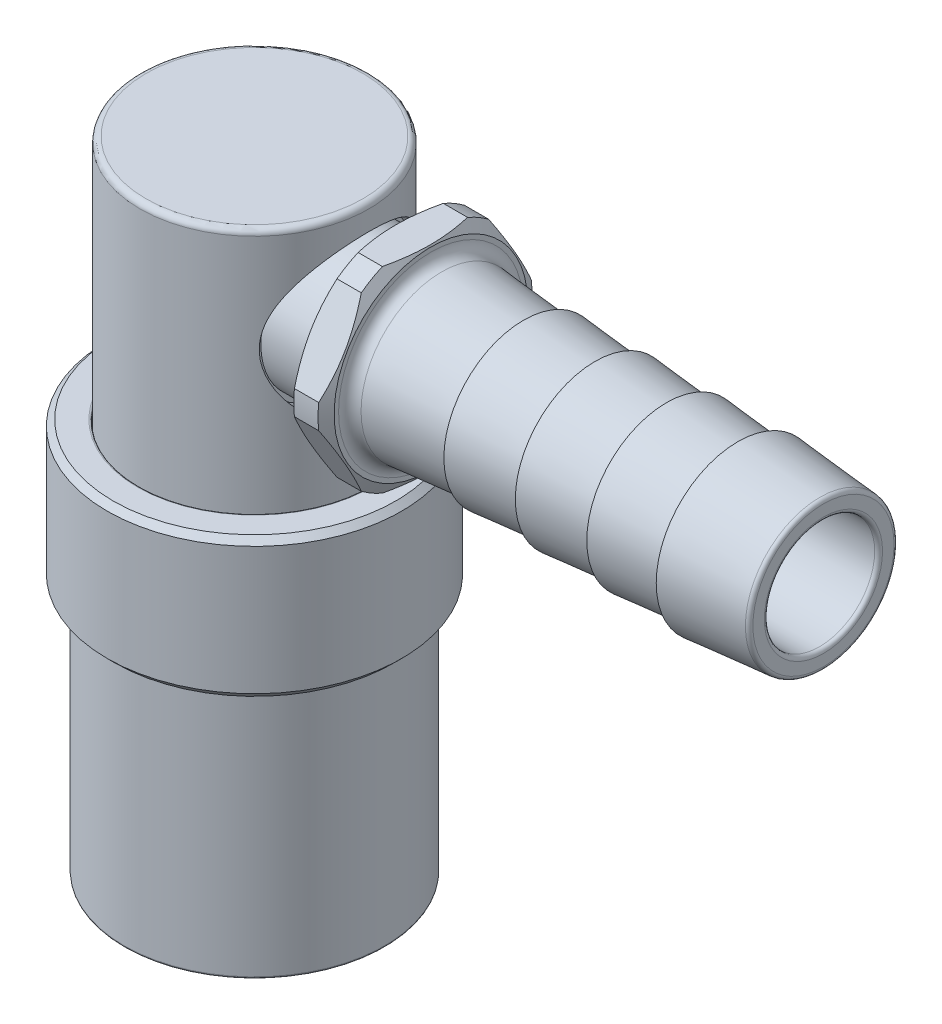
ISO-10303-21;
HEADER;
FILE_DESCRIPTION(('STEP AP214'),'2;1');
FILE_NAME('part.step','',(''),(''),'','','');
FILE_SCHEMA(('AUTOMOTIVE_DESIGN { 1 0 10303 214 1 1 1 1 }'));
ENDSEC;
DATA;
#1=APPLICATION_CONTEXT('core data for automotive mechanical design processes');
#2=APPLICATION_PROTOCOL_DEFINITION('international standard','automotive_design',2000,#1);
#3=PRODUCT_CONTEXT('',#1,'mechanical');
#4=PRODUCT('Part','Part','',(#3));
#5=PRODUCT_RELATED_PRODUCT_CATEGORY('part','',(#4));
#6=PRODUCT_DEFINITION_FORMATION('','',#4);
#7=PRODUCT_DEFINITION_CONTEXT('part definition',#1,'design');
#8=PRODUCT_DEFINITION('design','',#6,#7);
#9=PRODUCT_DEFINITION_SHAPE('','',#8);
#10=(LENGTH_UNIT() NAMED_UNIT(*) SI_UNIT(.MILLI.,.METRE.));
#11=(NAMED_UNIT(*) PLANE_ANGLE_UNIT() SI_UNIT($,.RADIAN.));
#12=(NAMED_UNIT(*) SI_UNIT($,.STERADIAN.) SOLID_ANGLE_UNIT());
#13=UNCERTAINTY_MEASURE_WITH_UNIT(LENGTH_MEASURE(1.E-05),#10,'distance_accuracy_value','');
#14=(GEOMETRIC_REPRESENTATION_CONTEXT(3) GLOBAL_UNCERTAINTY_ASSIGNED_CONTEXT((#13)) GLOBAL_UNIT_ASSIGNED_CONTEXT((#10,
#11,#12)) REPRESENTATION_CONTEXT('',''));
#15=CARTESIAN_POINT('',(0.,0.,0.));
#16=DIRECTION('',(0.,0.,1.));
#17=DIRECTION('',(1.,0.,0.));
#18=AXIS2_PLACEMENT_3D('',#15,#16,#17);
#19=CARTESIAN_POINT('',(2.142412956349,34.511179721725,0.));
#20=DIRECTION('',(-1.,0.,0.));
#21=DIRECTION('',(0.,0.,-1.));
#22=AXIS2_PLACEMENT_3D('',#19,#20,#21);
#23=TOROIDAL_SURFACE('',#22,3.8227,0.254);
#24=CARTESIAN_POINT('',(2.142412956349,34.511179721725,0.));
#25=DIRECTION('',(1.,0.,0.));
#26=DIRECTION('',(0.,0.,1.));
#27=AXIS2_PLACEMENT_3D('',#24,#25,#26);
#28=CIRCLE('',#27,3.5687);
#29=CARTESIAN_POINT('',(2.142412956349,34.511179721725,-3.5687));
#30=VERTEX_POINT('',#29);
#31=CARTESIAN_POINT('',(2.142412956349,34.511179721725,3.5687));
#32=VERTEX_POINT('',#31);
#33=EDGE_CURVE('P0_E11',#30,#32,#28,.T.);
#34=ORIENTED_EDGE('',*,*,#33,.T.);
#35=CARTESIAN_POINT('',(2.142412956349,34.511179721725,3.8227));
#36=DIRECTION('',(0.,1.,0.));
#37=DIRECTION('',(0.,0.,1.));
#38=AXIS2_PLACEMENT_3D('',#35,#36,#37);
#39=CIRCLE('',#38,0.254);
#40=CARTESIAN_POINT('',(1.888412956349,34.511179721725,3.8227));
#41=VERTEX_POINT('',#40);
#42=EDGE_CURVE('P0_E27',#32,#41,#39,.T.);
#43=ORIENTED_EDGE('',*,*,#42,.T.);
#44=CARTESIAN_POINT('',(1.888412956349,34.511179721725,0.));
#45=DIRECTION('',(-1.,0.,0.));
#46=DIRECTION('',(0.,0.,1.));
#47=AXIS2_PLACEMENT_3D('',#44,#45,#46);
#48=CIRCLE('',#47,3.8227);
#49=CARTESIAN_POINT('',(1.888412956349,34.511179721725,-3.8227));
#50=VERTEX_POINT('',#49);
#51=EDGE_CURVE('P0_E315',#41,#50,#48,.T.);
#52=ORIENTED_EDGE('',*,*,#51,.T.);
#53=CARTESIAN_POINT('',(1.888412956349,34.511179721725,0.));
#54=DIRECTION('',(-1.,0.,0.));
#55=DIRECTION('',(0.,0.,1.));
#56=AXIS2_PLACEMENT_3D('',#53,#54,#55);
#57=CIRCLE('',#56,3.8227);
#58=EDGE_CURVE('P0_E333',#50,#41,#57,.T.);
#59=ORIENTED_EDGE('',*,*,#58,.T.);
#60=ORIENTED_EDGE('',*,*,#42,.F.);
#61=CARTESIAN_POINT('',(2.142412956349,34.511179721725,0.));
#62=DIRECTION('',(1.,0.,0.));
#63=DIRECTION('',(0.,0.,1.));
#64=AXIS2_PLACEMENT_3D('',#61,#62,#63);
#65=CIRCLE('',#64,3.5687);
#66=EDGE_CURVE('P0_E41',#32,#30,#65,.T.);
#67=ORIENTED_EDGE('',*,*,#66,.T.);
#68=EDGE_LOOP('',(#34,#43,#52,#59,#60,#67));
#69=FACE_BOUND('',#68,.T.);
#70=ADVANCED_FACE('P0_F16',(#69),#23,.T.);
#71=CARTESIAN_POINT('',(19.350912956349,34.5111797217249,0.));
#72=DIRECTION('',(-1.,0.,0.));
#73=DIRECTION('',(0.,0.,-1.));
#74=AXIS2_PLACEMENT_3D('',#71,#72,#73);
#75=CYLINDRICAL_SURFACE('',#74,3.5687);
#76=ORIENTED_EDGE('',*,*,#33,.F.);
#77=ORIENTED_EDGE('',*,*,#66,.F.);
#78=DIRECTION('',(1.,0.,0.));
#79=VECTOR('',#78,1.);
#80=CARTESIAN_POINT('',(19.350912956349,34.5111797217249,3.5687));
#81=LINE('',#80,#79);
#82=CARTESIAN_POINT('',(36.559412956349,34.5111797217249,3.5687));
#83=VERTEX_POINT('',#82);
#84=EDGE_CURVE('P0_E334',#32,#83,#81,.T.);
#85=ORIENTED_EDGE('',*,*,#84,.T.);
#86=CARTESIAN_POINT('',(36.559412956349,34.5111797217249,0.));
#87=DIRECTION('',(-1.,0.,0.));
#88=DIRECTION('',(0.,0.,1.));
#89=AXIS2_PLACEMENT_3D('',#86,#87,#88);
#90=CIRCLE('',#89,3.5687);
#91=CARTESIAN_POINT('',(36.559412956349,34.5111797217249,-3.5687));
#92=VERTEX_POINT('',#91);
#93=EDGE_CURVE('P0_E421',#92,#83,#90,.T.);
#94=ORIENTED_EDGE('',*,*,#93,.F.);
#95=CARTESIAN_POINT('',(36.559412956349,34.5111797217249,0.));
#96=DIRECTION('',(-1.,0.,0.));
#97=DIRECTION('',(0.,0.,1.));
#98=AXIS2_PLACEMENT_3D('',#95,#96,#97);
#99=CIRCLE('',#98,3.5687);
#100=EDGE_CURVE('P0_E416',#83,#92,#99,.T.);
#101=ORIENTED_EDGE('',*,*,#100,.F.);
#102=ORIENTED_EDGE('',*,*,#84,.F.);
#103=EDGE_LOOP('',(#76,#77,#85,#94,#101,#102));
#104=FACE_BOUND('',#103,.T.);
#105=ADVANCED_FACE('P0_F775',(#104),#75,.F.);
#106=CARTESIAN_POINT('',(1.888412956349,34.511179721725,-3.5687));
#107=DIRECTION('',(-1.,0.,0.));
#108=DIRECTION('',(0.,0.,-1.));
#109=AXIS2_PLACEMENT_3D('',#106,#107,#108);
#110=PLANE('',#109);
#111=CARTESIAN_POINT('',(1.888412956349,34.511179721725,0.));
#112=DIRECTION('',(1.,0.,0.));
#113=DIRECTION('',(0.,0.,1.));
#114=AXIS2_PLACEMENT_3D('',#111,#112,#113);
#115=CIRCLE('',#114,3.937);
#116=CARTESIAN_POINT('',(1.888412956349,34.511179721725,-3.937));
#117=VERTEX_POINT('',#116);
#118=EDGE_CURVE('P0_E543',#117,#117,#115,.T.);
#119=ORIENTED_EDGE('',*,*,#118,.F.);
#120=EDGE_LOOP('',(#119));
#121=FACE_BOUND('',#120,.T.);
#122=ORIENTED_EDGE('',*,*,#58,.F.);
#123=ORIENTED_EDGE('',*,*,#51,.F.);
#124=EDGE_LOOP('',(#122,#123));
#125=FACE_BOUND('',#124,.T.);
#126=ADVANCED_FACE('P0_F781',(#121,#125),#110,.T.);
#127=CARTESIAN_POINT('',(36.559412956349,34.5111797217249,0.));
#128=DIRECTION('',(-1.,0.,0.));
#129=DIRECTION('',(0.,0.,-1.));
#130=AXIS2_PLACEMENT_3D('',#127,#128,#129);
#131=TOROIDAL_SURFACE('',#130,4.56600965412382,0.254);
#132=CARTESIAN_POINT('',(36.581550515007,34.5111797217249,0.));
#133=DIRECTION('',(1.,0.,0.));
#134=DIRECTION('',(0.,0.,1.));
#135=AXIS2_PLACEMENT_3D('',#132,#133,#134);
#136=CIRCLE('',#135,4.81904310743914);
#137=CARTESIAN_POINT('',(36.581550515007,34.5111797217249,-4.81904310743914));
#138=VERTEX_POINT('',#137);
#139=CARTESIAN_POINT('',(36.581550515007,34.5111797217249,4.81904310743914));
#140=VERTEX_POINT('',#139);
#141=EDGE_CURVE('P0_E457',#138,#140,#136,.T.);
#142=ORIENTED_EDGE('',*,*,#141,.T.);
#143=CARTESIAN_POINT('',(36.559412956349,34.5111797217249,4.56600965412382));
#144=DIRECTION('',(0.,1.,0.));
#145=DIRECTION('',(0.,0.,1.));
#146=AXIS2_PLACEMENT_3D('',#143,#144,#145);
#147=CIRCLE('',#146,0.254);
#148=CARTESIAN_POINT('',(36.813412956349,34.5111797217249,4.56600965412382));
#149=VERTEX_POINT('',#148);
#150=EDGE_CURVE('P0_E453',#140,#149,#147,.T.);
#151=ORIENTED_EDGE('',*,*,#150,.T.);
#152=CARTESIAN_POINT('',(36.813412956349,34.5111797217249,0.));
#153=DIRECTION('',(-1.,0.,0.));
#154=DIRECTION('',(0.,0.,1.));
#155=AXIS2_PLACEMENT_3D('',#152,#153,#154);
#156=CIRCLE('',#155,4.56600965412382);
#157=CARTESIAN_POINT('',(36.813412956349,34.5111797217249,-4.56600965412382));
#158=VERTEX_POINT('',#157);
#159=EDGE_CURVE('P0_E448',#149,#158,#156,.T.);
#160=ORIENTED_EDGE('',*,*,#159,.T.);
#161=CARTESIAN_POINT('',(36.813412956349,34.5111797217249,0.));
#162=DIRECTION('',(-1.,0.,0.));
#163=DIRECTION('',(0.,0.,1.));
#164=AXIS2_PLACEMENT_3D('',#161,#162,#163);
#165=CIRCLE('',#164,4.56600965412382);
#166=EDGE_CURVE('P0_E444',#158,#149,#165,.T.);
#167=ORIENTED_EDGE('',*,*,#166,.T.);
#168=ORIENTED_EDGE('',*,*,#150,.F.);
#169=CARTESIAN_POINT('',(36.581550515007,34.5111797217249,0.));
#170=DIRECTION('',(1.,0.,0.));
#171=DIRECTION('',(0.,0.,1.));
#172=AXIS2_PLACEMENT_3D('',#169,#170,#171);
#173=CIRCLE('',#172,4.81904310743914);
#174=EDGE_CURVE('P0_E449',#140,#138,#173,.T.);
#175=ORIENTED_EDGE('',*,*,#174,.T.);
#176=EDGE_LOOP('',(#142,#151,#160,#167,#168,#175));
#177=FACE_BOUND('',#176,.T.);
#178=ADVANCED_FACE('P0_F809',(#177),#131,.T.);
#179=CARTESIAN_POINT('',(36.813412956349,34.5111797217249,-4.79875777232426));
#180=DIRECTION('',(1.,0.,0.));
#181=DIRECTION('',(0.,-1.,0.));
#182=AXIS2_PLACEMENT_3D('',#179,#180,#181);
#183=PLANE('',#182);
#184=ORIENTED_EDGE('',*,*,#166,.F.);
#185=ORIENTED_EDGE('',*,*,#159,.F.);
#186=EDGE_LOOP('',(#184,#185));
#187=FACE_BOUND('',#186,.T.);
#188=CARTESIAN_POINT('',(36.813412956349,34.5111797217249,0.));
#189=DIRECTION('',(1.,0.,0.));
#190=DIRECTION('',(0.,0.,1.));
#191=AXIS2_PLACEMENT_3D('',#188,#189,#190);
#192=CIRCLE('',#191,3.8227);
#193=CARTESIAN_POINT('',(36.813412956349,34.5111797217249,-3.8227));
#194=VERTEX_POINT('',#193);
#195=CARTESIAN_POINT('',(36.813412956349,34.5111797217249,3.8227));
#196=VERTEX_POINT('',#195);
#197=EDGE_CURVE('P0_E579',#194,#196,#192,.T.);
#198=ORIENTED_EDGE('',*,*,#197,.F.);
#199=CARTESIAN_POINT('',(36.813412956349,34.5111797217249,0.));
#200=DIRECTION('',(1.,0.,0.));
#201=DIRECTION('',(0.,0.,1.));
#202=AXIS2_PLACEMENT_3D('',#199,#200,#201);
#203=CIRCLE('',#202,3.8227);
#204=EDGE_CURVE('P0_E547',#196,#194,#203,.T.);
#205=ORIENTED_EDGE('',*,*,#204,.F.);
#206=EDGE_LOOP('',(#198,#205));
#207=FACE_BOUND('',#206,.T.);
#208=ADVANCED_FACE('P0_F812',(#187,#207),#183,.T.);
#209=CARTESIAN_POINT('',(34.044812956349,34.5111797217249,0.));
#210=DIRECTION('',(-1.,0.,0.));
#211=DIRECTION('',(0.,0.,-1.));
#212=AXIS2_PLACEMENT_3D('',#209,#210,#211);
#213=CONICAL_SURFACE('',#212,5.04097888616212,0.0872664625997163);
#214=CARTESIAN_POINT('',(31.276212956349,34.5111797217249,0.));
#215=DIRECTION('',(-1.,0.,0.));
#216=DIRECTION('',(0.,-1.,0.));
#217=AXIS2_PLACEMENT_3D('',#214,#215,#216);
#218=CIRCLE('',#217,5.2832);
#219=CARTESIAN_POINT('',(31.276212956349,34.5111797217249,-5.2832));
#220=VERTEX_POINT('',#219);
#221=CARTESIAN_POINT('',(31.276212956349,34.5111797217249,5.2832));
#222=VERTEX_POINT('',#221);
#223=EDGE_CURVE('P0_E277',#220,#222,#218,.T.);
#224=ORIENTED_EDGE('',*,*,#223,.F.);
#225=CARTESIAN_POINT('',(31.276212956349,34.5111797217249,0.));
#226=DIRECTION('',(-1.,0.,0.));
#227=DIRECTION('',(0.,-1.,0.));
#228=AXIS2_PLACEMENT_3D('',#225,#226,#227);
#229=CIRCLE('',#228,5.2832);
#230=EDGE_CURVE('P0_E497',#222,#220,#229,.T.);
#231=ORIENTED_EDGE('',*,*,#230,.F.);
#232=DIRECTION('',(0.996194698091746,0.,-0.0871557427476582));
#233=VECTOR('',#232,1.);
#234=CARTESIAN_POINT('',(34.044812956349,34.5111797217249,5.04097888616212));
#235=LINE('',#234,#233);
#236=EDGE_CURVE('P0_E575',#222,#140,#235,.T.);
#237=ORIENTED_EDGE('',*,*,#236,.T.);
#238=ORIENTED_EDGE('',*,*,#141,.F.);
#239=ORIENTED_EDGE('',*,*,#174,.F.);
#240=ORIENTED_EDGE('',*,*,#236,.F.);
#241=EDGE_LOOP('',(#224,#231,#237,#238,#239,#240));
#242=FACE_BOUND('',#241,.T.);
#243=ADVANCED_FACE('P0_F816',(#242),#213,.T.);
#244=CARTESIAN_POINT('',(36.559412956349,34.5111797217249,0.));
#245=DIRECTION('',(-1.,0.,0.));
#246=DIRECTION('',(0.,0.,-1.));
#247=AXIS2_PLACEMENT_3D('',#244,#245,#246);
#248=TOROIDAL_SURFACE('',#247,3.8227,0.254);
#249=ORIENTED_EDGE('',*,*,#197,.T.);
#250=CARTESIAN_POINT('',(36.559412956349,34.5111797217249,3.8227));
#251=DIRECTION('',(0.,1.,0.));
#252=DIRECTION('',(0.,0.,1.));
#253=AXIS2_PLACEMENT_3D('',#250,#251,#252);
#254=CIRCLE('',#253,0.254);
#255=EDGE_CURVE('P0_E420',#196,#83,#254,.T.);
#256=ORIENTED_EDGE('',*,*,#255,.T.);
#257=ORIENTED_EDGE('',*,*,#100,.T.);
#258=ORIENTED_EDGE('',*,*,#93,.T.);
#259=ORIENTED_EDGE('',*,*,#255,.F.);
#260=ORIENTED_EDGE('',*,*,#204,.T.);
#261=EDGE_LOOP('',(#249,#256,#257,#258,#259,#260));
#262=FACE_BOUND('',#261,.T.);
#263=ADVANCED_FACE('P0_F770',(#262),#248,.T.);
#264=CARTESIAN_POINT('',(12.175412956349,34.511179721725,0.));
#265=DIRECTION('',(-1.,0.,0.));
#266=DIRECTION('',(0.,0.,-1.));
#267=AXIS2_PLACEMENT_3D('',#264,#265,#266);
#268=TOROIDAL_SURFACE('',#267,5.97248639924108,0.762);
#269=CARTESIAN_POINT('',(12.1090002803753,34.511179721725,0.));
#270=DIRECTION('',(-1.,0.,0.));
#271=DIRECTION('',(0.,0.,1.));
#272=AXIS2_PLACEMENT_3D('',#269,#270,#271);
#273=CIRCLE('',#272,5.21338603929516);
#274=CARTESIAN_POINT('',(12.1090002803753,34.511179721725,-5.21338603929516));
#275=VERTEX_POINT('',#274);
#276=CARTESIAN_POINT('',(12.1090002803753,34.511179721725,5.21338603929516));
#277=VERTEX_POINT('',#276);
#278=EDGE_CURVE('P0_E342',#275,#277,#273,.T.);
#279=ORIENTED_EDGE('',*,*,#278,.T.);
#280=CARTESIAN_POINT('',(12.175412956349,34.511179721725,5.97248639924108));
#281=DIRECTION('',(0.,1.,0.));
#282=DIRECTION('',(0.,0.,1.));
#283=AXIS2_PLACEMENT_3D('',#280,#281,#282);
#284=CIRCLE('',#283,0.762);
#285=CARTESIAN_POINT('',(11.413412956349,34.511179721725,5.97248639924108));
#286=VERTEX_POINT('',#285);
#287=EDGE_CURVE('P0_E338',#277,#286,#284,.T.);
#288=ORIENTED_EDGE('',*,*,#287,.T.);
#289=CARTESIAN_POINT('',(11.413412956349,34.511179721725,0.));
#290=DIRECTION('',(1.,0.,0.));
#291=DIRECTION('',(0.,0.,1.));
#292=AXIS2_PLACEMENT_3D('',#289,#290,#291);
#293=CIRCLE('',#292,5.97248639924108);
#294=CARTESIAN_POINT('',(11.413412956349,34.511179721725,-5.97248639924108));
#295=VERTEX_POINT('',#294);
#296=EDGE_CURVE('P0_E343',#286,#295,#293,.T.);
#297=ORIENTED_EDGE('',*,*,#296,.T.);
#298=CARTESIAN_POINT('',(11.413412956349,34.511179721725,0.));
#299=DIRECTION('',(1.,0.,0.));
#300=DIRECTION('',(0.,0.,1.));
#301=AXIS2_PLACEMENT_3D('',#298,#299,#300);
#302=CIRCLE('',#301,5.97248639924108);
#303=EDGE_CURVE('P0_E508',#295,#286,#302,.T.);
#304=ORIENTED_EDGE('',*,*,#303,.T.);
#305=ORIENTED_EDGE('',*,*,#287,.F.);
#306=CARTESIAN_POINT('',(12.1090002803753,34.511179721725,0.));
#307=DIRECTION('',(-1.,0.,0.));
#308=DIRECTION('',(0.,0.,1.));
#309=AXIS2_PLACEMENT_3D('',#306,#307,#308);
#310=CIRCLE('',#309,5.21338603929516);
#311=EDGE_CURVE('P0_E504',#277,#275,#310,.T.);
#312=ORIENTED_EDGE('',*,*,#311,.T.);
#313=EDGE_LOOP('',(#279,#288,#297,#304,#305,#312));
#314=FACE_BOUND('',#313,.T.);
#315=ADVANCED_FACE('P0_F757',(#314),#268,.F.);
#316=CARTESIAN_POINT('',(11.413412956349,34.511179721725,-6.9215));
#317=DIRECTION('',(1.,0.,0.));
#318=DIRECTION('',(0.,-1.,0.));
#319=AXIS2_PLACEMENT_3D('',#316,#317,#318);
#320=PLANE('',#319);
#321=CARTESIAN_POINT('',(11.413412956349,34.511179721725,0.));
#322=DIRECTION('',(-1.,0.,0.));
#323=DIRECTION('',(0.,0.,1.));
#324=AXIS2_PLACEMENT_3D('',#321,#322,#323);
#325=CIRCLE('',#324,6.26158864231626);
#326=CARTESIAN_POINT('',(11.413412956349,34.511179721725,-6.26158864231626));
#327=VERTEX_POINT('',#326);
#328=EDGE_CURVE('P0_E539',#327,#327,#325,.T.);
#329=ORIENTED_EDGE('',*,*,#328,.F.);
#330=EDGE_LOOP('',(#329));
#331=FACE_BOUND('',#330,.T.);
#332=ORIENTED_EDGE('',*,*,#303,.F.);
#333=ORIENTED_EDGE('',*,*,#296,.F.);
#334=EDGE_LOOP('',(#332,#333));
#335=FACE_BOUND('',#334,.T.);
#336=ADVANCED_FACE('P0_F760',(#331,#335),#320,.T.);
#337=CARTESIAN_POINT('',(14.410612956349,34.5111797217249,0.));
#338=DIRECTION('',(-1.,0.,0.));
#339=DIRECTION('',(0.,0.,-1.));
#340=AXIS2_PLACEMENT_3D('',#337,#338,#339);
#341=CONICAL_SURFACE('',#340,5.0120210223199,0.0872664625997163);
#342=ORIENTED_EDGE('',*,*,#278,.F.);
#343=ORIENTED_EDGE('',*,*,#311,.F.);
#344=DIRECTION('',(0.996194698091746,0.,-0.087155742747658));
#345=VECTOR('',#344,1.);
#346=CARTESIAN_POINT('',(14.410612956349,34.5111797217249,5.0120210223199));
#347=LINE('',#346,#345);
#348=CARTESIAN_POINT('',(17.407812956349,34.5111797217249,4.7498));
#349=VERTEX_POINT('',#348);
#350=EDGE_CURVE('P0_E452',#277,#349,#347,.T.);
#351=ORIENTED_EDGE('',*,*,#350,.T.);
#352=CARTESIAN_POINT('',(17.407812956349,34.5111797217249,0.));
#353=DIRECTION('',(-1.,0.,0.));
#354=DIRECTION('',(0.,-1.,0.));
#355=AXIS2_PLACEMENT_3D('',#352,#353,#354);
#356=CIRCLE('',#355,4.7498);
#357=CARTESIAN_POINT('',(17.407812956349,34.5111797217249,-4.7498));
#358=VERTEX_POINT('',#357);
#359=EDGE_CURVE('P0_E348',#349,#358,#356,.T.);
#360=ORIENTED_EDGE('',*,*,#359,.T.);
#361=CARTESIAN_POINT('',(17.407812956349,34.5111797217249,0.));
#362=DIRECTION('',(-1.,0.,0.));
#363=DIRECTION('',(0.,-1.,0.));
#364=AXIS2_PLACEMENT_3D('',#361,#362,#363);
#365=CIRCLE('',#364,4.7498);
#366=EDGE_CURVE('P0_E344',#358,#349,#365,.T.);
#367=ORIENTED_EDGE('',*,*,#366,.T.);
#368=ORIENTED_EDGE('',*,*,#350,.F.);
#369=EDGE_LOOP('',(#342,#343,#351,#360,#367,#368));
#370=FACE_BOUND('',#369,.T.);
#371=ADVANCED_FACE('P0_F754',(#370),#341,.T.);
#372=CARTESIAN_POINT('',(8.111412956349,34.511179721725,0.));
#373=DIRECTION('',(-1.,0.,0.));
#374=DIRECTION('',(0.,0.,-1.));
#375=AXIS2_PLACEMENT_3D('',#372,#373,#374);
#376=TOROIDAL_SURFACE('',#375,5.46862,0.762);
#377=CARTESIAN_POINT('',(8.873412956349,34.511179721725,0.));
#378=DIRECTION('',(-1.,0.,0.));
#379=DIRECTION('',(0.,0.,-1.));
#380=AXIS2_PLACEMENT_3D('',#377,#378,#379);
#381=CIRCLE('',#380,5.46862);
#382=CARTESIAN_POINT('',(8.873412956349,34.511179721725,5.46862));
#383=VERTEX_POINT('',#382);
#384=EDGE_CURVE('P0_E320',#383,#383,#381,.T.);
#385=ORIENTED_EDGE('',*,*,#384,.T.);
#386=CARTESIAN_POINT('',(8.111412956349,34.511179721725,5.46862));
#387=DIRECTION('',(0.,1.,0.));
#388=DIRECTION('',(0.,0.,1.));
#389=AXIS2_PLACEMENT_3D('',#386,#387,#388);
#390=CIRCLE('',#389,0.762);
#391=CARTESIAN_POINT('',(8.111412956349,34.511179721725,4.70662));
#392=VERTEX_POINT('',#391);
#393=EDGE_CURVE('P0_E316',#383,#392,#390,.T.);
#394=ORIENTED_EDGE('',*,*,#393,.T.);
#395=CARTESIAN_POINT('',(8.111412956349,34.511179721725,0.));
#396=DIRECTION('',(1.,0.,0.));
#397=DIRECTION('',(0.,0.,-1.));
#398=AXIS2_PLACEMENT_3D('',#395,#396,#397);
#399=CIRCLE('',#398,4.70662);
#400=EDGE_CURVE('P0_E321',#392,#392,#399,.T.);
#401=ORIENTED_EDGE('',*,*,#400,.T.);
#402=ORIENTED_EDGE('',*,*,#393,.F.);
#403=EDGE_LOOP('',(#385,#394,#401,#402));
#404=FACE_BOUND('',#403,.T.);
#405=ADVANCED_FACE('P0_F720',(#404),#376,.F.);
#406=CARTESIAN_POINT('',(5.380912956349,34.511179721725,0.));
#407=DIRECTION('',(-1.,0.,0.));
#408=DIRECTION('',(0.,0.,-1.));
#409=AXIS2_PLACEMENT_3D('',#406,#407,#408);
#410=CYLINDRICAL_SURFACE('',#409,4.70662);
#411=CARTESIAN_POINT('',(2.658032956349,34.511179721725,0.));
#412=DIRECTION('',(-1.,0.,0.));
#413=DIRECTION('',(0.,0.,-1.));
#414=AXIS2_PLACEMENT_3D('',#411,#412,#413);
#415=CIRCLE('',#414,4.70662);
#416=CARTESIAN_POINT('',(2.658032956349,34.511179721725,4.70662));
#417=VERTEX_POINT('',#416);
#418=CARTESIAN_POINT('',(2.658032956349,34.511179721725,-4.70662));
#419=VERTEX_POINT('',#418);
#420=EDGE_CURVE('P0_E373',#417,#419,#415,.T.);
#421=ORIENTED_EDGE('',*,*,#420,.F.);
#422=DIRECTION('',(1.,0.,0.));
#423=VECTOR('',#422,1.);
#424=CARTESIAN_POINT('',(5.380912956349,34.511179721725,4.70662));
#425=LINE('',#424,#423);
#426=EDGE_CURVE('P0_E468',#417,#392,#425,.T.);
#427=ORIENTED_EDGE('',*,*,#426,.T.);
#428=ORIENTED_EDGE('',*,*,#400,.F.);
#429=ORIENTED_EDGE('',*,*,#426,.F.);
#430=CARTESIAN_POINT('',(2.658032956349,34.511179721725,0.));
#431=DIRECTION('',(-1.,0.,0.));
#432=DIRECTION('',(0.,0.,-1.));
#433=AXIS2_PLACEMENT_3D('',#430,#431,#432);
#434=CIRCLE('',#433,4.70662);
#435=EDGE_CURVE('P0_E376',#419,#417,#434,.T.);
#436=ORIENTED_EDGE('',*,*,#435,.F.);
#437=EDGE_LOOP('',(#421,#427,#428,#429,#436));
#438=FACE_BOUND('',#437,.T.);
#439=ADVANCED_FACE('P0_F716',(#438),#410,.T.);
#440=CARTESIAN_POINT('',(8.873412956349,34.511179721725,-4.699));
#441=DIRECTION('',(-1.,0.,0.));
#442=DIRECTION('',(0.,0.,-1.));
#443=AXIS2_PLACEMENT_3D('',#440,#441,#442);
#444=PLANE('',#443);
#445=CARTESIAN_POINT('',(8.873412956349,34.511179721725,0.));
#446=DIRECTION('',(1.,0.,0.));
#447=DIRECTION('',(0.,0.,1.));
#448=AXIS2_PLACEMENT_3D('',#445,#446,#447);
#449=CIRCLE('',#448,5.9055);
#450=CARTESIAN_POINT('',(8.873412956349,34.511179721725,-5.9055));
#451=VERTEX_POINT('',#450);
#452=EDGE_CURVE('P0_E377',#451,#451,#449,.T.);
#453=ORIENTED_EDGE('',*,*,#452,.F.);
#454=EDGE_LOOP('',(#453));
#455=FACE_BOUND('',#454,.T.);
#456=ORIENTED_EDGE('',*,*,#384,.F.);
#457=EDGE_LOOP('',(#456));
#458=FACE_BOUND('',#457,.T.);
#459=ADVANCED_FACE('P0_F712',(#455,#458),#444,.T.);
#460=CARTESIAN_POINT('',(2.269412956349,34.511179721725,0.));
#461=DIRECTION('',(1.,0.,0.));
#462=DIRECTION('',(0.,0.,1.));
#463=AXIS2_PLACEMENT_3D('',#460,#461,#462);
#464=CONICAL_SURFACE('',#463,4.318,0.785398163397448);
#465=ORIENTED_EDGE('',*,*,#118,.T.);
#466=DIRECTION('',(0.707106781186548,0.,-0.707106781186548));
#467=VECTOR('',#466,1.);
#468=CARTESIAN_POINT('',(2.269412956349,34.511179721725,-4.318));
#469=LINE('',#468,#467);
#470=EDGE_CURVE('P0_E461',#117,#419,#469,.T.);
#471=ORIENTED_EDGE('',*,*,#470,.T.);
#472=ORIENTED_EDGE('',*,*,#435,.T.);
#473=ORIENTED_EDGE('',*,*,#420,.T.);
#474=ORIENTED_EDGE('',*,*,#470,.F.);
#475=EDGE_LOOP('',(#465,#471,#472,#473,#474));
#476=FACE_BOUND('',#475,.T.);
#477=ADVANCED_FACE('P0_F715',(#476),#464,.T.);
#478=CARTESIAN_POINT('',(1.888412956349,34.511179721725,-7.33234841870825));
#479=DIRECTION('',(0.,0.5,0.866025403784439));
#480=DIRECTION('',(1.,0.,0.));
#481=AXIS2_PLACEMENT_3D('',#478,#479,#480);
#482=PLANE('',#481);
#483=CARTESIAN_POINT('',(11.032412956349,28.9511227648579,-4.12224803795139));
#484=CARTESIAN_POINT('',(11.6650802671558,31.336179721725,-5.49926131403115));
#485=CARTESIAN_POINT('',(11.032412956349,33.721236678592,-6.87627459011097));
#486=(BOUNDED_CURVE() B_SPLINE_CURVE(2,(#483,#484,#485),.UNSPECIFIED.,.F.,
.F.) B_SPLINE_CURVE_WITH_KNOTS((3,3),(0.,0.554744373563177),
.UNSPECIFIED.) CURVE() GEOMETRIC_REPRESENTATION_ITEM() RATIONAL_B_SPLINE_CURVE((1.,1.09,1.)) REPRESENTATION_ITEM(''));
#487=CARTESIAN_POINT('',(11.032412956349,28.9511227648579,-4.12224803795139));
#488=VERTEX_POINT('',#487);
#489=CARTESIAN_POINT('',(11.032412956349,33.721236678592,-6.87627459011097));
#490=VERTEX_POINT('',#489);
#491=EDGE_CURVE('P0_E358',#488,#490,#486,.T.);
#492=ORIENTED_EDGE('',*,*,#491,.F.);
#493=DIRECTION('',(1.,0.,0.));
#494=VECTOR('',#493,1.);
#495=CARTESIAN_POINT('',(10.143412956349,28.9511227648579,-4.12224803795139));
#496=LINE('',#495,#494);
#497=CARTESIAN_POINT('',(9.46000082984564,28.9511227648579,-4.12224803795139));
#498=VERTEX_POINT('',#497);
#499=EDGE_CURVE('P0_E295',#498,#488,#496,.T.);
#500=ORIENTED_EDGE('',*,*,#499,.F.);
#501=CARTESIAN_POINT('',(9.46000082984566,33.721236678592,-6.87627459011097));
#502=CARTESIAN_POINT('',(8.82733351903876,31.336179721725,-5.49926131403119));
#503=CARTESIAN_POINT('',(9.46000082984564,28.9511227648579,-4.12224803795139));
#504=(BOUNDED_CURVE() B_SPLINE_CURVE(2,(#501,#502,#503),.UNSPECIFIED.,.F.,
.F.) B_SPLINE_CURVE_WITH_KNOTS((3,3),(0.,0.554744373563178),
.UNSPECIFIED.) CURVE() GEOMETRIC_REPRESENTATION_ITEM() RATIONAL_B_SPLINE_CURVE((1.,1.09,1.)) REPRESENTATION_ITEM(''));
#505=CARTESIAN_POINT('',(9.46000082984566,33.721236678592,-6.87627459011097));
#506=VERTEX_POINT('',#505);
#507=EDGE_CURVE('P0_E534',#506,#498,#504,.T.);
#508=ORIENTED_EDGE('',*,*,#507,.F.);
#509=DIRECTION('',(-1.,0.,0.));
#510=VECTOR('',#509,1.);
#511=CARTESIAN_POINT('',(10.143412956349,33.721236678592,-6.87627459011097));
#512=LINE('',#511,#510);
#513=EDGE_CURVE('P0_E276',#490,#506,#512,.T.);
#514=ORIENTED_EDGE('',*,*,#513,.F.);
#515=EDGE_LOOP('',(#492,#500,#508,#514));
#516=FACE_BOUND('',#515,.T.);
#517=ADVANCED_FACE('P0_F832',(#516),#482,.F.);
#518=CARTESIAN_POINT('',(1.88841295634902,40.861179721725,-3.66617420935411));
#519=DIRECTION('',(0.,-0.5,0.866025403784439));
#520=DIRECTION('',(-1.,0.,0.));
#521=AXIS2_PLACEMENT_3D('',#518,#519,#520);
#522=PLANE('',#521);
#523=CARTESIAN_POINT('',(11.032412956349,35.3011227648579,-6.87627459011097));
#524=CARTESIAN_POINT('',(11.6650802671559,37.686179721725,-5.49926131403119));
#525=CARTESIAN_POINT('',(11.032412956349,40.071236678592,-4.12224803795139));
#526=(BOUNDED_CURVE() B_SPLINE_CURVE(2,(#523,#524,#525),.UNSPECIFIED.,.F.,
.F.) B_SPLINE_CURVE_WITH_KNOTS((3,3),(0.,0.554744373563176),
.UNSPECIFIED.) CURVE() GEOMETRIC_REPRESENTATION_ITEM() RATIONAL_B_SPLINE_CURVE((1.,1.09,1.)) REPRESENTATION_ITEM(''));
#527=CARTESIAN_POINT('',(11.032412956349,35.3011227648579,-6.87627459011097));
#528=VERTEX_POINT('',#527);
#529=CARTESIAN_POINT('',(11.032412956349,40.071236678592,-4.12224803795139));
#530=VERTEX_POINT('',#529);
#531=EDGE_CURVE('P0_E270',#528,#530,#526,.T.);
#532=ORIENTED_EDGE('',*,*,#531,.F.);
#533=DIRECTION('',(1.,0.,0.));
#534=VECTOR('',#533,1.);
#535=CARTESIAN_POINT('',(10.143412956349,35.3011227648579,-6.87627459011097));
#536=LINE('',#535,#534);
#537=CARTESIAN_POINT('',(9.46000082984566,35.3011227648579,-6.87627459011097));
#538=VERTEX_POINT('',#537);
#539=EDGE_CURVE('P0_E264',#538,#528,#536,.T.);
#540=ORIENTED_EDGE('',*,*,#539,.F.);
#541=CARTESIAN_POINT('',(9.46000082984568,40.071236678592,-4.12224803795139));
#542=CARTESIAN_POINT('',(8.82733351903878,37.686179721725,-5.49926131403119));
#543=CARTESIAN_POINT('',(9.46000082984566,35.3011227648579,-6.87627459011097));
#544=(BOUNDED_CURVE() B_SPLINE_CURVE(2,(#541,#542,#543),.UNSPECIFIED.,.F.,
.F.) B_SPLINE_CURVE_WITH_KNOTS((3,3),(0.,0.554744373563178),
.UNSPECIFIED.) CURVE() GEOMETRIC_REPRESENTATION_ITEM() RATIONAL_B_SPLINE_CURVE((1.,1.09,1.)) REPRESENTATION_ITEM(''));
#545=CARTESIAN_POINT('',(9.46000082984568,40.071236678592,-4.12224803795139));
#546=VERTEX_POINT('',#545);
#547=EDGE_CURVE('P0_E268',#546,#538,#544,.T.);
#548=ORIENTED_EDGE('',*,*,#547,.F.);
#549=DIRECTION('',(-1.,0.,0.));
#550=VECTOR('',#549,1.);
#551=CARTESIAN_POINT('',(10.143412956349,40.071236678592,-4.12224803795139));
#552=LINE('',#551,#550);
#553=EDGE_CURVE('P0_E311',#530,#546,#552,.T.);
#554=ORIENTED_EDGE('',*,*,#553,.F.);
#555=EDGE_LOOP('',(#532,#540,#548,#554));
#556=FACE_BOUND('',#555,.T.);
#557=ADVANCED_FACE('P0_F266',(#556),#522,.F.);
#558=CARTESIAN_POINT('',(1.88841295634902,40.861179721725,3.66617420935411));
#559=DIRECTION('',(0.,-1.,0.));
#560=DIRECTION('',(1.,0.,0.));
#561=AXIS2_PLACEMENT_3D('',#558,#559,#560);
#562=PLANE('',#561);
#563=CARTESIAN_POINT('',(11.032412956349,40.861179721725,-2.75402655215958));
#564=CARTESIAN_POINT('',(11.6650802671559,40.861179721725,0.));
#565=CARTESIAN_POINT('',(11.032412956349,40.861179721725,2.75402655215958));
#566=(BOUNDED_CURVE() B_SPLINE_CURVE(2,(#563,#564,#565),.UNSPECIFIED.,.F.,
.F.) B_SPLINE_CURVE_WITH_KNOTS((3,3),(0.,0.554744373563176),
.UNSPECIFIED.) CURVE() GEOMETRIC_REPRESENTATION_ITEM() RATIONAL_B_SPLINE_CURVE((1.,1.09,1.)) REPRESENTATION_ITEM(''));
#567=CARTESIAN_POINT('',(11.032412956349,40.861179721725,-2.75402655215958));
#568=VERTEX_POINT('',#567);
#569=CARTESIAN_POINT('',(11.032412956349,40.861179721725,2.75402655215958));
#570=VERTEX_POINT('',#569);
#571=EDGE_CURVE('P0_E362',#568,#570,#566,.T.);
#572=ORIENTED_EDGE('',*,*,#571,.F.);
#573=DIRECTION('',(1.,0.,0.));
#574=VECTOR('',#573,1.);
#575=CARTESIAN_POINT('',(10.143412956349,40.861179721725,-2.75402655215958));
#576=LINE('',#575,#574);
#577=CARTESIAN_POINT('',(9.46000082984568,40.861179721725,-2.75402655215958));
#578=VERTEX_POINT('',#577);
#579=EDGE_CURVE('P0_E337',#578,#568,#576,.T.);
#580=ORIENTED_EDGE('',*,*,#579,.F.);
#581=CARTESIAN_POINT('',(9.46000082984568,40.861179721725,2.75402655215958));
#582=CARTESIAN_POINT('',(8.82733351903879,40.861179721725,0.));
#583=CARTESIAN_POINT('',(9.46000082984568,40.861179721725,-2.75402655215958));
#584=(BOUNDED_CURVE() B_SPLINE_CURVE(2,(#581,#582,#583),.UNSPECIFIED.,.F.,
.F.) B_SPLINE_CURVE_WITH_KNOTS((3,3),(0.,0.554744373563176),
.UNSPECIFIED.) CURVE() GEOMETRIC_REPRESENTATION_ITEM() RATIONAL_B_SPLINE_CURVE((1.,1.09,1.)) REPRESENTATION_ITEM(''));
#585=CARTESIAN_POINT('',(9.46000082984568,40.861179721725,2.75402655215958));
#586=VERTEX_POINT('',#585);
#587=EDGE_CURVE('P0_E379',#586,#578,#584,.T.);
#588=ORIENTED_EDGE('',*,*,#587,.F.);
#589=DIRECTION('',(-1.,0.,0.));
#590=VECTOR('',#589,1.);
#591=CARTESIAN_POINT('',(10.143412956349,40.861179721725,2.75402655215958));
#592=LINE('',#591,#590);
#593=EDGE_CURVE('P0_E310',#570,#586,#592,.T.);
#594=ORIENTED_EDGE('',*,*,#593,.F.);
#595=EDGE_LOOP('',(#572,#580,#588,#594));
#596=FACE_BOUND('',#595,.T.);
#597=ADVANCED_FACE('P0_F680',(#596),#562,.F.);
#598=CARTESIAN_POINT('',(1.888412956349,34.511179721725,7.33234841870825));
#599=DIRECTION('',(0.,-0.5,-0.866025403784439));
#600=DIRECTION('',(-1.,0.,0.));
#601=AXIS2_PLACEMENT_3D('',#598,#599,#600);
#602=PLANE('',#601);
#603=CARTESIAN_POINT('',(11.032412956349,40.071236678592,4.12224803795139));
#604=CARTESIAN_POINT('',(11.665080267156,37.686179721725,5.49926131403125));
#605=CARTESIAN_POINT('',(11.032412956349,35.3011227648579,6.87627459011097));
#606=(BOUNDED_CURVE() B_SPLINE_CURVE(2,(#603,#604,#605),.UNSPECIFIED.,.F.,
.F.) B_SPLINE_CURVE_WITH_KNOTS((3,3),(0.,0.554744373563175),
.UNSPECIFIED.) CURVE() GEOMETRIC_REPRESENTATION_ITEM() RATIONAL_B_SPLINE_CURVE((1.,1.09,1.)) REPRESENTATION_ITEM(''));
#607=CARTESIAN_POINT('',(11.032412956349,40.071236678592,4.12224803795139));
#608=VERTEX_POINT('',#607);
#609=CARTESIAN_POINT('',(11.032412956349,35.3011227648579,6.87627459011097));
#610=VERTEX_POINT('',#609);
#611=EDGE_CURVE('P0_E415',#608,#610,#606,.T.);
#612=ORIENTED_EDGE('',*,*,#611,.F.);
#613=DIRECTION('',(1.,0.,0.));
#614=VECTOR('',#613,1.);
#615=CARTESIAN_POINT('',(10.143412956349,40.071236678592,4.12224803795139));
#616=LINE('',#615,#614);
#617=CARTESIAN_POINT('',(9.46000082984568,40.071236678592,4.12224803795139));
#618=VERTEX_POINT('',#617);
#619=EDGE_CURVE('P0_E307',#618,#608,#616,.T.);
#620=ORIENTED_EDGE('',*,*,#619,.F.);
#621=CARTESIAN_POINT('',(9.46000082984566,35.3011227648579,6.87627459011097));
#622=CARTESIAN_POINT('',(8.82733351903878,37.686179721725,5.49926131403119));
#623=CARTESIAN_POINT('',(9.46000082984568,40.071236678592,4.12224803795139));
#624=(BOUNDED_CURVE() B_SPLINE_CURVE(2,(#621,#622,#623),.UNSPECIFIED.,.F.,
.F.) B_SPLINE_CURVE_WITH_KNOTS((3,3),(0.,0.554744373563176),
.UNSPECIFIED.) CURVE() GEOMETRIC_REPRESENTATION_ITEM() RATIONAL_B_SPLINE_CURVE((1.,1.09,1.)) REPRESENTATION_ITEM(''));
#625=CARTESIAN_POINT('',(9.46000082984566,35.3011227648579,6.87627459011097));
#626=VERTEX_POINT('',#625);
#627=EDGE_CURVE('P0_E443',#626,#618,#624,.T.);
#628=ORIENTED_EDGE('',*,*,#627,.F.);
#629=DIRECTION('',(-1.,0.,0.));
#630=VECTOR('',#629,1.);
#631=CARTESIAN_POINT('',(10.143412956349,35.3011227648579,6.87627459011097));
#632=LINE('',#631,#630);
#633=EDGE_CURVE('P0_E354',#610,#626,#632,.T.);
#634=ORIENTED_EDGE('',*,*,#633,.F.);
#635=EDGE_LOOP('',(#612,#620,#628,#634));
#636=FACE_BOUND('',#635,.T.);
#637=ADVANCED_FACE('P0_F671',(#636),#602,.F.);
#638=CARTESIAN_POINT('',(1.88841295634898,28.161179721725,3.66617420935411));
#639=DIRECTION('',(0.,0.5,-0.866025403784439));
#640=DIRECTION('',(0.,0.866025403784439,0.5));
#641=AXIS2_PLACEMENT_3D('',#638,#639,#640);
#642=PLANE('',#641);
#643=CARTESIAN_POINT('',(11.032412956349,33.721236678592,6.87627459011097));
#644=CARTESIAN_POINT('',(11.6650802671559,31.336179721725,5.49926131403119));
#645=CARTESIAN_POINT('',(11.032412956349,28.9511227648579,4.12224803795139));
#646=(BOUNDED_CURVE() B_SPLINE_CURVE(2,(#643,#644,#645),.UNSPECIFIED.,.F.,
.F.) B_SPLINE_CURVE_WITH_KNOTS((3,3),(0.,0.554744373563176),
.UNSPECIFIED.) CURVE() GEOMETRIC_REPRESENTATION_ITEM() RATIONAL_B_SPLINE_CURVE((1.,1.09,1.)) REPRESENTATION_ITEM(''));
#647=CARTESIAN_POINT('',(11.032412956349,33.721236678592,6.87627459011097));
#648=VERTEX_POINT('',#647);
#649=CARTESIAN_POINT('',(11.032412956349,28.9511227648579,4.12224803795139));
#650=VERTEX_POINT('',#649);
#651=EDGE_CURVE('P0_E475',#648,#650,#646,.T.);
#652=ORIENTED_EDGE('',*,*,#651,.F.);
#653=DIRECTION('',(1.,0.,0.));
#654=VECTOR('',#653,1.);
#655=CARTESIAN_POINT('',(10.143412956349,33.721236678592,6.87627459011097));
#656=LINE('',#655,#654);
#657=CARTESIAN_POINT('',(9.46000082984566,33.721236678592,6.87627459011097));
#658=VERTEX_POINT('',#657);
#659=EDGE_CURVE('P0_E469',#658,#648,#656,.T.);
#660=ORIENTED_EDGE('',*,*,#659,.F.);
#661=CARTESIAN_POINT('',(9.46000082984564,28.9511227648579,4.12224803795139));
#662=CARTESIAN_POINT('',(8.82733351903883,31.336179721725,5.49926131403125));
#663=CARTESIAN_POINT('',(9.46000082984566,33.721236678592,6.87627459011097));
#664=(BOUNDED_CURVE() B_SPLINE_CURVE(2,(#661,#662,#663),.UNSPECIFIED.,.F.,
.F.) B_SPLINE_CURVE_WITH_KNOTS((3,3),(0.,0.554744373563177),
.UNSPECIFIED.) CURVE() GEOMETRIC_REPRESENTATION_ITEM() RATIONAL_B_SPLINE_CURVE((1.,1.09,1.)) REPRESENTATION_ITEM(''));
#665=CARTESIAN_POINT('',(9.46000082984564,28.9511227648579,4.12224803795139));
#666=VERTEX_POINT('',#665);
#667=EDGE_CURVE('P0_E400',#666,#658,#664,.T.);
#668=ORIENTED_EDGE('',*,*,#667,.F.);
#669=DIRECTION('',(-1.,0.,0.));
#670=VECTOR('',#669,1.);
#671=CARTESIAN_POINT('',(10.143412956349,28.9511227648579,4.12224803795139));
#672=LINE('',#671,#670);
#673=EDGE_CURVE('P0_E353',#650,#666,#672,.T.);
#674=ORIENTED_EDGE('',*,*,#673,.F.);
#675=EDGE_LOOP('',(#652,#660,#668,#674));
#676=FACE_BOUND('',#675,.T.);
#677=ADVANCED_FACE('P0_F661',(#676),#642,.F.);
#678=CARTESIAN_POINT('',(1.88841295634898,28.161179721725,-3.66617420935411));
#679=DIRECTION('',(0.,1.,0.));
#680=DIRECTION('',(0.,0.,1.));
#681=AXIS2_PLACEMENT_3D('',#678,#679,#680);
#682=PLANE('',#681);
#683=CARTESIAN_POINT('',(11.032412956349,28.161179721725,2.75402655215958));
#684=CARTESIAN_POINT('',(11.665080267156,28.161179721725,0.));
#685=CARTESIAN_POINT('',(11.032412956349,28.161179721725,-2.75402655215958));
#686=(BOUNDED_CURVE() B_SPLINE_CURVE(2,(#683,#684,#685),.UNSPECIFIED.,.F.,
.F.) B_SPLINE_CURVE_WITH_KNOTS((3,3),(0.,0.554744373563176),
.UNSPECIFIED.) CURVE() GEOMETRIC_REPRESENTATION_ITEM() RATIONAL_B_SPLINE_CURVE((1.,1.09,1.)) REPRESENTATION_ITEM(''));
#687=CARTESIAN_POINT('',(11.032412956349,28.161179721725,2.75402655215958));
#688=VERTEX_POINT('',#687);
#689=CARTESIAN_POINT('',(11.032412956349,28.161179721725,-2.75402655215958));
#690=VERTEX_POINT('',#689);
#691=EDGE_CURVE('P0_E427',#688,#690,#686,.T.);
#692=ORIENTED_EDGE('',*,*,#691,.F.);
#693=DIRECTION('',(1.,0.,0.));
#694=VECTOR('',#693,1.);
#695=CARTESIAN_POINT('',(10.143412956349,28.161179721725,2.75402655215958));
#696=LINE('',#695,#694);
#697=CARTESIAN_POINT('',(9.46000082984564,28.161179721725,2.75402655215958));
#698=VERTEX_POINT('',#697);
#699=EDGE_CURVE('P0_E349',#698,#688,#696,.T.);
#700=ORIENTED_EDGE('',*,*,#699,.F.);
#701=CARTESIAN_POINT('',(9.46000082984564,28.161179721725,-2.75402655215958));
#702=CARTESIAN_POINT('',(8.82733351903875,28.161179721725,0.));
#703=CARTESIAN_POINT('',(9.46000082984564,28.161179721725,2.75402655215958));
#704=(BOUNDED_CURVE() B_SPLINE_CURVE(2,(#701,#702,#703),.UNSPECIFIED.,.F.,
.F.) B_SPLINE_CURVE_WITH_KNOTS((3,3),(0.,0.554744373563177),
.UNSPECIFIED.) CURVE() GEOMETRIC_REPRESENTATION_ITEM() RATIONAL_B_SPLINE_CURVE((1.,1.09,1.)) REPRESENTATION_ITEM(''));
#705=CARTESIAN_POINT('',(9.46000082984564,28.161179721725,-2.75402655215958));
#706=VERTEX_POINT('',#705);
#707=EDGE_CURVE('P0_E535',#706,#698,#704,.T.);
#708=ORIENTED_EDGE('',*,*,#707,.F.);
#709=DIRECTION('',(-1.,0.,0.));
#710=VECTOR('',#709,1.);
#711=CARTESIAN_POINT('',(10.143412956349,28.161179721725,-2.75402655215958));
#712=LINE('',#711,#710);
#713=EDGE_CURVE('P0_E302',#690,#706,#712,.T.);
#714=ORIENTED_EDGE('',*,*,#713,.F.);
#715=EDGE_LOOP('',(#692,#700,#708,#714));
#716=FACE_BOUND('',#715,.T.);
#717=ADVANCED_FACE('P0_F808',(#716),#682,.F.);
#718=CARTESIAN_POINT('',(9.16670689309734,34.511179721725,0.));
#719=DIRECTION('',(1.,0.,0.));
#720=DIRECTION('',(0.,0.,1.));
#721=AXIS2_PLACEMENT_3D('',#718,#719,#720);
#722=CONICAL_SURFACE('',#721,6.4135,1.0471975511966);
#723=ORIENTED_EDGE('',*,*,#452,.T.);
#724=DIRECTION('',(0.5,0.,-0.866025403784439));
#725=VECTOR('',#724,1.);
#726=CARTESIAN_POINT('',(9.16670689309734,34.511179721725,-6.4135));
#727=LINE('',#726,#725);
#728=CARTESIAN_POINT('',(9.46000082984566,34.511179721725,-6.9215));
#729=VERTEX_POINT('',#728);
#730=EDGE_CURVE('P0_E589',#451,#729,#727,.T.);
#731=ORIENTED_EDGE('',*,*,#730,.T.);
#732=CARTESIAN_POINT('',(9.46000082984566,34.511179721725,0.));
#733=DIRECTION('',(-1.,0.,0.));
#734=DIRECTION('',(0.,0.,1.));
#735=AXIS2_PLACEMENT_3D('',#732,#733,#734);
#736=CIRCLE('',#735,6.9215);
#737=EDGE_CURVE('P0_E292',#729,#506,#736,.T.);
#738=ORIENTED_EDGE('',*,*,#737,.T.);
#739=ORIENTED_EDGE('',*,*,#507,.T.);
#740=CARTESIAN_POINT('',(9.46000082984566,34.511179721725,0.));
#741=DIRECTION('',(-1.,0.,0.));
#742=DIRECTION('',(0.,0.,1.));
#743=AXIS2_PLACEMENT_3D('',#740,#741,#742);
#744=CIRCLE('',#743,6.9215);
#745=EDGE_CURVE('P0_E530',#498,#706,#744,.T.);
#746=ORIENTED_EDGE('',*,*,#745,.T.);
#747=ORIENTED_EDGE('',*,*,#707,.T.);
#748=CARTESIAN_POINT('',(9.46000082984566,34.511179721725,0.));
#749=DIRECTION('',(-1.,0.,0.));
#750=DIRECTION('',(0.,0.,1.));
#751=AXIS2_PLACEMENT_3D('',#748,#749,#750);
#752=CIRCLE('',#751,6.9215);
#753=EDGE_CURVE('P0_E406',#698,#666,#752,.T.);
#754=ORIENTED_EDGE('',*,*,#753,.T.);
#755=ORIENTED_EDGE('',*,*,#667,.T.);
#756=CARTESIAN_POINT('',(9.46000082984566,34.511179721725,0.));
#757=DIRECTION('',(-1.,0.,0.));
#758=DIRECTION('',(0.,0.,1.));
#759=AXIS2_PLACEMENT_3D('',#756,#757,#758);
#760=CIRCLE('',#759,6.9215);
#761=EDGE_CURVE('P0_E407',#658,#626,#760,.T.);
#762=ORIENTED_EDGE('',*,*,#761,.T.);
#763=ORIENTED_EDGE('',*,*,#627,.T.);
#764=CARTESIAN_POINT('',(9.46000082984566,34.511179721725,0.));
#765=DIRECTION('',(-1.,0.,0.));
#766=DIRECTION('',(0.,0.,1.));
#767=AXIS2_PLACEMENT_3D('',#764,#765,#766);
#768=CIRCLE('',#767,6.9215);
#769=EDGE_CURVE('P0_E384',#618,#586,#768,.T.);
#770=ORIENTED_EDGE('',*,*,#769,.T.);
#771=ORIENTED_EDGE('',*,*,#587,.T.);
#772=CARTESIAN_POINT('',(9.46000082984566,34.511179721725,0.));
#773=DIRECTION('',(-1.,0.,0.));
#774=DIRECTION('',(0.,0.,1.));
#775=AXIS2_PLACEMENT_3D('',#772,#773,#774);
#776=CIRCLE('',#775,6.9215);
#777=EDGE_CURVE('P0_E287',#578,#546,#776,.T.);
#778=ORIENTED_EDGE('',*,*,#777,.T.);
#779=ORIENTED_EDGE('',*,*,#547,.T.);
#780=CARTESIAN_POINT('',(9.46000082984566,34.511179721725,0.));
#781=DIRECTION('',(-1.,0.,0.));
#782=DIRECTION('',(0.,0.,1.));
#783=AXIS2_PLACEMENT_3D('',#780,#781,#782);
#784=CIRCLE('',#783,6.9215);
#785=EDGE_CURVE('P0_E284',#538,#729,#784,.T.);
#786=ORIENTED_EDGE('',*,*,#785,.T.);
#787=ORIENTED_EDGE('',*,*,#730,.F.);
#788=EDGE_LOOP('',(#723,#731,#738,#739,#746,#747,#754,#755,#762,#763,#770,#771,#778,#779,#786,#787));
#789=FACE_BOUND('',#788,.T.);
#790=ADVANCED_FACE('P0_F282',(#789),#722,.T.);
#791=CARTESIAN_POINT('',(10.143412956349,34.511179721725,0.));
#792=DIRECTION('',(-1.,0.,0.));
#793=DIRECTION('',(0.,0.,-1.));
#794=AXIS2_PLACEMENT_3D('',#791,#792,#793);
#795=CYLINDRICAL_SURFACE('',#794,6.9215);
#796=ORIENTED_EDGE('',*,*,#499,.T.);
#797=CARTESIAN_POINT('',(11.032412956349,34.511179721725,0.));
#798=DIRECTION('',(1.,0.,0.));
#799=DIRECTION('',(0.,0.,1.));
#800=AXIS2_PLACEMENT_3D('',#797,#798,#799);
#801=CIRCLE('',#800,6.9215);
#802=EDGE_CURVE('P0_E436',#690,#488,#801,.T.);
#803=ORIENTED_EDGE('',*,*,#802,.F.);
#804=ORIENTED_EDGE('',*,*,#713,.T.);
#805=ORIENTED_EDGE('',*,*,#745,.F.);
#806=EDGE_LOOP('',(#796,#803,#804,#805));
#807=FACE_BOUND('',#806,.T.);
#808=ADVANCED_FACE('P0_F790',(#807),#795,.T.);
#809=CARTESIAN_POINT('',(10.143412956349,34.511179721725,0.));
#810=DIRECTION('',(-1.,0.,0.));
#811=DIRECTION('',(0.,0.,-1.));
#812=AXIS2_PLACEMENT_3D('',#809,#810,#811);
#813=CYLINDRICAL_SURFACE('',#812,6.9215);
#814=ORIENTED_EDGE('',*,*,#673,.T.);
#815=ORIENTED_EDGE('',*,*,#753,.F.);
#816=ORIENTED_EDGE('',*,*,#699,.T.);
#817=CARTESIAN_POINT('',(11.032412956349,34.511179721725,0.));
#818=DIRECTION('',(1.,0.,0.));
#819=DIRECTION('',(0.,0.,1.));
#820=AXIS2_PLACEMENT_3D('',#817,#818,#819);
#821=CIRCLE('',#820,6.9215);
#822=EDGE_CURVE('P0_E435',#650,#688,#821,.T.);
#823=ORIENTED_EDGE('',*,*,#822,.F.);
#824=EDGE_LOOP('',(#814,#815,#816,#823));
#825=FACE_BOUND('',#824,.T.);
#826=ADVANCED_FACE('P0_F18',(#825),#813,.T.);
#827=CARTESIAN_POINT('',(10.143412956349,34.511179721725,0.));
#828=DIRECTION('',(-1.,0.,0.));
#829=DIRECTION('',(0.,0.,1.));
#830=AXIS2_PLACEMENT_3D('',#827,#828,#829);
#831=CYLINDRICAL_SURFACE('',#830,6.9215);
#832=ORIENTED_EDGE('',*,*,#633,.T.);
#833=ORIENTED_EDGE('',*,*,#761,.F.);
#834=ORIENTED_EDGE('',*,*,#659,.T.);
#835=CARTESIAN_POINT('',(11.032412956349,34.511179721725,0.));
#836=DIRECTION('',(1.,0.,0.));
#837=DIRECTION('',(0.,0.,1.));
#838=AXIS2_PLACEMENT_3D('',#835,#836,#837);
#839=CIRCLE('',#838,6.9215);
#840=EDGE_CURVE('P0_E515',#610,#648,#839,.T.);
#841=ORIENTED_EDGE('',*,*,#840,.F.);
#842=EDGE_LOOP('',(#832,#833,#834,#841));
#843=FACE_BOUND('',#842,.T.);
#844=ADVANCED_FACE('P0_F664',(#843),#831,.T.);
#845=CARTESIAN_POINT('',(10.143412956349,34.511179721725,0.));
#846=DIRECTION('',(-1.,0.,0.));
#847=DIRECTION('',(0.,0.,-1.));
#848=AXIS2_PLACEMENT_3D('',#845,#846,#847);
#849=CYLINDRICAL_SURFACE('',#848,6.9215);
#850=ORIENTED_EDGE('',*,*,#593,.T.);
#851=ORIENTED_EDGE('',*,*,#769,.F.);
#852=ORIENTED_EDGE('',*,*,#619,.T.);
#853=CARTESIAN_POINT('',(11.032412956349,34.511179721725,0.));
#854=DIRECTION('',(1.,0.,0.));
#855=DIRECTION('',(0.,0.,1.));
#856=AXIS2_PLACEMENT_3D('',#853,#854,#855);
#857=CIRCLE('',#856,6.9215);
#858=EDGE_CURVE('P0_E408',#570,#608,#857,.T.);
#859=ORIENTED_EDGE('',*,*,#858,.F.);
#860=EDGE_LOOP('',(#850,#851,#852,#859));
#861=FACE_BOUND('',#860,.T.);
#862=ADVANCED_FACE('P0_F675',(#861),#849,.T.);
#863=CARTESIAN_POINT('',(10.143412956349,34.511179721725,0.));
#864=DIRECTION('',(-1.,0.,0.));
#865=DIRECTION('',(0.,0.,-1.));
#866=AXIS2_PLACEMENT_3D('',#863,#864,#865);
#867=CYLINDRICAL_SURFACE('',#866,6.9215);
#868=ORIENTED_EDGE('',*,*,#553,.T.);
#869=ORIENTED_EDGE('',*,*,#777,.F.);
#870=ORIENTED_EDGE('',*,*,#579,.T.);
#871=CARTESIAN_POINT('',(11.032412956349,34.511179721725,0.));
#872=DIRECTION('',(1.,0.,0.));
#873=DIRECTION('',(0.,0.,1.));
#874=AXIS2_PLACEMENT_3D('',#871,#872,#873);
#875=CIRCLE('',#874,6.9215);
#876=EDGE_CURVE('P0_E327',#530,#568,#875,.T.);
#877=ORIENTED_EDGE('',*,*,#876,.F.);
#878=EDGE_LOOP('',(#868,#869,#870,#877));
#879=FACE_BOUND('',#878,.T.);
#880=ADVANCED_FACE('P0_F682',(#879),#867,.T.);
#881=CARTESIAN_POINT('',(11.222912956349,34.511179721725,0.));
#882=DIRECTION('',(-1.,0.,0.));
#883=DIRECTION('',(0.,0.,1.));
#884=AXIS2_PLACEMENT_3D('',#881,#882,#883);
#885=CONICAL_SURFACE('',#884,6.59154432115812,1.0471975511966);
#886=ORIENTED_EDGE('',*,*,#491,.T.);
#887=CARTESIAN_POINT('',(11.032412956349,34.511179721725,0.));
#888=DIRECTION('',(1.,0.,0.));
#889=DIRECTION('',(0.,0.,1.));
#890=AXIS2_PLACEMENT_3D('',#887,#888,#889);
#891=CIRCLE('',#890,6.9215);
#892=CARTESIAN_POINT('',(11.032412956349,34.511179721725,-6.9215));
#893=VERTEX_POINT('',#892);
#894=EDGE_CURVE('P0_E523',#490,#893,#891,.T.);
#895=ORIENTED_EDGE('',*,*,#894,.T.);
#896=DIRECTION('',(0.5,0.,0.866025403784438));
#897=VECTOR('',#896,1.);
#898=CARTESIAN_POINT('',(11.222912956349,34.511179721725,-6.59154432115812));
#899=LINE('',#898,#897);
#900=EDGE_CURVE('P0_E527',#893,#327,#899,.T.);
#901=ORIENTED_EDGE('',*,*,#900,.T.);
#902=ORIENTED_EDGE('',*,*,#328,.T.);
#903=ORIENTED_EDGE('',*,*,#900,.F.);
#904=CARTESIAN_POINT('',(11.032412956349,34.511179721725,0.));
#905=DIRECTION('',(1.,0.,0.));
#906=DIRECTION('',(0.,0.,1.));
#907=AXIS2_PLACEMENT_3D('',#904,#905,#906);
#908=CIRCLE('',#907,6.9215);
#909=EDGE_CURVE('P0_E326',#893,#528,#908,.T.);
#910=ORIENTED_EDGE('',*,*,#909,.T.);
#911=ORIENTED_EDGE('',*,*,#531,.T.);
#912=ORIENTED_EDGE('',*,*,#876,.T.);
#913=ORIENTED_EDGE('',*,*,#571,.T.);
#914=ORIENTED_EDGE('',*,*,#858,.T.);
#915=ORIENTED_EDGE('',*,*,#611,.T.);
#916=ORIENTED_EDGE('',*,*,#840,.T.);
#917=ORIENTED_EDGE('',*,*,#651,.T.);
#918=ORIENTED_EDGE('',*,*,#822,.T.);
#919=ORIENTED_EDGE('',*,*,#691,.T.);
#920=ORIENTED_EDGE('',*,*,#802,.T.);
#921=EDGE_LOOP('',(#886,#895,#901,#902,#903,#910,#911,#912,#913,#914,#915,#916,#917,#918,#919,#920));
#922=FACE_BOUND('',#921,.T.);
#923=ADVANCED_FACE('P0_F685',(#922),#885,.T.);
#924=CARTESIAN_POINT('',(10.143412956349,34.511179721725,0.));
#925=DIRECTION('',(-1.,0.,0.));
#926=DIRECTION('',(0.,0.,-1.));
#927=AXIS2_PLACEMENT_3D('',#924,#925,#926);
#928=CYLINDRICAL_SURFACE('',#927,6.9215);
#929=ORIENTED_EDGE('',*,*,#513,.T.);
#930=ORIENTED_EDGE('',*,*,#737,.F.);
#931=ORIENTED_EDGE('',*,*,#785,.F.);
#932=ORIENTED_EDGE('',*,*,#539,.T.);
#933=ORIENTED_EDGE('',*,*,#909,.F.);
#934=ORIENTED_EDGE('',*,*,#894,.F.);
#935=EDGE_LOOP('',(#929,#930,#931,#932,#933,#934));
#936=FACE_BOUND('',#935,.T.);
#937=ADVANCED_FACE('P0_F290',(#936),#928,.T.);
#938=CARTESIAN_POINT('',(31.276212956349,34.5111797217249,-4.7498));
#939=DIRECTION('',(-1.,0.,0.));
#940=DIRECTION('',(0.,0.,-1.));
#941=AXIS2_PLACEMENT_3D('',#938,#939,#940);
#942=PLANE('',#941);
#943=ORIENTED_EDGE('',*,*,#223,.T.);
#944=ORIENTED_EDGE('',*,*,#230,.T.);
#945=EDGE_LOOP('',(#943,#944));
#946=FACE_BOUND('',#945,.T.);
#947=CARTESIAN_POINT('',(31.276212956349,34.5111797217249,0.));
#948=DIRECTION('',(-1.,0.,0.));
#949=DIRECTION('',(0.,-1.,0.));
#950=AXIS2_PLACEMENT_3D('',#947,#948,#949);
#951=CIRCLE('',#950,4.7498);
#952=CARTESIAN_POINT('',(31.276212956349,34.5111797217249,-4.7498));
#953=VERTEX_POINT('',#952);
#954=CARTESIAN_POINT('',(31.276212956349,34.5111797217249,4.7498));
#955=VERTEX_POINT('',#954);
#956=EDGE_CURVE('P0_E586',#953,#955,#951,.T.);
#957=ORIENTED_EDGE('',*,*,#956,.F.);
#958=CARTESIAN_POINT('',(31.276212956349,34.5111797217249,0.));
#959=DIRECTION('',(-1.,0.,0.));
#960=DIRECTION('',(0.,-1.,0.));
#961=AXIS2_PLACEMENT_3D('',#958,#959,#960);
#962=CIRCLE('',#961,4.7498);
#963=EDGE_CURVE('P0_E498',#955,#953,#962,.T.);
#964=ORIENTED_EDGE('',*,*,#963,.F.);
#965=EDGE_LOOP('',(#957,#964));
#966=FACE_BOUND('',#965,.T.);
#967=ADVANCED_FACE('P0_F835',(#946,#966),#942,.T.);
#968=CARTESIAN_POINT('',(28.964812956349,34.5111797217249,0.));
#969=DIRECTION('',(-1.,0.,0.));
#970=DIRECTION('',(0.,0.,-1.));
#971=AXIS2_PLACEMENT_3D('',#968,#969,#970);
#972=CONICAL_SURFACE('',#971,4.95202129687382,0.0872664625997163);
#973=CARTESIAN_POINT('',(26.653412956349,34.5111797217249,0.));
#974=DIRECTION('',(-1.,0.,0.));
#975=DIRECTION('',(0.,-1.,0.));
#976=AXIS2_PLACEMENT_3D('',#973,#974,#975);
#977=CIRCLE('',#976,5.15424259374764);
#978=CARTESIAN_POINT('',(26.653412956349,34.5111797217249,-5.15424259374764));
#979=VERTEX_POINT('',#978);
#980=CARTESIAN_POINT('',(26.653412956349,34.5111797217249,5.15424259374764));
#981=VERTEX_POINT('',#980);
#982=EDGE_CURVE('P0_E306',#979,#981,#977,.T.);
#983=ORIENTED_EDGE('',*,*,#982,.F.);
#984=CARTESIAN_POINT('',(26.653412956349,34.5111797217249,0.));
#985=DIRECTION('',(-1.,0.,0.));
#986=DIRECTION('',(0.,-1.,0.));
#987=AXIS2_PLACEMENT_3D('',#984,#985,#986);
#988=CIRCLE('',#987,5.15424259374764);
#989=EDGE_CURVE('P0_E363',#981,#979,#988,.T.);
#990=ORIENTED_EDGE('',*,*,#989,.F.);
#991=DIRECTION('',(0.996194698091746,0.,-0.0871557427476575));
#992=VECTOR('',#991,1.);
#993=CARTESIAN_POINT('',(28.964812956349,34.5111797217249,4.95202129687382));
#994=LINE('',#993,#992);
#995=EDGE_CURVE('P0_E493',#981,#955,#994,.T.);
#996=ORIENTED_EDGE('',*,*,#995,.T.);
#997=ORIENTED_EDGE('',*,*,#963,.T.);
#998=ORIENTED_EDGE('',*,*,#956,.T.);
#999=ORIENTED_EDGE('',*,*,#995,.F.);
#1000=EDGE_LOOP('',(#983,#990,#996,#997,#998,#999));
#1001=FACE_BOUND('',#1000,.T.);
#1002=ADVANCED_FACE('P0_F825',(#1001),#972,.T.);
#1003=CARTESIAN_POINT('',(26.653412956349,34.5111797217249,-4.74980002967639));
#1004=DIRECTION('',(-1.,0.,0.));
#1005=DIRECTION('',(0.,0.,-1.));
#1006=AXIS2_PLACEMENT_3D('',#1003,#1004,#1005);
#1007=PLANE('',#1006);
#1008=ORIENTED_EDGE('',*,*,#982,.T.);
#1009=ORIENTED_EDGE('',*,*,#989,.T.);
#1010=EDGE_LOOP('',(#1008,#1009));
#1011=FACE_BOUND('',#1010,.T.);
#1012=CARTESIAN_POINT('',(26.653412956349,34.5111797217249,0.));
#1013=DIRECTION('',(-1.,0.,0.));
#1014=DIRECTION('',(0.,-1.,0.));
#1015=AXIS2_PLACEMENT_3D('',#1012,#1013,#1014);
#1016=CIRCLE('',#1015,4.74980002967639);
#1017=CARTESIAN_POINT('',(26.653412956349,34.5111797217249,-4.74980002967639));
#1018=VERTEX_POINT('',#1017);
#1019=CARTESIAN_POINT('',(26.653412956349,34.5111797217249,4.74980002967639));
#1020=VERTEX_POINT('',#1019);
#1021=EDGE_CURVE('P0_E394',#1018,#1020,#1016,.T.);
#1022=ORIENTED_EDGE('',*,*,#1021,.F.);
#1023=CARTESIAN_POINT('',(26.653412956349,34.5111797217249,0.));
#1024=DIRECTION('',(-1.,0.,0.));
#1025=DIRECTION('',(0.,-1.,0.));
#1026=AXIS2_PLACEMENT_3D('',#1023,#1024,#1025);
#1027=CIRCLE('',#1026,4.74980002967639);
#1028=EDGE_CURVE('P0_E399',#1020,#1018,#1027,.T.);
#1029=ORIENTED_EDGE('',*,*,#1028,.F.);
#1030=EDGE_LOOP('',(#1022,#1029));
#1031=FACE_BOUND('',#1030,.T.);
#1032=ADVANCED_FACE('P0_F821',(#1011,#1031),#1007,.T.);
#1033=CARTESIAN_POINT('',(24.342012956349,34.5111797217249,0.));
#1034=DIRECTION('',(-1.,0.,0.));
#1035=DIRECTION('',(0.,0.,-1.));
#1036=AXIS2_PLACEMENT_3D('',#1033,#1034,#1035);
#1037=CONICAL_SURFACE('',#1036,4.95202132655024,0.0872664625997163);
#1038=CARTESIAN_POINT('',(22.030612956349,34.5111797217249,0.));
#1039=DIRECTION('',(-1.,0.,0.));
#1040=DIRECTION('',(0.,-1.,0.));
#1041=AXIS2_PLACEMENT_3D('',#1038,#1039,#1040);
#1042=CIRCLE('',#1041,5.15424262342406);
#1043=CARTESIAN_POINT('',(22.030612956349,34.5111797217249,-5.15424262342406));
#1044=VERTEX_POINT('',#1043);
#1045=CARTESIAN_POINT('',(22.030612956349,34.5111797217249,5.15424262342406));
#1046=VERTEX_POINT('',#1045);
#1047=EDGE_CURVE('P0_E390',#1044,#1046,#1042,.T.);
#1048=ORIENTED_EDGE('',*,*,#1047,.F.);
#1049=CARTESIAN_POINT('',(22.030612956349,34.5111797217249,0.));
#1050=DIRECTION('',(-1.,0.,0.));
#1051=DIRECTION('',(0.,-1.,0.));
#1052=AXIS2_PLACEMENT_3D('',#1049,#1050,#1051);
#1053=CIRCLE('',#1052,5.15424262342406);
#1054=EDGE_CURVE('P0_E395',#1046,#1044,#1053,.T.);
#1055=ORIENTED_EDGE('',*,*,#1054,.F.);
#1056=DIRECTION('',(0.996194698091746,0.,-0.0871557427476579));
#1057=VECTOR('',#1056,1.);
#1058=CARTESIAN_POINT('',(24.342012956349,34.5111797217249,4.95202132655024));
#1059=LINE('',#1058,#1057);
#1060=EDGE_CURVE('P0_E367',#1046,#1020,#1059,.T.);
#1061=ORIENTED_EDGE('',*,*,#1060,.T.);
#1062=ORIENTED_EDGE('',*,*,#1028,.T.);
#1063=ORIENTED_EDGE('',*,*,#1021,.T.);
#1064=ORIENTED_EDGE('',*,*,#1060,.F.);
#1065=EDGE_LOOP('',(#1048,#1055,#1061,#1062,#1063,#1064));
#1066=FACE_BOUND('',#1065,.T.);
#1067=ADVANCED_FACE('P0_F824',(#1066),#1037,.T.);
#1068=CARTESIAN_POINT('',(22.030612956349,34.5111797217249,-4.7498));
#1069=DIRECTION('',(-1.,0.,0.));
#1070=DIRECTION('',(0.,0.,-1.));
#1071=AXIS2_PLACEMENT_3D('',#1068,#1069,#1070);
#1072=PLANE('',#1071);
#1073=ORIENTED_EDGE('',*,*,#1047,.T.);
#1074=ORIENTED_EDGE('',*,*,#1054,.T.);
#1075=EDGE_LOOP('',(#1073,#1074));
#1076=FACE_BOUND('',#1075,.T.);
#1077=CARTESIAN_POINT('',(22.030612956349,34.5111797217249,0.));
#1078=DIRECTION('',(-1.,0.,0.));
#1079=DIRECTION('',(0.,-1.,0.));
#1080=AXIS2_PLACEMENT_3D('',#1077,#1078,#1079);
#1081=CIRCLE('',#1080,4.7498);
#1082=CARTESIAN_POINT('',(22.030612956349,34.5111797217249,-4.7498));
#1083=VERTEX_POINT('',#1082);
#1084=CARTESIAN_POINT('',(22.030612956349,34.5111797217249,4.7498));
#1085=VERTEX_POINT('',#1084);
#1086=EDGE_CURVE('P0_E503',#1083,#1085,#1081,.T.);
#1087=ORIENTED_EDGE('',*,*,#1086,.F.);
#1088=CARTESIAN_POINT('',(22.030612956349,34.5111797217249,0.));
#1089=DIRECTION('',(-1.,0.,0.));
#1090=DIRECTION('',(0.,-1.,0.));
#1091=AXIS2_PLACEMENT_3D('',#1088,#1089,#1090);
#1092=CIRCLE('',#1091,4.7498);
#1093=EDGE_CURVE('P0_E492',#1085,#1083,#1092,.T.);
#1094=ORIENTED_EDGE('',*,*,#1093,.F.);
#1095=EDGE_LOOP('',(#1087,#1094));
#1096=FACE_BOUND('',#1095,.T.);
#1097=ADVANCED_FACE('P0_F801',(#1076,#1096),#1072,.T.);
#1098=CARTESIAN_POINT('',(19.719212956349,34.5111797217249,0.));
#1099=DIRECTION('',(-1.,0.,0.));
#1100=DIRECTION('',(0.,0.,-1.));
#1101=AXIS2_PLACEMENT_3D('',#1098,#1099,#1100);
#1102=CONICAL_SURFACE('',#1101,4.95202129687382,0.0872664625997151);
#1103=CARTESIAN_POINT('',(17.407812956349,34.5111797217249,0.));
#1104=DIRECTION('',(-1.,0.,0.));
#1105=DIRECTION('',(0.,-1.,0.));
#1106=AXIS2_PLACEMENT_3D('',#1103,#1104,#1105);
#1107=CIRCLE('',#1106,5.15424259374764);
#1108=CARTESIAN_POINT('',(17.407812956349,34.5111797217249,-5.15424259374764));
#1109=VERTEX_POINT('',#1108);
#1110=CARTESIAN_POINT('',(17.407812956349,34.5111797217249,5.15424259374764));
#1111=VERTEX_POINT('',#1110);
#1112=EDGE_CURVE('P0_E499',#1109,#1111,#1107,.T.);
#1113=ORIENTED_EDGE('',*,*,#1112,.F.);
#1114=CARTESIAN_POINT('',(17.407812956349,34.5111797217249,0.));
#1115=DIRECTION('',(-1.,0.,0.));
#1116=DIRECTION('',(0.,-1.,0.));
#1117=AXIS2_PLACEMENT_3D('',#1114,#1115,#1116);
#1118=CIRCLE('',#1117,5.15424259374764);
#1119=EDGE_CURVE('P0_E20',#1111,#1109,#1118,.T.);
#1120=ORIENTED_EDGE('',*,*,#1119,.F.);
#1121=DIRECTION('',(0.996194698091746,0.,-0.0871557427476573));
#1122=VECTOR('',#1121,1.);
#1123=CARTESIAN_POINT('',(19.719212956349,34.5111797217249,4.95202129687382));
#1124=LINE('',#1123,#1122);
#1125=EDGE_CURVE('P0_E485',#1111,#1085,#1124,.T.);
#1126=ORIENTED_EDGE('',*,*,#1125,.T.);
#1127=ORIENTED_EDGE('',*,*,#1093,.T.);
#1128=ORIENTED_EDGE('',*,*,#1086,.T.);
#1129=ORIENTED_EDGE('',*,*,#1125,.F.);
#1130=EDGE_LOOP('',(#1113,#1120,#1126,#1127,#1128,#1129));
#1131=FACE_BOUND('',#1130,.T.);
#1132=ADVANCED_FACE('P0_F798',(#1131),#1102,.T.);
#1133=CARTESIAN_POINT('',(17.407812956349,34.5111797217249,-4.7498));
#1134=DIRECTION('',(-1.,0.,0.));
#1135=DIRECTION('',(0.,0.,-1.));
#1136=AXIS2_PLACEMENT_3D('',#1133,#1134,#1135);
#1137=PLANE('',#1136);
#1138=ORIENTED_EDGE('',*,*,#1112,.T.);
#1139=ORIENTED_EDGE('',*,*,#1119,.T.);
#1140=EDGE_LOOP('',(#1138,#1139));
#1141=FACE_BOUND('',#1140,.T.);
#1142=ORIENTED_EDGE('',*,*,#366,.F.);
#1143=ORIENTED_EDGE('',*,*,#359,.F.);
#1144=EDGE_LOOP('',(#1142,#1143));
#1145=FACE_BOUND('',#1144,.T.);
#1146=ADVANCED_FACE('P0_F800',(#1141,#1145),#1137,.T.);
#1147=CLOSED_SHELL('',(#70,#105,#126,#178,#208,#243,#263,#315,#336,#371,#405,#439,#459,#477,
#517,#557,#597,#637,#677,#717,#790,#808,#826,#844,#862,#880,#923,#937,#967,#1002,#1032,#1067,
#1097,#1132,#1146));
#1148=MANIFOLD_SOLID_BREP('P0_B1',#1147);
#1149=CARTESIAN_POINT('',(0.,25.2095,0.));
#1150=DIRECTION('',(0.,-1.,0.));
#1151=DIRECTION('',(0.,0.,-1.));
#1152=AXIS2_PLACEMENT_3D('',#1149,#1150,#1151);
#1153=CONICAL_SURFACE('',#1152,9.3345,0.785398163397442);
#1154=CARTESIAN_POINT('',(0.,25.4,0.));
#1155=DIRECTION('',(0.,-1.,0.));
#1156=DIRECTION('',(0.,0.,-1.));
#1157=AXIS2_PLACEMENT_3D('',#1154,#1155,#1156);
#1158=CIRCLE('',#1157,9.144);
#1159=CARTESIAN_POINT('',(0.,25.4,9.144));
#1160=VERTEX_POINT('',#1159);
#1161=EDGE_CURVE('P1_E11',#1160,#1160,#1158,.T.);
#1162=ORIENTED_EDGE('',*,*,#1161,.T.);
#1163=DIRECTION('',(0.,-0.707106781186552,0.707106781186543));
#1164=VECTOR('',#1163,1.);
#1165=CARTESIAN_POINT('',(0.,25.2095,9.3345));
#1166=LINE('',#1165,#1164);
#1167=CARTESIAN_POINT('',(0.,25.019,9.525));
#1168=VERTEX_POINT('',#1167);
#1169=EDGE_CURVE('P1_E27',#1160,#1168,#1166,.T.);
#1170=ORIENTED_EDGE('',*,*,#1169,.T.);
#1171=CARTESIAN_POINT('',(0.,25.019,0.));
#1172=DIRECTION('',(0.,1.,0.));
#1173=DIRECTION('',(0.,0.,-1.));
#1174=AXIS2_PLACEMENT_3D('',#1171,#1172,#1173);
#1175=CIRCLE('',#1174,9.525);
#1176=CARTESIAN_POINT('',(0.,25.019,-9.525));
#1177=VERTEX_POINT('',#1176);
#1178=EDGE_CURVE('P1_E211',#1168,#1177,#1175,.T.);
#1179=ORIENTED_EDGE('',*,*,#1178,.T.);
#1180=CARTESIAN_POINT('',(0.,25.019,0.));
#1181=DIRECTION('',(0.,1.,0.));
#1182=DIRECTION('',(0.,0.,-1.));
#1183=AXIS2_PLACEMENT_3D('',#1180,#1181,#1182);
#1184=CIRCLE('',#1183,9.525);
#1185=EDGE_CURVE('P1_E229',#1177,#1168,#1184,.T.);
#1186=ORIENTED_EDGE('',*,*,#1185,.T.);
#1187=ORIENTED_EDGE('',*,*,#1169,.F.);
#1188=EDGE_LOOP('',(#1162,#1170,#1179,#1186,#1187));
#1189=FACE_BOUND('',#1188,.T.);
#1190=ADVANCED_FACE('P1_F16',(#1189),#1153,.T.);
#1191=CARTESIAN_POINT('',(0.,20.828,0.));
#1192=DIRECTION('',(0.,1.,0.));
#1193=DIRECTION('',(0.,0.,1.));
#1194=AXIS2_PLACEMENT_3D('',#1191,#1192,#1193);
#1195=CYLINDRICAL_SURFACE('',#1194,9.525);
#1196=ORIENTED_EDGE('',*,*,#1178,.F.);
#1197=ORIENTED_EDGE('',*,*,#1185,.F.);
#1198=DIRECTION('',(0.,-1.,0.));
#1199=VECTOR('',#1198,1.);
#1200=CARTESIAN_POINT('',(0.,20.828,-9.525));
#1201=LINE('',#1200,#1199);
#1202=CARTESIAN_POINT('',(0.,16.764,-9.525));
#1203=VERTEX_POINT('',#1202);
#1204=EDGE_CURVE('P1_E233',#1177,#1203,#1201,.T.);
#1205=ORIENTED_EDGE('',*,*,#1204,.T.);
#1206=CARTESIAN_POINT('',(0.,16.764,0.));
#1207=DIRECTION('',(0.,-1.,0.));
#1208=DIRECTION('',(0.,0.,-1.));
#1209=AXIS2_PLACEMENT_3D('',#1206,#1207,#1208);
#1210=CIRCLE('',#1209,9.525);
#1211=CARTESIAN_POINT('',(0.,16.764,9.525));
#1212=VERTEX_POINT('',#1211);
#1213=EDGE_CURVE('P1_E193',#1212,#1203,#1210,.T.);
#1214=ORIENTED_EDGE('',*,*,#1213,.F.);
#1215=CARTESIAN_POINT('',(0.,16.764,0.));
#1216=DIRECTION('',(0.,-1.,0.));
#1217=DIRECTION('',(0.,0.,-1.));
#1218=AXIS2_PLACEMENT_3D('',#1215,#1216,#1217);
#1219=CIRCLE('',#1218,9.525);
#1220=EDGE_CURVE('P1_E277',#1203,#1212,#1219,.T.);
#1221=ORIENTED_EDGE('',*,*,#1220,.F.);
#1222=ORIENTED_EDGE('',*,*,#1204,.F.);
#1223=EDGE_LOOP('',(#1196,#1197,#1205,#1214,#1221,#1222));
#1224=FACE_BOUND('',#1223,.T.);
#1225=ADVANCED_FACE('P1_F293',(#1224),#1195,.T.);
#1226=CARTESIAN_POINT('',(0.,25.4,7.4549));
#1227=DIRECTION('',(0.,1.,0.));
#1228=DIRECTION('',(1.,0.,0.));
#1229=AXIS2_PLACEMENT_3D('',#1226,#1227,#1228);
#1230=PLANE('',#1229);
#1231=ORIENTED_EDGE('',*,*,#1161,.F.);
#1232=EDGE_LOOP('',(#1231));
#1233=FACE_BOUND('',#1232,.T.);
#1234=CARTESIAN_POINT('',(0.,25.4,0.));
#1235=DIRECTION('',(0.,1.,0.));
#1236=DIRECTION('',(0.,0.,-1.));
#1237=AXIS2_PLACEMENT_3D('',#1234,#1235,#1236);
#1238=CIRCLE('',#1237,7.5819);
#1239=CARTESIAN_POINT('',(0.,25.4,7.5819));
#1240=VERTEX_POINT('',#1239);
#1241=CARTESIAN_POINT('',(0.,25.4,-7.5819));
#1242=VERTEX_POINT('',#1241);
#1243=EDGE_CURVE('P1_E166',#1240,#1242,#1238,.T.);
#1244=ORIENTED_EDGE('',*,*,#1243,.F.);
#1245=CARTESIAN_POINT('',(0.,25.4,0.));
#1246=DIRECTION('',(0.,1.,0.));
#1247=DIRECTION('',(0.,0.,-1.));
#1248=AXIS2_PLACEMENT_3D('',#1245,#1246,#1247);
#1249=CIRCLE('',#1248,7.5819);
#1250=EDGE_CURVE('P1_E173',#1242,#1240,#1249,.T.);
#1251=ORIENTED_EDGE('',*,*,#1250,.F.);
#1252=EDGE_LOOP('',(#1244,#1251));
#1253=FACE_BOUND('',#1252,.T.);
#1254=ADVANCED_FACE('P1_F178',(#1233,#1253),#1230,.T.);
#1255=CARTESIAN_POINT('',(0.,6.096,0.));
#1256=DIRECTION('',(0.,1.,0.));
#1257=DIRECTION('',(0.,0.,1.));
#1258=AXIS2_PLACEMENT_3D('',#1255,#1256,#1257);
#1259=TOROIDAL_SURFACE('',#1258,6.6802,0.254);
#1260=CARTESIAN_POINT('',(0.,6.096,0.));
#1261=DIRECTION('',(0.,-1.,0.));
#1262=DIRECTION('',(0.,0.,-1.));
#1263=AXIS2_PLACEMENT_3D('',#1260,#1261,#1262);
#1264=CIRCLE('',#1263,6.4262);
#1265=CARTESIAN_POINT('',(0.,6.096,6.4262));
#1266=VERTEX_POINT('',#1265);
#1267=CARTESIAN_POINT('',(0.,6.096,-6.4262));
#1268=VERTEX_POINT('',#1267);
#1269=EDGE_CURVE('P1_E215',#1266,#1268,#1264,.T.);
#1270=ORIENTED_EDGE('',*,*,#1269,.T.);
#1271=CARTESIAN_POINT('',(0.,6.096,-6.6802));
#1272=DIRECTION('',(-1.,0.,0.));
#1273=DIRECTION('',(0.,0.,-1.));
#1274=AXIS2_PLACEMENT_3D('',#1271,#1272,#1273);
#1275=CIRCLE('',#1274,0.254);
#1276=CARTESIAN_POINT('',(0.,6.35,-6.6802));
#1277=VERTEX_POINT('',#1276);
#1278=EDGE_CURVE('P1_E212',#1268,#1277,#1275,.T.);
#1279=ORIENTED_EDGE('',*,*,#1278,.T.);
#1280=CARTESIAN_POINT('',(0.,6.35,0.));
#1281=DIRECTION('',(0.,1.,0.));
#1282=DIRECTION('',(0.,0.,-1.));
#1283=AXIS2_PLACEMENT_3D('',#1280,#1281,#1282);
#1284=CIRCLE('',#1283,6.6802);
#1285=CARTESIAN_POINT('',(0.,6.35,6.6802));
#1286=VERTEX_POINT('',#1285);
#1287=EDGE_CURVE('P1_E216',#1277,#1286,#1284,.T.);
#1288=ORIENTED_EDGE('',*,*,#1287,.T.);
#1289=CARTESIAN_POINT('',(0.,6.35,0.));
#1290=DIRECTION('',(0.,1.,0.));
#1291=DIRECTION('',(0.,0.,-1.));
#1292=AXIS2_PLACEMENT_3D('',#1289,#1290,#1291);
#1293=CIRCLE('',#1292,6.6802);
#1294=EDGE_CURVE('P1_E272',#1286,#1277,#1293,.T.);
#1295=ORIENTED_EDGE('',*,*,#1294,.T.);
#1296=ORIENTED_EDGE('',*,*,#1278,.F.);
#1297=CARTESIAN_POINT('',(0.,6.096,0.));
#1298=DIRECTION('',(0.,-1.,0.));
#1299=DIRECTION('',(0.,0.,-1.));
#1300=AXIS2_PLACEMENT_3D('',#1297,#1298,#1299);
#1301=CIRCLE('',#1300,6.4262);
#1302=EDGE_CURVE('P1_E158',#1268,#1266,#1301,.T.);
#1303=ORIENTED_EDGE('',*,*,#1302,.T.);
#1304=EDGE_LOOP('',(#1270,#1279,#1288,#1295,#1296,#1303));
#1305=FACE_BOUND('',#1304,.T.);
#1306=ADVANCED_FACE('P1_F374',(#1305),#1259,.T.);
#1307=CARTESIAN_POINT('',(0.,6.35,6.4262));
#1308=DIRECTION('',(0.,1.,0.));
#1309=DIRECTION('',(1.,0.,0.));
#1310=AXIS2_PLACEMENT_3D('',#1307,#1308,#1309);
#1311=PLANE('',#1310);
#1312=CARTESIAN_POINT('',(0.,6.35,0.));
#1313=DIRECTION('',(0.,-1.,0.));
#1314=DIRECTION('',(0.,0.,-1.));
#1315=AXIS2_PLACEMENT_3D('',#1312,#1313,#1314);
#1316=CIRCLE('',#1315,7.2009);
#1317=CARTESIAN_POINT('',(0.,6.35,7.2009));
#1318=VERTEX_POINT('',#1317);
#1319=CARTESIAN_POINT('',(0.,6.35,-7.2009));
#1320=VERTEX_POINT('',#1319);
#1321=EDGE_CURVE('P1_E20',#1318,#1320,#1316,.T.);
#1322=ORIENTED_EDGE('',*,*,#1321,.F.);
#1323=CARTESIAN_POINT('',(0.,6.35,0.));
#1324=DIRECTION('',(0.,-1.,0.));
#1325=DIRECTION('',(0.,0.,-1.));
#1326=AXIS2_PLACEMENT_3D('',#1323,#1324,#1325);
#1327=CIRCLE('',#1326,7.2009);
#1328=EDGE_CURVE('P1_E282',#1320,#1318,#1327,.T.);
#1329=ORIENTED_EDGE('',*,*,#1328,.F.);
#1330=EDGE_LOOP('',(#1322,#1329));
#1331=FACE_BOUND('',#1330,.T.);
#1332=ORIENTED_EDGE('',*,*,#1294,.F.);
#1333=ORIENTED_EDGE('',*,*,#1287,.F.);
#1334=EDGE_LOOP('',(#1332,#1333));
#1335=FACE_BOUND('',#1334,.T.);
#1336=ADVANCED_FACE('P1_F377',(#1331,#1335),#1311,.T.);
#1337=CARTESIAN_POINT('',(0.,4.1402,0.));
#1338=DIRECTION('',(0.,1.,0.));
#1339=DIRECTION('',(0.,0.,1.));
#1340=AXIS2_PLACEMENT_3D('',#1337,#1338,#1339);
#1341=CYLINDRICAL_SURFACE('',#1340,6.4262);
#1342=ORIENTED_EDGE('',*,*,#1269,.F.);
#1343=ORIENTED_EDGE('',*,*,#1302,.F.);
#1344=DIRECTION('',(0.,-1.,0.));
#1345=VECTOR('',#1344,1.);
#1346=CARTESIAN_POINT('',(0.,4.1402,-6.4262));
#1347=LINE('',#1346,#1345);
#1348=CARTESIAN_POINT('',(0.,1.9304,-6.4262));
#1349=VERTEX_POINT('',#1348);
#1350=EDGE_CURVE('P1_E222',#1268,#1349,#1347,.T.);
#1351=ORIENTED_EDGE('',*,*,#1350,.T.);
#1352=CARTESIAN_POINT('',(0.,1.9304,0.));
#1353=DIRECTION('',(0.,1.,0.));
#1354=DIRECTION('',(1.,0.,0.));
#1355=AXIS2_PLACEMENT_3D('',#1352,#1353,#1354);
#1356=CIRCLE('',#1355,6.4262);
#1357=CARTESIAN_POINT('',(0.,1.9304,6.4262));
#1358=VERTEX_POINT('',#1357);
#1359=EDGE_CURVE('P1_E247',#1358,#1349,#1356,.T.);
#1360=ORIENTED_EDGE('',*,*,#1359,.F.);
#1361=CARTESIAN_POINT('',(0.,1.9304,0.));
#1362=DIRECTION('',(0.,1.,0.));
#1363=DIRECTION('',(1.,0.,0.));
#1364=AXIS2_PLACEMENT_3D('',#1361,#1362,#1363);
#1365=CIRCLE('',#1364,6.4262);
#1366=EDGE_CURVE('P1_E248',#1349,#1358,#1365,.T.);
#1367=ORIENTED_EDGE('',*,*,#1366,.F.);
#1368=ORIENTED_EDGE('',*,*,#1350,.F.);
#1369=EDGE_LOOP('',(#1342,#1343,#1351,#1360,#1367,#1368));
#1370=FACE_BOUND('',#1369,.T.);
#1371=ADVANCED_FACE('P1_F372',(#1370),#1341,.F.);
#1372=CARTESIAN_POINT('',(0.,6.604,0.));
#1373=DIRECTION('',(0.,1.,0.));
#1374=DIRECTION('',(0.,0.,1.));
#1375=AXIS2_PLACEMENT_3D('',#1372,#1373,#1374);
#1376=TOROIDAL_SURFACE('',#1375,7.2009,0.254);
#1377=CARTESIAN_POINT('',(0.,6.604,0.));
#1378=DIRECTION('',(0.,1.,0.));
#1379=DIRECTION('',(0.,0.,-1.));
#1380=AXIS2_PLACEMENT_3D('',#1377,#1378,#1379);
#1381=CIRCLE('',#1380,7.4549);
#1382=CARTESIAN_POINT('',(0.,6.604,7.4549));
#1383=VERTEX_POINT('',#1382);
#1384=CARTESIAN_POINT('',(0.,6.604,-7.4549));
#1385=VERTEX_POINT('',#1384);
#1386=EDGE_CURVE('P1_E218',#1383,#1385,#1381,.T.);
#1387=ORIENTED_EDGE('',*,*,#1386,.T.);
#1388=CARTESIAN_POINT('',(0.,6.604,-7.2009));
#1389=DIRECTION('',(-1.,0.,0.));
#1390=DIRECTION('',(0.,0.,-1.));
#1391=AXIS2_PLACEMENT_3D('',#1388,#1389,#1390);
#1392=CIRCLE('',#1391,0.254);
#1393=EDGE_CURVE('P1_E223',#1385,#1320,#1392,.T.);
#1394=ORIENTED_EDGE('',*,*,#1393,.T.);
#1395=ORIENTED_EDGE('',*,*,#1328,.T.);
#1396=ORIENTED_EDGE('',*,*,#1321,.T.);
#1397=ORIENTED_EDGE('',*,*,#1393,.F.);
#1398=CARTESIAN_POINT('',(0.,6.604,0.));
#1399=DIRECTION('',(0.,1.,0.));
#1400=DIRECTION('',(0.,0.,-1.));
#1401=AXIS2_PLACEMENT_3D('',#1398,#1399,#1400);
#1402=CIRCLE('',#1401,7.4549);
#1403=EDGE_CURVE('P1_E224',#1385,#1383,#1402,.T.);
#1404=ORIENTED_EDGE('',*,*,#1403,.T.);
#1405=EDGE_LOOP('',(#1387,#1394,#1395,#1396,#1397,#1404));
#1406=FACE_BOUND('',#1405,.T.);
#1407=ADVANCED_FACE('P1_F386',(#1406),#1376,.F.);
#1408=CARTESIAN_POINT('',(0.,15.875,0.));
#1409=DIRECTION('',(0.,1.,0.));
#1410=DIRECTION('',(0.,0.,1.));
#1411=AXIS2_PLACEMENT_3D('',#1408,#1409,#1410);
#1412=CYLINDRICAL_SURFACE('',#1411,7.4549);
#1413=CARTESIAN_POINT('',(0.,25.273,0.));
#1414=DIRECTION('',(0.,-1.,0.));
#1415=DIRECTION('',(0.,0.,-1.));
#1416=AXIS2_PLACEMENT_3D('',#1413,#1414,#1415);
#1417=CIRCLE('',#1416,7.4549);
#1418=CARTESIAN_POINT('',(0.,25.273,7.4549));
#1419=VERTEX_POINT('',#1418);
#1420=CARTESIAN_POINT('',(0.,25.273,-7.4549));
#1421=VERTEX_POINT('',#1420);
#1422=EDGE_CURVE('P1_E181',#1419,#1421,#1417,.T.);
#1423=ORIENTED_EDGE('',*,*,#1422,.F.);
#1424=CARTESIAN_POINT('',(0.,25.273,0.));
#1425=DIRECTION('',(0.,-1.,0.));
#1426=DIRECTION('',(0.,0.,-1.));
#1427=AXIS2_PLACEMENT_3D('',#1424,#1425,#1426);
#1428=CIRCLE('',#1427,7.4549);
#1429=EDGE_CURVE('P1_E176',#1421,#1419,#1428,.T.);
#1430=ORIENTED_EDGE('',*,*,#1429,.F.);
#1431=DIRECTION('',(0.,-1.,0.));
#1432=VECTOR('',#1431,1.);
#1433=CARTESIAN_POINT('',(0.,15.875,-7.4549));
#1434=LINE('',#1433,#1432);
#1435=EDGE_CURVE('P1_E228',#1421,#1385,#1434,.T.);
#1436=ORIENTED_EDGE('',*,*,#1435,.T.);
#1437=ORIENTED_EDGE('',*,*,#1386,.F.);
#1438=ORIENTED_EDGE('',*,*,#1403,.F.);
#1439=ORIENTED_EDGE('',*,*,#1435,.F.);
#1440=EDGE_LOOP('',(#1423,#1430,#1436,#1437,#1438,#1439));
#1441=FACE_BOUND('',#1440,.T.);
#1442=ADVANCED_FACE('P1_F408',(#1441),#1412,.F.);
#1443=CARTESIAN_POINT('',(0.,16.51,0.));
#1444=DIRECTION('',(0.,1.,0.));
#1445=DIRECTION('',(0.,0.,-1.));
#1446=AXIS2_PLACEMENT_3D('',#1443,#1444,#1445);
#1447=CONICAL_SURFACE('',#1446,9.271,0.785398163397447);
#1448=ORIENTED_EDGE('',*,*,#1213,.T.);
#1449=ORIENTED_EDGE('',*,*,#1220,.T.);
#1450=DIRECTION('',(0.,-0.707106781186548,-0.707106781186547));
#1451=VECTOR('',#1450,1.);
#1452=CARTESIAN_POINT('',(0.,16.51,9.271));
#1453=LINE('',#1452,#1451);
#1454=CARTESIAN_POINT('',(0.,16.256,9.017));
#1455=VERTEX_POINT('',#1454);
#1456=EDGE_CURVE('P1_E273',#1212,#1455,#1453,.T.);
#1457=ORIENTED_EDGE('',*,*,#1456,.T.);
#1458=CARTESIAN_POINT('',(0.,16.256,0.));
#1459=DIRECTION('',(0.,1.,0.));
#1460=DIRECTION('',(0.,0.,-1.));
#1461=AXIS2_PLACEMENT_3D('',#1458,#1459,#1460);
#1462=CIRCLE('',#1461,9.017);
#1463=EDGE_CURVE('P1_E198',#1455,#1455,#1462,.T.);
#1464=ORIENTED_EDGE('',*,*,#1463,.T.);
#1465=ORIENTED_EDGE('',*,*,#1456,.F.);
#1466=EDGE_LOOP('',(#1448,#1449,#1457,#1464,#1465));
#1467=FACE_BOUND('',#1466,.T.);
#1468=ADVANCED_FACE('P1_F343',(#1467),#1447,.T.);
#1469=CARTESIAN_POINT('',(0.,16.256,9.525));
#1470=DIRECTION('',(0.,-1.,0.));
#1471=DIRECTION('',(0.,0.,-1.));
#1472=AXIS2_PLACEMENT_3D('',#1469,#1470,#1471);
#1473=PLANE('',#1472);
#1474=ORIENTED_EDGE('',*,*,#1463,.F.);
#1475=EDGE_LOOP('',(#1474));
#1476=FACE_BOUND('',#1475,.T.);
#1477=CARTESIAN_POINT('',(0.,16.256,0.));
#1478=DIRECTION('',(0.,1.,0.));
#1479=DIRECTION('',(1.,0.,0.));
#1480=AXIS2_PLACEMENT_3D('',#1477,#1478,#1479);
#1481=CIRCLE('',#1480,8.4328);
#1482=CARTESIAN_POINT('',(0.,16.256,8.4328));
#1483=VERTEX_POINT('',#1482);
#1484=CARTESIAN_POINT('',(0.,16.256,-8.4328));
#1485=VERTEX_POINT('',#1484);
#1486=EDGE_CURVE('P1_E195',#1483,#1485,#1481,.T.);
#1487=ORIENTED_EDGE('',*,*,#1486,.T.);
#1488=CARTESIAN_POINT('',(0.,16.256,0.));
#1489=DIRECTION('',(0.,1.,0.));
#1490=DIRECTION('',(1.,0.,0.));
#1491=AXIS2_PLACEMENT_3D('',#1488,#1489,#1490);
#1492=CIRCLE('',#1491,8.4328);
#1493=EDGE_CURVE('P1_E199',#1485,#1483,#1492,.T.);
#1494=ORIENTED_EDGE('',*,*,#1493,.T.);
#1495=EDGE_LOOP('',(#1487,#1494));
#1496=FACE_BOUND('',#1495,.T.);
#1497=ADVANCED_FACE('P1_F345',(#1476,#1496),#1473,.T.);
#1498=CARTESIAN_POINT('',(0.,0.127,0.));
#1499=DIRECTION('',(0.,1.,0.));
#1500=DIRECTION('',(0.,0.,1.));
#1501=AXIS2_PLACEMENT_3D('',#1498,#1499,#1500);
#1502=TOROIDAL_SURFACE('',#1501,8.3058,0.127);
#1503=CARTESIAN_POINT('',(0.,0.127,0.));
#1504=DIRECTION('',(0.,-1.,0.));
#1505=DIRECTION('',(0.,0.,-1.));
#1506=AXIS2_PLACEMENT_3D('',#1503,#1504,#1505);
#1507=CIRCLE('',#1506,8.4328);
#1508=CARTESIAN_POINT('',(0.,0.127,8.4328));
#1509=VERTEX_POINT('',#1508);
#1510=CARTESIAN_POINT('',(0.,0.127,-8.4328));
#1511=VERTEX_POINT('',#1510);
#1512=EDGE_CURVE('P1_E200',#1509,#1511,#1507,.T.);
#1513=ORIENTED_EDGE('',*,*,#1512,.T.);
#1514=CARTESIAN_POINT('',(0.,0.127,-8.3058));
#1515=DIRECTION('',(-1.,0.,0.));
#1516=DIRECTION('',(0.,0.,-1.));
#1517=AXIS2_PLACEMENT_3D('',#1514,#1515,#1516);
#1518=CIRCLE('',#1517,0.127);
#1519=CARTESIAN_POINT('',(0.,0.,-8.3058));
#1520=VERTEX_POINT('',#1519);
#1521=EDGE_CURVE('P1_E204',#1511,#1520,#1518,.T.);
#1522=ORIENTED_EDGE('',*,*,#1521,.T.);
#1523=CARTESIAN_POINT('',(0.,0.,0.));
#1524=DIRECTION('',(0.,1.,0.));
#1525=DIRECTION('',(0.,0.,-1.));
#1526=AXIS2_PLACEMENT_3D('',#1523,#1524,#1525);
#1527=CIRCLE('',#1526,8.3058);
#1528=CARTESIAN_POINT('',(0.,0.,8.3058));
#1529=VERTEX_POINT('',#1528);
#1530=EDGE_CURVE('P1_E262',#1520,#1529,#1527,.T.);
#1531=ORIENTED_EDGE('',*,*,#1530,.T.);
#1532=CARTESIAN_POINT('',(0.,0.,0.));
#1533=DIRECTION('',(0.,1.,0.));
#1534=DIRECTION('',(0.,0.,-1.));
#1535=AXIS2_PLACEMENT_3D('',#1532,#1533,#1534);
#1536=CIRCLE('',#1535,8.3058);
#1537=EDGE_CURVE('P1_E281',#1529,#1520,#1536,.T.);
#1538=ORIENTED_EDGE('',*,*,#1537,.T.);
#1539=ORIENTED_EDGE('',*,*,#1521,.F.);
#1540=CARTESIAN_POINT('',(0.,0.127,0.));
#1541=DIRECTION('',(0.,-1.,0.));
#1542=DIRECTION('',(0.,0.,-1.));
#1543=AXIS2_PLACEMENT_3D('',#1540,#1541,#1542);
#1544=CIRCLE('',#1543,8.4328);
#1545=EDGE_CURVE('P1_E242',#1511,#1509,#1544,.T.);
#1546=ORIENTED_EDGE('',*,*,#1545,.T.);
#1547=EDGE_LOOP('',(#1513,#1522,#1531,#1538,#1539,#1546));
#1548=FACE_BOUND('',#1547,.T.);
#1549=ADVANCED_FACE('P1_F18',(#1548),#1502,.T.);
#1550=CARTESIAN_POINT('',(0.,0.,8.4328));
#1551=DIRECTION('',(0.,-1.,0.));
#1552=DIRECTION('',(0.,0.,-1.));
#1553=AXIS2_PLACEMENT_3D('',#1550,#1551,#1552);
#1554=PLANE('',#1553);
#1555=ORIENTED_EDGE('',*,*,#1537,.F.);
#1556=ORIENTED_EDGE('',*,*,#1530,.F.);
#1557=EDGE_LOOP('',(#1555,#1556));
#1558=FACE_BOUND('',#1557,.T.);
#1559=CARTESIAN_POINT('',(0.,0.,0.));
#1560=DIRECTION('',(0.,-1.,0.));
#1561=DIRECTION('',(0.,0.,-1.));
#1562=AXIS2_PLACEMENT_3D('',#1559,#1560,#1561);
#1563=CIRCLE('',#1562,7.4422);
#1564=CARTESIAN_POINT('',(0.,0.,7.4422));
#1565=VERTEX_POINT('',#1564);
#1566=CARTESIAN_POINT('',(0.,0.,-7.4422));
#1567=VERTEX_POINT('',#1566);
#1568=EDGE_CURVE('P1_E234',#1565,#1567,#1563,.T.);
#1569=ORIENTED_EDGE('',*,*,#1568,.F.);
#1570=CARTESIAN_POINT('',(0.,0.,0.));
#1571=DIRECTION('',(0.,-1.,0.));
#1572=DIRECTION('',(0.,0.,-1.));
#1573=AXIS2_PLACEMENT_3D('',#1570,#1571,#1572);
#1574=CIRCLE('',#1573,7.4422);
#1575=EDGE_CURVE('P1_E312',#1567,#1565,#1574,.T.);
#1576=ORIENTED_EDGE('',*,*,#1575,.F.);
#1577=EDGE_LOOP('',(#1569,#1576));
#1578=FACE_BOUND('',#1577,.T.);
#1579=ADVANCED_FACE('P1_F356',(#1558,#1578),#1554,.T.);
#1580=CARTESIAN_POINT('',(0.,8.128,0.));
#1581=DIRECTION('',(0.,1.,0.));
#1582=DIRECTION('',(0.,0.,1.));
#1583=AXIS2_PLACEMENT_3D('',#1580,#1581,#1582);
#1584=CYLINDRICAL_SURFACE('',#1583,8.4328);
#1585=ORIENTED_EDGE('',*,*,#1486,.F.);
#1586=ORIENTED_EDGE('',*,*,#1493,.F.);
#1587=DIRECTION('',(0.,-1.,0.));
#1588=VECTOR('',#1587,1.);
#1589=CARTESIAN_POINT('',(0.,8.128,-8.4328));
#1590=LINE('',#1589,#1588);
#1591=EDGE_CURVE('P1_E189',#1485,#1511,#1590,.T.);
#1592=ORIENTED_EDGE('',*,*,#1591,.T.);
#1593=ORIENTED_EDGE('',*,*,#1512,.F.);
#1594=ORIENTED_EDGE('',*,*,#1545,.F.);
#1595=ORIENTED_EDGE('',*,*,#1591,.F.);
#1596=EDGE_LOOP('',(#1585,#1586,#1592,#1593,#1594,#1595));
#1597=FACE_BOUND('',#1596,.T.);
#1598=ADVANCED_FACE('P1_F351',(#1597),#1584,.T.);
#1599=CARTESIAN_POINT('',(0.,25.273,0.));
#1600=DIRECTION('',(0.,1.,0.));
#1601=DIRECTION('',(0.,0.,1.));
#1602=AXIS2_PLACEMENT_3D('',#1599,#1600,#1601);
#1603=TOROIDAL_SURFACE('',#1602,7.5819,0.127);
#1604=ORIENTED_EDGE('',*,*,#1422,.T.);
#1605=CARTESIAN_POINT('',(0.,25.273,-7.5819));
#1606=DIRECTION('',(-1.,0.,0.));
#1607=DIRECTION('',(0.,0.,-1.));
#1608=AXIS2_PLACEMENT_3D('',#1605,#1606,#1607);
#1609=CIRCLE('',#1608,0.127);
#1610=EDGE_CURVE('P1_E172',#1421,#1242,#1609,.T.);
#1611=ORIENTED_EDGE('',*,*,#1610,.T.);
#1612=ORIENTED_EDGE('',*,*,#1250,.T.);
#1613=ORIENTED_EDGE('',*,*,#1243,.T.);
#1614=ORIENTED_EDGE('',*,*,#1610,.F.);
#1615=ORIENTED_EDGE('',*,*,#1429,.T.);
#1616=EDGE_LOOP('',(#1604,#1611,#1612,#1613,#1614,#1615));
#1617=FACE_BOUND('',#1616,.T.);
#1618=ADVANCED_FACE('P1_F169',(#1617),#1603,.T.);
#1619=CARTESIAN_POINT('',(0.,0.127,0.));
#1620=DIRECTION('',(0.,1.,0.));
#1621=DIRECTION('',(0.,0.,1.));
#1622=AXIS2_PLACEMENT_3D('',#1619,#1620,#1621);
#1623=TOROIDAL_SURFACE('',#1622,7.4422,0.127);
#1624=ORIENTED_EDGE('',*,*,#1568,.T.);
#1625=CARTESIAN_POINT('',(0.,0.127,-7.4422));
#1626=DIRECTION('',(-1.,0.,0.));
#1627=DIRECTION('',(0.,0.,-1.));
#1628=AXIS2_PLACEMENT_3D('',#1625,#1626,#1627);
#1629=CIRCLE('',#1628,0.127);
#1630=CARTESIAN_POINT('',(0.,0.127,-7.3152));
#1631=VERTEX_POINT('',#1630);
#1632=EDGE_CURVE('P1_E238',#1567,#1631,#1629,.T.);
#1633=ORIENTED_EDGE('',*,*,#1632,.T.);
#1634=CARTESIAN_POINT('',(0.,0.127,0.));
#1635=DIRECTION('',(0.,1.,0.));
#1636=DIRECTION('',(0.,0.,-1.));
#1637=AXIS2_PLACEMENT_3D('',#1634,#1635,#1636);
#1638=CIRCLE('',#1637,7.3152);
#1639=CARTESIAN_POINT('',(0.,0.127,7.3152));
#1640=VERTEX_POINT('',#1639);
#1641=EDGE_CURVE('P1_E269',#1631,#1640,#1638,.T.);
#1642=ORIENTED_EDGE('',*,*,#1641,.T.);
#1643=CARTESIAN_POINT('',(0.,0.127,0.));
#1644=DIRECTION('',(0.,1.,0.));
#1645=DIRECTION('',(0.,0.,-1.));
#1646=AXIS2_PLACEMENT_3D('',#1643,#1644,#1645);
#1647=CIRCLE('',#1646,7.3152);
#1648=EDGE_CURVE('P1_E316',#1640,#1631,#1647,.T.);
#1649=ORIENTED_EDGE('',*,*,#1648,.T.);
#1650=ORIENTED_EDGE('',*,*,#1632,.F.);
#1651=ORIENTED_EDGE('',*,*,#1575,.T.);
#1652=EDGE_LOOP('',(#1624,#1633,#1642,#1649,#1650,#1651));
#1653=FACE_BOUND('',#1652,.T.);
#1654=ADVANCED_FACE('P1_F362',(#1653),#1623,.T.);
#1655=CARTESIAN_POINT('',(0.,0.5207,0.));
#1656=DIRECTION('',(0.,1.,0.));
#1657=DIRECTION('',(0.,0.,1.));
#1658=AXIS2_PLACEMENT_3D('',#1655,#1656,#1657);
#1659=CYLINDRICAL_SURFACE('',#1658,7.3152);
#1660=CARTESIAN_POINT('',(0.,1.0414,0.));
#1661=DIRECTION('',(0.,1.,0.));
#1662=DIRECTION('',(1.,0.,0.));
#1663=AXIS2_PLACEMENT_3D('',#1660,#1661,#1662);
#1664=CIRCLE('',#1663,7.3152);
#1665=CARTESIAN_POINT('',(0.,1.0414,7.3152));
#1666=VERTEX_POINT('',#1665);
#1667=CARTESIAN_POINT('',(0.,1.0414,-7.3152));
#1668=VERTEX_POINT('',#1667);
#1669=EDGE_CURVE('P1_E317',#1666,#1668,#1664,.T.);
#1670=ORIENTED_EDGE('',*,*,#1669,.T.);
#1671=DIRECTION('',(0.,-1.,0.));
#1672=VECTOR('',#1671,1.);
#1673=CARTESIAN_POINT('',(0.,0.5207,-7.3152));
#1674=LINE('',#1673,#1672);
#1675=EDGE_CURVE('P1_E306',#1668,#1631,#1674,.T.);
#1676=ORIENTED_EDGE('',*,*,#1675,.T.);
#1677=ORIENTED_EDGE('',*,*,#1648,.F.);
#1678=ORIENTED_EDGE('',*,*,#1641,.F.);
#1679=ORIENTED_EDGE('',*,*,#1675,.F.);
#1680=CARTESIAN_POINT('',(0.,1.0414,0.));
#1681=DIRECTION('',(0.,1.,0.));
#1682=DIRECTION('',(1.,0.,0.));
#1683=AXIS2_PLACEMENT_3D('',#1680,#1681,#1682);
#1684=CIRCLE('',#1683,7.3152);
#1685=EDGE_CURVE('P1_E255',#1668,#1666,#1684,.T.);
#1686=ORIENTED_EDGE('',*,*,#1685,.T.);
#1687=EDGE_LOOP('',(#1670,#1676,#1677,#1678,#1679,#1686));
#1688=FACE_BOUND('',#1687,.T.);
#1689=ADVANCED_FACE('P1_F367',(#1688),#1659,.F.);
#1690=CARTESIAN_POINT('',(0.,1.4859,0.));
#1691=DIRECTION('',(0.,-1.,0.));
#1692=DIRECTION('',(0.,0.,1.));
#1693=AXIS2_PLACEMENT_3D('',#1690,#1691,#1692);
#1694=CONICAL_SURFACE('',#1693,6.8707,0.78539816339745);
#1695=ORIENTED_EDGE('',*,*,#1359,.T.);
#1696=DIRECTION('',(0.,-0.707106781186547,-0.707106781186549));
#1697=VECTOR('',#1696,1.);
#1698=CARTESIAN_POINT('',(0.,1.4859,-6.8707));
#1699=LINE('',#1698,#1697);
#1700=EDGE_CURVE('P1_E243',#1349,#1668,#1699,.T.);
#1701=ORIENTED_EDGE('',*,*,#1700,.T.);
#1702=ORIENTED_EDGE('',*,*,#1669,.F.);
#1703=ORIENTED_EDGE('',*,*,#1685,.F.);
#1704=ORIENTED_EDGE('',*,*,#1700,.F.);
#1705=ORIENTED_EDGE('',*,*,#1366,.T.);
#1706=EDGE_LOOP('',(#1695,#1701,#1702,#1703,#1704,#1705));
#1707=FACE_BOUND('',#1706,.T.);
#1708=ADVANCED_FACE('P1_F370',(#1707),#1694,.F.);
#1709=CLOSED_SHELL('',(#1190,#1225,#1254,#1306,#1336,#1371,#1407,#1442,#1468,#1497,#1549,#1579,
#1598,#1618,#1654,#1689,#1708));
#1710=MANIFOLD_SOLID_BREP('P1_B1',#1709);
#1711=CARTESIAN_POINT('',(-4.09692727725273,34.5439995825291,0.));
#1712=DIRECTION('',(1.,0.,0.));
#1713=DIRECTION('',(0.,1.,0.));
#1714=AXIS2_PLACEMENT_3D('',#1711,#1712,#1713);
#1715=CONICAL_SURFACE('',#1714,2.07980581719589,1.02974425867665);
#1716=CARTESIAN_POINT('',(-2.7559,30.8766175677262,-2.26729682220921));
#1717=CARTESIAN_POINT('',(-2.7840245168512,30.9105183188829,-2.23311331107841));
#1718=CARTESIAN_POINT('',(-2.81201943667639,30.9434006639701,-2.19778727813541));
#1719=CARTESIAN_POINT('',(-2.86714742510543,31.0065179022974,-2.12535312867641));
#1720=CARTESIAN_POINT('',(-2.89428705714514,31.036783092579,-2.08827637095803));
#1721=CARTESIAN_POINT('',(-2.9343701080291,31.0803164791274,-2.0311638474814));
#1722=CARTESIAN_POINT('',(-2.94756837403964,31.0944570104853,-2.01196700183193));
#1723=CARTESIAN_POINT('',(-2.97370458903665,31.1220813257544,-1.97313089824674));
#1724=CARTESIAN_POINT('',(-2.98664354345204,31.1355681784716,-1.9534945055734));
#1725=CARTESIAN_POINT('',(-3.01224484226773,31.1618847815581,-1.91378062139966));
#1726=CARTESIAN_POINT('',(-3.02490819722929,31.1747173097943,-1.89370562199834));
#1727=CARTESIAN_POINT('',(-3.04994226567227,31.199725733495,-1.85311578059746));
#1728=CARTESIAN_POINT('',(-3.06231395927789,31.2119040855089,-1.83260305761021));
#1729=CARTESIAN_POINT('',(-3.08674836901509,31.2356044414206,-1.79113965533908));
#1730=CARTESIAN_POINT('',(-3.09881200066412,31.2471285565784,-1.77019072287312));
#1731=CARTESIAN_POINT('',(-3.12261381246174,31.2695208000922,-1.72785724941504));
#1732=CARTESIAN_POINT('',(-3.13435280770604,31.2803906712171,-1.70647408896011));
#1733=CARTESIAN_POINT('',(-3.15748870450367,31.3014748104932,-1.66327503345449));
#1734=CARTESIAN_POINT('',(-3.16888628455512,31.3116904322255,-1.64146016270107));
#1735=CARTESIAN_POINT('',(-3.1913225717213,31.3314664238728,-1.59740106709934));
#1736=CARTESIAN_POINT('',(-3.20236178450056,31.3410277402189,-1.57515752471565));
#1737=CARTESIAN_POINT('',(-3.22406440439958,31.359495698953,-1.53024505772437));
#1738=CARTESIAN_POINT('',(-3.2347281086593,31.3684028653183,-1.50757649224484));
#1739=CARTESIAN_POINT('',(-3.25566273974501,31.3855623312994,-1.46181829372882));
#1740=CARTESIAN_POINT('',(-3.2659337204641,31.3938147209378,-1.43872871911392));
#1741=CARTESIAN_POINT('',(-3.28606553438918,31.40966737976,-1.39213413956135));
#1742=CARTESIAN_POINT('',(-3.29592614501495,31.4172672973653,-1.36862891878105));
#1743=CARTESIAN_POINT('',(-3.31522085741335,31.4318068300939,-1.32120640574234));
#1744=CARTESIAN_POINT('',(-3.32465443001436,31.4387456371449,-1.29728865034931));
#1745=CARTESIAN_POINT('',(-3.34203498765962,31.4512478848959,-1.25177768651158));
#1746=CARTESIAN_POINT('',(-3.35003069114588,31.456878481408,-1.23022144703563));
#1747=CARTESIAN_POINT('',(-3.36578739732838,31.467790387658,-1.18644285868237));
#1748=CARTESIAN_POINT('',(-3.37354096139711,31.473062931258,-1.16421566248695));
#1749=CARTESIAN_POINT('',(-3.39661999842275,31.4884936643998,-1.09587740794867));
#1750=CARTESIAN_POINT('',(-3.41127948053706,31.4979203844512,-1.04937233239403));
#1751=CARTESIAN_POINT('',(-3.43928234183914,31.5153876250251,-0.953696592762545));
#1752=CARTESIAN_POINT('',(-3.45255283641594,31.5233603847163,-0.90449241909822));
#1753=CARTESIAN_POINT('',(-3.47749005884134,31.5379164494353,-0.803426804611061));
#1754=CARTESIAN_POINT('',(-3.48907550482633,31.5444345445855,-0.751535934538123));
#1755=CARTESIAN_POINT('',(-3.51033878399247,31.5560789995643,-0.645132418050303));
#1756=CARTESIAN_POINT('',(-3.51992725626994,31.561142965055,-0.590595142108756));
#1757=CARTESIAN_POINT('',(-3.53688077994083,31.5698759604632,-0.478957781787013));
#1758=CARTESIAN_POINT('',(-3.54414885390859,31.5734854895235,-0.421838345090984));
#1759=CARTESIAN_POINT('',(-3.55613338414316,31.5793080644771,-0.305124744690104));
#1760=CARTESIAN_POINT('',(-3.56074565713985,31.5814645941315,-0.245517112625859));
#1761=CARTESIAN_POINT('',(-3.56708592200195,31.5843731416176,-0.1239431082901));
#1762=CARTESIAN_POINT('',(-3.56870318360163,31.5850713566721,-0.0619696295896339));
#1763=CARTESIAN_POINT('',(-3.5687,31.5850759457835,0.));
#1764=B_SPLINE_CURVE_WITH_KNOTS('',3,(#1716,#1717,#1718,#1719,#1720,#1721,#1722,#1723,#1724,
#1725,#1726,#1727,#1728,#1729,#1730,#1731,#1732,#1733,#1734,#1735,#1736,#1737,#1738,#1739,#1740,
#1741,#1742,#1743,#1744,#1745,#1746,#1747,#1748,#1749,#1750,#1751,#1752,#1753,#1754,#1755,#1756,
#1757,#1758,#1759,#1760,#1761,#1762,#1763),.UNSPECIFIED.,.F.,.F.,(4,2,2,2,2,2,2,2,2,2,2,2,2,2,2,
2,2,2,2,2,2,2,2,4),(0.,0.167274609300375,0.332238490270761,0.413983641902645,0.495297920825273,
0.576231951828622,0.656837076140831,0.737165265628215,0.817269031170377,0.897201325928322,
0.977015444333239,1.05676491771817,1.13650340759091,1.21628459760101,1.29616208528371,
1.36716507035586,1.43952932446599,1.58843865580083,1.74311053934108,1.9037294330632,
2.07046003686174,2.24344957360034,2.42282983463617,2.60871899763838),.UNSPECIFIED.);
#1765=CARTESIAN_POINT('',(-2.7559,30.8766175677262,-2.26729682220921));
#1766=VERTEX_POINT('',#1765);
#1767=CARTESIAN_POINT('',(-3.5687,31.5850759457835,0.));
#1768=VERTEX_POINT('',#1767);
#1769=EDGE_CURVE('P2_E41',#1766,#1768,#1764,.T.);
#1770=ORIENTED_EDGE('',*,*,#1769,.F.);
#1771=CARTESIAN_POINT('',(-2.7559,34.5439995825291,0.));
#1772=DIRECTION('',(-1.,0.,0.));
#1773=DIRECTION('',(0.,1.,0.));
#1774=AXIS2_PLACEMENT_3D('',#1771,#1772,#1773);
#1775=CIRCLE('',#1774,4.31165);
#1776=CARTESIAN_POINT('',(-2.7559,30.8766175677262,2.26729682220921));
#1777=VERTEX_POINT('',#1776);
#1778=EDGE_CURVE('P2_E386',#1777,#1766,#1775,.T.);
#1779=ORIENTED_EDGE('',*,*,#1778,.F.);
#1780=CARTESIAN_POINT('',(-3.5687,31.5850759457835,0.));
#1781=CARTESIAN_POINT('',(-3.56870318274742,31.5850713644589,0.0619636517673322));
#1782=CARTESIAN_POINT('',(-3.56708623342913,31.584373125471,0.12393114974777));
#1783=CARTESIAN_POINT('',(-3.56074711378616,31.5814645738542,0.245494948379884));
#1784=CARTESIAN_POINT('',(-3.55613557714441,31.579308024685,0.305098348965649));
#1785=CARTESIAN_POINT('',(-3.54415275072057,31.5734854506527,0.421805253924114));
#1786=CARTESIAN_POINT('',(-3.53688555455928,31.5698758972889,0.478922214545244));
#1787=CARTESIAN_POINT('',(-3.5199337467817,31.5611429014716,0.590556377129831));
#1788=CARTESIAN_POINT('',(-3.51034603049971,31.5560789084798,0.645092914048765));
#1789=CARTESIAN_POINT('',(-3.48908397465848,31.5444344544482,0.751496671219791));
#1790=CARTESIAN_POINT('',(-3.47749892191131,31.5379163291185,0.803388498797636));
#1791=CARTESIAN_POINT('',(-3.45256197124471,31.5233602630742,0.904457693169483));
#1792=CARTESIAN_POINT('',(-3.43929128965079,31.5153874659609,0.953664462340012));
#1793=CARTESIAN_POINT('',(-3.41128733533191,31.4979202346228,1.04934699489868));
#1794=CARTESIAN_POINT('',(-3.39662689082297,31.4884934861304,1.09585623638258));
#1795=CARTESIAN_POINT('',(-3.37354593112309,31.4730628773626,1.16420131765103));
#1796=CARTESIAN_POINT('',(-3.36579154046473,31.4677903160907,1.18643116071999));
#1797=CARTESIAN_POINT('',(-3.35003292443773,31.4568784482,1.23021542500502));
#1798=CARTESIAN_POINT('',(-3.34203613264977,31.4512478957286,1.25177468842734));
#1799=CARTESIAN_POINT('',(-3.3246550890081,31.4387470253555,1.29728692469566));
#1800=CARTESIAN_POINT('',(-3.31522220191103,31.4318096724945,1.32120299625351));
#1801=CARTESIAN_POINT('',(-3.29592884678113,31.4172727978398,1.36862238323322));
#1802=CARTESIAN_POINT('',(-3.28606890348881,31.4096740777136,1.3921261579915));
#1803=CARTESIAN_POINT('',(-3.26593838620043,31.3938236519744,1.43871810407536));
#1804=CARTESIAN_POINT('',(-3.25566803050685,31.3855722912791,1.46180648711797));
#1805=CARTESIAN_POINT('',(-3.2347345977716,31.3684146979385,1.50756255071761));
#1806=CARTESIAN_POINT('',(-3.22407146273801,31.3595083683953,1.53023016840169));
#1807=CARTESIAN_POINT('',(-3.20236991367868,31.341041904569,1.57514098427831));
#1808=CARTESIAN_POINT('',(-3.19133119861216,31.3314812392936,1.5973838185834));
#1809=CARTESIAN_POINT('',(-3.16889582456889,31.3117063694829,1.641441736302));
#1810=CARTESIAN_POINT('',(-3.15749865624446,31.3014912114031,1.66325613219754));
#1811=CARTESIAN_POINT('',(-3.13436348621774,31.2804078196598,1.70645447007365));
#1812=CARTESIAN_POINT('',(-3.12262480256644,31.2695382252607,1.72783738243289));
#1813=CARTESIAN_POINT('',(-3.098823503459,31.2471463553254,1.77017058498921));
#1814=CARTESIAN_POINT('',(-3.08676006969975,31.235622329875,1.79111948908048));
#1815=CARTESIAN_POINT('',(-3.06232593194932,31.2119219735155,1.83258305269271));
#1816=CARTESIAN_POINT('',(-3.04995430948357,31.1997435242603,1.85309595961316));
#1817=CARTESIAN_POINT('',(-3.02492024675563,31.1747347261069,1.89368637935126));
#1818=CARTESIAN_POINT('',(-3.01225682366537,31.1619019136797,1.91376176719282));
#1819=CARTESIAN_POINT('',(-2.98665523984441,31.1355845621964,1.95347663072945));
#1820=CARTESIAN_POINT('',(-2.97371606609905,31.1220972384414,1.97311360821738));
#1821=CARTESIAN_POINT('',(-2.94757925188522,31.0944718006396,2.01195107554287));
#1822=CARTESIAN_POINT('',(-2.93438060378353,31.0803306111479,2.03114869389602));
#1823=CARTESIAN_POINT('',(-2.89429592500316,31.0367947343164,2.08826413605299));
#1824=CARTESIAN_POINT('',(-2.86715500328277,31.0065276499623,2.12534295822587));
#1825=CARTESIAN_POINT('',(-2.81202367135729,30.9434059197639,2.19778193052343));
#1826=CARTESIAN_POINT('',(-2.78402668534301,30.9105209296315,2.23311067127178));
#1827=CARTESIAN_POINT('',(-2.7559,30.8766175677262,2.26729682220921));
#1828=B_SPLINE_CURVE_WITH_KNOTS('',3,(#1780,#1781,#1782,#1783,#1784,#1785,#1786,#1787,#1788,
#1789,#1790,#1791,#1792,#1793,#1794,#1795,#1796,#1797,#1798,#1799,#1800,#1801,#1802,#1803,#1804,
#1805,#1806,#1807,#1808,#1809,#1810,#1811,#1812,#1813,#1814,#1815,#1816,#1817,#1818,#1819,#1820,
#1821,#1822,#1823,#1824,#1825,#1826,#1827),.UNSPECIFIED.,.F.,.F.,(4,2,2,2,2,2,2,2,2,2,2,2,2,2,2,
2,2,2,2,2,2,2,2,4),(0.,0.185871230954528,0.365238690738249,0.538220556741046,0.704948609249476,
0.865570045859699,1.02024952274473,1.16917143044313,1.24154381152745,1.31255612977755,
1.39242721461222,1.47220279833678,1.5519364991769,1.6316820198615,1.71149303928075,
1.79142310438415,1.87152552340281,1.95185326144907,2.03245883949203,2.11339423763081,
2.19471080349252,2.27645916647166,2.4414322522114,2.60871977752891),.UNSPECIFIED.);
#1829=EDGE_CURVE('P2_E256',#1768,#1777,#1828,.T.);
#1830=ORIENTED_EDGE('',*,*,#1829,.F.);
#1831=DIRECTION('',(-0.515038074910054,0.857167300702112,0.));
#1832=VECTOR('',#1831,1.);
#1833=CARTESIAN_POINT('',(-4.09692727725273,32.4641937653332,0.));
#1834=LINE('',#1833,#1832);
#1835=CARTESIAN_POINT('',(-5.34660068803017,34.5439995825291,0.));
#1836=VERTEX_POINT('',#1835);
#1837=EDGE_CURVE('P2_E11',#1768,#1836,#1834,.T.);
#1838=ORIENTED_EDGE('',*,*,#1837,.T.);
#1839=ORIENTED_EDGE('',*,*,#1837,.F.);
#1840=EDGE_LOOP('',(#1770,#1779,#1830,#1838,#1839));
#1841=FACE_BOUND('',#1840,.T.);
#1842=ADVANCED_FACE('P2_F16',(#1841),#1715,.F.);
#1843=CARTESIAN_POINT('',(5.1181,34.5439995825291,0.));
#1844=DIRECTION('',(-1.,0.,0.));
#1845=DIRECTION('',(0.,0.,1.));
#1846=AXIS2_PLACEMENT_3D('',#1843,#1844,#1845);
#1847=PLANE('',#1846);
#1848=CARTESIAN_POINT('',(5.1181,34.5439995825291,0.));
#1849=DIRECTION('',(-1.,0.,0.));
#1850=DIRECTION('',(0.,1.,0.));
#1851=AXIS2_PLACEMENT_3D('',#1848,#1849,#1850);
#1852=CIRCLE('',#1851,5.08);
#1853=CARTESIAN_POINT('',(5.1181,39.6239995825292,0.));
#1854=VERTEX_POINT('',#1853);
#1855=CARTESIAN_POINT('',(5.1181,29.4639995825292,0.));
#1856=VERTEX_POINT('',#1855);
#1857=EDGE_CURVE('P2_E174',#1854,#1856,#1852,.T.);
#1858=ORIENTED_EDGE('',*,*,#1857,.F.);
#1859=CARTESIAN_POINT('',(5.1181,34.5439995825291,0.));
#1860=DIRECTION('',(-1.,0.,0.));
#1861=DIRECTION('',(0.,1.,0.));
#1862=AXIS2_PLACEMENT_3D('',#1859,#1860,#1861);
#1863=CIRCLE('',#1862,5.08);
#1864=EDGE_CURVE('P2_E179',#1856,#1854,#1863,.T.);
#1865=ORIENTED_EDGE('',*,*,#1864,.F.);
#1866=EDGE_LOOP('',(#1858,#1865));
#1867=FACE_BOUND('',#1866,.T.);
#1868=CARTESIAN_POINT('',(5.1181,34.5439995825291,0.));
#1869=DIRECTION('',(-1.,0.,0.));
#1870=DIRECTION('',(0.,1.,0.));
#1871=AXIS2_PLACEMENT_3D('',#1868,#1869,#1870);
#1872=CIRCLE('',#1871,4.31165);
#1873=CARTESIAN_POINT('',(5.1181,30.2323495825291,0.));
#1874=VERTEX_POINT('',#1873);
#1875=EDGE_CURVE('P2_E27',#1874,#1874,#1872,.T.);
#1876=ORIENTED_EDGE('',*,*,#1875,.T.);
#1877=EDGE_LOOP('',(#1876));
#1878=FACE_BOUND('',#1877,.T.);
#1879=ADVANCED_FACE('P2_F184',(#1867,#1878),#1847,.F.);
#1880=CARTESIAN_POINT('',(6.2611,34.5439995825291,0.));
#1881=DIRECTION('',(-1.,0.,0.));
#1882=DIRECTION('',(0.,1.,0.));
#1883=AXIS2_PLACEMENT_3D('',#1880,#1881,#1882);
#1884=CYLINDRICAL_SURFACE('',#1883,5.08);
#1885=CARTESIAN_POINT('',(7.4041,39.6239995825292,0.));
#1886=CARTESIAN_POINT('',(7.40410036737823,39.6240000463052,-0.0426409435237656));
#1887=CARTESIAN_POINT('',(7.40373165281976,39.6234725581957,-0.0852819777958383));
#1888=CARTESIAN_POINT('',(7.40225981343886,39.6213598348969,-0.170459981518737));
#1889=CARTESIAN_POINT('',(7.4011578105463,39.6197762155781,-0.212997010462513));
#1890=CARTESIAN_POINT('',(7.39822446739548,39.6155513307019,-0.297954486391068));
#1891=CARTESIAN_POINT('',(7.39639379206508,39.6129110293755,-0.340375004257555));
#1892=CARTESIAN_POINT('',(7.39200892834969,39.6065735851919,-0.425087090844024));
#1893=CARTESIAN_POINT('',(7.3894549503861,39.6028767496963,-0.46737869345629));
#1894=CARTESIAN_POINT('',(7.38362934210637,39.5944268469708,-0.551820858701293));
#1895=CARTESIAN_POINT('',(7.38035747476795,39.5896734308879,-0.593971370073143));
#1896=CARTESIAN_POINT('',(7.37310220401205,39.5791110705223,-0.678119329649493));
#1897=CARTESIAN_POINT('',(7.3691181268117,39.5733011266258,-0.720116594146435));
#1898=CARTESIAN_POINT('',(7.36044459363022,39.560626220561,-0.803946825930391));
#1899=CARTESIAN_POINT('',(7.35575404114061,39.5537596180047,-0.845779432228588));
#1900=CARTESIAN_POINT('',(7.34567434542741,39.5389725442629,-0.929267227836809));
#1901=CARTESIAN_POINT('',(7.34028370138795,39.5310498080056,-0.970921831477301));
#1902=CARTESIAN_POINT('',(7.32304557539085,39.5056603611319,-1.0958013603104));
#1903=CARTESIAN_POINT('',(7.31017010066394,39.4866280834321,-1.17857408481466));
#1904=CARTESIAN_POINT('',(7.28171264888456,39.444365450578,-1.34327950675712));
#1905=CARTESIAN_POINT('',(7.2661100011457,39.421102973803,-1.42520032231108));
#1906=CARTESIAN_POINT('',(7.23225647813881,39.3703915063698,-1.58812962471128));
#1907=CARTESIAN_POINT('',(7.213980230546,39.3429022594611,-1.66912030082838));
#1908=CARTESIAN_POINT('',(7.17484224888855,39.2837311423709,-1.83010475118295));
#1909=CARTESIAN_POINT('',(7.15395144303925,39.252001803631,-1.91007396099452));
#1910=CARTESIAN_POINT('',(7.11066053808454,39.1859671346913,-2.06530516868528));
#1911=CARTESIAN_POINT('',(7.08833036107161,39.1517771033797,-2.14063587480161));
#1912=CARTESIAN_POINT('',(7.04178664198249,39.0800795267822,-2.2891023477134));
#1913=CARTESIAN_POINT('',(7.01757313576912,39.0425720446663,-2.36223815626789));
#1914=CARTESIAN_POINT('',(6.96742803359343,38.9642321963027,-2.50628621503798));
#1915=CARTESIAN_POINT('',(6.94149341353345,38.9233939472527,-2.57719421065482));
#1916=CARTESIAN_POINT('',(6.888064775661,38.838402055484,-2.71677477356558));
#1917=CARTESIAN_POINT('',(6.86056545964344,38.7942369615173,-2.78543833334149));
#1918=CARTESIAN_POINT('',(6.80416211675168,38.7025960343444,-2.9205241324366));
#1919=CARTESIAN_POINT('',(6.7752513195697,38.6551036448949,-2.98693230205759));
#1920=CARTESIAN_POINT('',(6.71617508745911,38.5568128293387,-3.11750878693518));
#1921=CARTESIAN_POINT('',(6.6860021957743,38.5059933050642,-3.18165782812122));
#1922=CARTESIAN_POINT('',(6.62454558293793,38.4010545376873,-3.30772622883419));
#1923=CARTESIAN_POINT('',(6.59325444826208,38.346910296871,-3.36962114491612));
#1924=CARTESIAN_POINT('',(6.52970508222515,38.2353182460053,-3.4911893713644));
#1925=CARTESIAN_POINT('',(6.49744020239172,38.177842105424,-3.55083315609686));
#1926=CARTESIAN_POINT('',(6.43176130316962,38.0590728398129,-3.66848381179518));
#1927=CARTESIAN_POINT('',(6.39833739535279,37.9977248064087,-3.72642971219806));
#1928=CARTESIAN_POINT('',(6.33184447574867,37.8733425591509,-3.83830808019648));
#1929=CARTESIAN_POINT('',(6.29877842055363,37.8103514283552,-3.89229016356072));
#1930=CARTESIAN_POINT('',(6.23326837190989,37.6826795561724,-3.99634667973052));
#1931=CARTESIAN_POINT('',(6.20082236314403,37.6180370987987,-4.04646678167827));
#1932=CARTESIAN_POINT('',(6.13679358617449,37.4870699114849,-4.14291784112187));
#1933=CARTESIAN_POINT('',(6.10520507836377,37.4207781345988,-4.18928970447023));
#1934=CARTESIAN_POINT('',(6.04311392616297,37.2865170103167,-4.27836244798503));
#1935=CARTESIAN_POINT('',(6.01260304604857,37.2185750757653,-4.32109888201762));
#1936=CARTESIAN_POINT('',(5.95286860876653,37.0810204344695,-4.40302144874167));
#1937=CARTESIAN_POINT('',(5.9236356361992,37.0114294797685,-4.44223721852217));
#1938=CARTESIAN_POINT('',(5.86664380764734,36.8705791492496,-4.51723251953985));
#1939=CARTESIAN_POINT('',(5.83887562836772,36.7993359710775,-4.55303537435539));
#1940=CARTESIAN_POINT('',(5.78496618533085,36.6551994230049,-4.62133592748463));
#1941=CARTESIAN_POINT('',(5.75881705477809,36.5823168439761,-4.65385019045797));
#1942=CARTESIAN_POINT('',(5.706170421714,36.4285256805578,-4.71828189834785));
#1943=CARTESIAN_POINT('',(5.67982269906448,36.3474515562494,-4.74992798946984));
#1944=CARTESIAN_POINT('',(5.6302791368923,36.1850031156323,-4.80854387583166));
#1945=CARTESIAN_POINT('',(5.6070237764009,36.1036806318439,-4.83560609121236));
#1946=CARTESIAN_POINT('',(5.57447145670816,35.980883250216,-4.87301055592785));
#1947=CARTESIAN_POINT('',(5.56408447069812,35.9401498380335,-4.88486335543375));
#1948=CARTESIAN_POINT('',(5.54415425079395,35.8586207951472,-4.90747138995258));
#1949=CARTESIAN_POINT('',(5.53460383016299,35.8178295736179,-4.918236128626));
#1950=CARTESIAN_POINT('',(5.51636493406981,35.736187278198,-4.93868411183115));
#1951=CARTESIAN_POINT('',(5.50766958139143,35.6953399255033,-4.94837608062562));
#1952=CARTESIAN_POINT('',(5.49115677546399,35.6135856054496,-4.96669356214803));
#1953=CARTESIAN_POINT('',(5.4833328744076,35.5726817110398,-4.97532696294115));
#1954=CARTESIAN_POINT('',(5.46857704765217,35.4908150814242,-4.99154096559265));
#1955=CARTESIAN_POINT('',(5.46163921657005,35.4498547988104,-4.99912856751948));
#1956=CARTESIAN_POINT('',(5.44866768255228,35.3678759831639,-5.01326328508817));
#1957=CARTESIAN_POINT('',(5.44262872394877,35.3268593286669,-5.01981646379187));
#1958=CARTESIAN_POINT('',(5.4314652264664,35.2447683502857,-5.0318932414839));
#1959=CARTESIAN_POINT('',(5.4263361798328,35.2036953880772,-5.03742192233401));
#1960=CARTESIAN_POINT('',(5.41700096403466,35.1214923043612,-5.0474591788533));
#1961=CARTESIAN_POINT('',(5.41279112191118,35.0803630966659,-5.05197181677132));
#1962=CARTESIAN_POINT('',(5.40530099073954,34.9980479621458,-5.05998498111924));
#1963=CARTESIAN_POINT('',(5.40201793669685,34.9568625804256,-5.06348851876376));
#1964=CARTESIAN_POINT('',(5.39638625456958,34.8744354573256,-5.06949002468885));
#1965=CARTESIAN_POINT('',(5.39403582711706,34.8331939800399,-5.07198992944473));
#1966=CARTESIAN_POINT('',(5.39027270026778,34.7506549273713,-5.07598902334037));
#1967=CARTESIAN_POINT('',(5.38885920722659,34.7093574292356,-5.07748905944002));
#1968=CARTESIAN_POINT('',(5.38697096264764,34.6267065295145,-5.07949235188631));
#1969=CARTESIAN_POINT('',(5.38649644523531,34.5853531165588,-5.07999535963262));
#1970=CARTESIAN_POINT('',(5.38648769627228,34.5026781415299,-5.08000463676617));
#1971=CARTESIAN_POINT('',(5.38695273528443,34.4613565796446,-5.07951167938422));
#1972=CARTESIAN_POINT('',(5.38882387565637,34.3787651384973,-5.07752655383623));
#1973=CARTESIAN_POINT('',(5.39022983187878,34.3374952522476,-5.07603453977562));
#1974=CARTESIAN_POINT('',(5.39397881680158,34.2550071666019,-5.07205055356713));
#1975=CARTESIAN_POINT('',(5.3963227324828,34.2137890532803,-5.06955763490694));
#1976=CARTESIAN_POINT('',(5.40194257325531,34.1314043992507,-5.06356891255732));
#1977=CARTESIAN_POINT('',(5.4052203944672,34.0902381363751,-5.06007106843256));
#1978=CARTESIAN_POINT('',(5.41270117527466,34.0079569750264,-5.05206817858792));
#1979=CARTESIAN_POINT('',(5.41690699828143,33.966842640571,-5.04756001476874));
#1980=CARTESIAN_POINT('',(5.42623530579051,33.8846650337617,-5.0375305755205));
#1981=CARTESIAN_POINT('',(5.43136156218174,33.8436026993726,-5.03200512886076));
#1982=CARTESIAN_POINT('',(5.44252059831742,33.76152870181,-5.01993368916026));
#1983=CARTESIAN_POINT('',(5.44855798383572,33.7205184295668,-5.0133825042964));
#1984=CARTESIAN_POINT('',(5.46152748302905,33.6385480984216,-4.99925063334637));
#1985=CARTESIAN_POINT('',(5.46846494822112,33.5975899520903,-4.99166377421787));
#1986=CARTESIAN_POINT('',(5.48322114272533,33.5157233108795,-4.97545010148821));
#1987=CARTESIAN_POINT('',(5.49104586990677,33.4748173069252,-4.96681617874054));
#1988=CARTESIAN_POINT('',(5.507561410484,33.3930544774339,-4.94849648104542));
#1989=CARTESIAN_POINT('',(5.51625875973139,33.3522007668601,-4.93880271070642));
#1990=CARTESIAN_POINT('',(5.53450272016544,33.270541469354,-4.91834991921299));
#1991=CARTESIAN_POINT('',(5.54405629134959,33.2297396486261,-4.90758206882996));
#1992=CARTESIAN_POINT('',(5.56399383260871,33.1481850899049,-4.88496661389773));
#1993=CARTESIAN_POINT('',(5.57438506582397,33.1074368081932,-4.87310940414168));
#1994=CARTESIAN_POINT('',(5.60695347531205,32.9845821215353,-4.8356877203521));
#1995=CARTESIAN_POINT('',(5.63022106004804,32.9032175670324,-4.80861199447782));
#1996=CARTESIAN_POINT('',(5.67979149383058,32.7406666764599,-4.74996551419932));
#1997=CARTESIAN_POINT('',(5.70615428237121,32.6595325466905,-4.71830164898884));
#1998=CARTESIAN_POINT('',(5.75880462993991,32.5057076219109,-4.65386539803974));
#1999=CARTESIAN_POINT('',(5.78494036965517,32.4328490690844,-4.62136806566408));
#2000=CARTESIAN_POINT('',(5.83882801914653,32.2887542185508,-4.55309626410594));
#2001=CARTESIAN_POINT('',(5.86658796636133,32.2175289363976,-4.5173048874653));
#2002=CARTESIAN_POINT('',(5.9235668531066,32.0767068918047,-4.44232884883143));
#2003=CARTESIAN_POINT('',(5.95279525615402,32.0071265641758,-4.40312052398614));
#2004=CARTESIAN_POINT('',(6.0125242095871,31.8695859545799,-4.3212085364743));
#2005=CARTESIAN_POINT('',(6.04303428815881,31.8016476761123,-4.2784748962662));
#2006=CARTESIAN_POINT('',(6.10512714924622,31.6673865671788,-4.18940330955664));
#2007=CARTESIAN_POINT('',(6.13671824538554,31.6010914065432,-4.14302947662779));
#2008=CARTESIAN_POINT('',(6.20075520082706,31.4701101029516,-4.04656982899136));
#2009=CARTESIAN_POINT('',(6.2332068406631,31.4054571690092,-3.99644278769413));
#2010=CARTESIAN_POINT('',(6.29873090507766,31.2777572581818,-3.89236728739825));
#2011=CARTESIAN_POINT('',(6.3318053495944,31.2147488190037,-3.83837285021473));
#2012=CARTESIAN_POINT('',(6.3983169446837,31.0903238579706,-3.72646520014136));
#2013=CARTESIAN_POINT('',(6.43175109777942,31.028950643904,-3.66850209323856));
#2014=CARTESIAN_POINT('',(6.49742751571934,30.9101742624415,-3.55085588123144));
#2015=CARTESIAN_POINT('',(6.52967999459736,30.8527143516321,-3.49123578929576));
#2016=CARTESIAN_POINT('',(6.59320959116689,30.7411505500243,-3.36970851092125));
#2017=CARTESIAN_POINT('',(6.62449327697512,30.6870185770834,-3.30783058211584));
#2018=CARTESIAN_POINT('',(6.68593908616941,30.5820990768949,-3.18179020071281));
#2019=CARTESIAN_POINT('',(6.7161085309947,30.531286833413,-3.11765191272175));
#2020=CARTESIAN_POINT('',(6.77518154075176,30.4330055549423,-2.98709048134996));
#2021=CARTESIAN_POINT('',(6.80409245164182,30.3855157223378,-2.92068633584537));
#2022=CARTESIAN_POINT('',(6.86049908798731,30.2938748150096,-2.78560190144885));
#2023=CARTESIAN_POINT('',(6.88800145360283,30.24970750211,-2.71693541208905));
#2024=CARTESIAN_POINT('',(6.94143863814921,30.1647059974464,-2.57734207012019));
#2025=CARTESIAN_POINT('',(6.96737860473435,30.1238606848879,-2.50642396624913));
#2026=CARTESIAN_POINT('',(7.01753622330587,30.045501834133,-2.36234841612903));
#2027=CARTESIAN_POINT('',(7.04175672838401,30.0079827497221,-2.28919498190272));
#2028=CARTESIAN_POINT('',(7.08831543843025,29.936255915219,-2.14068625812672));
#2029=CARTESIAN_POINT('',(7.11065341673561,29.9020485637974,-2.06533070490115));
#2030=CARTESIAN_POINT('',(7.15394736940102,29.8359977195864,-1.91008856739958));
#2031=CARTESIAN_POINT('',(7.17483452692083,29.8042676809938,-1.83013435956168));
#2032=CARTESIAN_POINT('',(7.21396730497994,29.745095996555,-1.66917559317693));
#2033=CARTESIAN_POINT('',(7.23224188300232,29.717607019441,-1.58819552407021));
#2034=CARTESIAN_POINT('',(7.26609361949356,29.6668956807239,-1.42528345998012));
#2035=CARTESIAN_POINT('',(7.28169603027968,29.643633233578,-1.34336919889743));
#2036=CARTESIAN_POINT('',(7.31015417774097,29.6013705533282,-1.17867267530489));
#2037=CARTESIAN_POINT('',(7.3230304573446,29.58233838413,-1.09590222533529));
#2038=CARTESIAN_POINT('',(7.34027012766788,29.5569492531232,-0.971024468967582));
#2039=CARTESIAN_POINT('',(7.34566142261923,29.5490265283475,-0.92936940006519));
#2040=CARTESIAN_POINT('',(7.35574253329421,29.534239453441,-0.845879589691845));
#2041=CARTESIAN_POINT('',(7.36043383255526,29.5273728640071,-0.804045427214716));
#2042=CARTESIAN_POINT('',(7.36910891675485,29.5146979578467,-0.720210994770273));
#2043=CARTESIAN_POINT('',(7.37309378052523,29.5088880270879,-0.678211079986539));
#2044=CARTESIAN_POINT('',(7.3803506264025,29.498325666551,-0.594056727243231));
#2045=CARTESIAN_POINT('',(7.38362326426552,29.4935722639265,-0.551902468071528));
#2046=CARTESIAN_POINT('',(7.38945035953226,29.4851223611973,-0.467451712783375));
#2047=CARTESIAN_POINT('',(7.39200503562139,29.4814255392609,-0.425155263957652));
#2048=CARTESIAN_POINT('',(7.39639118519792,29.4750880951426,-0.340432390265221));
#2049=CARTESIAN_POINT('',(7.39822242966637,29.4724478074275,-0.298005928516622));
#2050=CARTESIAN_POINT('',(7.40115674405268,29.4682229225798,-0.213035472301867));
#2051=CARTESIAN_POINT('',(7.4022591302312,29.4666393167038,-0.170491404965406));
#2052=CARTESIAN_POINT('',(7.40373151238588,29.4645265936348,-0.0852982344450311));
#2053=CARTESIAN_POINT('',(7.40410036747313,29.4639991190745,-0.0426490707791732));
#2054=CARTESIAN_POINT('',(7.4041,29.4639995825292,0.));
#2055=B_SPLINE_CURVE_WITH_KNOTS('',3,(#1885,#1886,#1887,#1888,#1889,#1890,#1891,#1892,#1893,
#1894,#1895,#1896,#1897,#1898,#1899,#1900,#1901,#1902,#1903,#1904,#1905,#1906,#1907,#1908,#1909,
#1910,#1911,#1912,#1913,#1914,#1915,#1916,#1917,#1918,#1919,#1920,#1921,#1922,#1923,#1924,#1925,
#1926,#1927,#1928,#1929,#1930,#1931,#1932,#1933,#1934,#1935,#1936,#1937,#1938,#1939,#1940,#1941,
#1942,#1943,#1944,#1945,#1946,#1947,#1948,#1949,#1950,#1951,#1952,#1953,#1954,#1955,#1956,#1957,
#1958,#1959,#1960,#1961,#1962,#1963,#1964,#1965,#1966,#1967,#1968,#1969,#1970,#1971,#1972,#1973,
#1974,#1975,#1976,#1977,#1978,#1979,#1980,#1981,#1982,#1983,#1984,#1985,#1986,#1987,#1988,#1989,
#1990,#1991,#1992,#1993,#1994,#1995,#1996,#1997,#1998,#1999,#2000,#2001,#2002,#2003,#2004,#2005,
#2006,#2007,#2008,#2009,#2010,#2011,#2012,#2013,#2014,#2015,#2016,#2017,#2018,#2019,#2020,#2021,
#2022,#2023,#2024,#2025,#2026,#2027,#2028,#2029,#2030,#2031,#2032,#2033,#2034,#2035,#2036,#2037,
#2038,#2039,#2040,#2041,#2042,#2043,#2044,#2045,#2046,#2047,#2048,#2049,#2050,#2051,#2052,#2053,
#2054),.UNSPECIFIED.,.F.,.F.,(4,2,2,2,2,2,2,2,2,2,2,2,2,2,2,2,2,2,2,2,2,2,2,2,2,2,2,2,2,2,2,2,2,
2,2,2,2,2,2,2,2,2,2,2,2,2,2,2,2,2,2,2,2,2,2,2,2,2,2,2,2,2,2,2,2,2,2,2,2,2,2,2,2,2,2,2,2,2,2,2,2,
2,2,2,4),(0.,0.127918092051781,0.255640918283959,0.383247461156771,0.510816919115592,
0.638428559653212,0.76616157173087,0.8940949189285,1.02230719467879,1.27985213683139,
1.53944124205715,1.80167634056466,2.0671412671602,2.32408964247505,2.58103312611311,
2.83844068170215,3.09677874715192,3.35650874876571,3.61808474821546,3.88195127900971,
4.14854141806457,4.42074875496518,4.6885710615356,4.952468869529,5.21292354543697,
5.47043578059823,5.72552360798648,5.97871995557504,6.2305697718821,6.50323164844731,
6.76948565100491,6.90049722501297,7.03024213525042,7.1588393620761,7.28641109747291,
7.41308250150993,7.53898141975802,7.6642380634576,7.78898465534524,7.91335504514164,
8.03748429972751,8.16150827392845,8.28556316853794,8.40952178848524,8.53346129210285,
8.65751827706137,8.78182895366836,8.90652870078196,9.03175163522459,9.15763020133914,
9.28429478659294,9.4118733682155,9.54049119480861,9.67027050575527,9.80133029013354,
10.0677220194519,10.3405761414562,10.5923311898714,10.8454593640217,11.1005060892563,
11.3580045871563,11.6184730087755,11.8824120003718,12.1503027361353,12.4226054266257,
12.6891028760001,12.9529028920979,13.2144388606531,13.474155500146,13.7325069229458,
13.9899544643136,14.2469643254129,14.5040050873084,14.7694275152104,15.031631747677,
15.2912020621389,15.5487406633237,15.6769545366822,15.8048926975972,15.932633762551,
16.0602567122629,16.1878407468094,16.3154651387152,16.4432090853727,16.5711515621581),.UNSPECIFIED.);
#2056=CARTESIAN_POINT('',(7.4041,39.6239995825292,0.));
#2057=VERTEX_POINT('',#2056);
#2058=CARTESIAN_POINT('',(7.4041,29.4639995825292,0.));
#2059=VERTEX_POINT('',#2058);
#2060=EDGE_CURVE('P2_E241',#2057,#2059,#2055,.T.);
#2061=ORIENTED_EDGE('',*,*,#2060,.F.);
#2062=CARTESIAN_POINT('',(7.4041,29.4639995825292,0.));
#2063=CARTESIAN_POINT('',(7.40410036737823,29.4639991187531,0.0426409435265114));
#2064=CARTESIAN_POINT('',(7.40373165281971,29.4645266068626,0.0852819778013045));
#2065=CARTESIAN_POINT('',(7.40225981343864,29.4666393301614,0.170459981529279));
#2066=CARTESIAN_POINT('',(7.40115781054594,29.4682229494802,0.21299701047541));
#2067=CARTESIAN_POINT('',(7.39822446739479,29.4724478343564,0.29795448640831));
#2068=CARTESIAN_POINT('',(7.39639379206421,29.4750881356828,0.340375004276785));
#2069=CARTESIAN_POINT('',(7.39200892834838,29.4814255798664,0.425087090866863));
#2070=CARTESIAN_POINT('',(7.38945495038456,29.485122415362,0.46737869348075));
#2071=CARTESIAN_POINT('',(7.38362934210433,29.4935723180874,0.551820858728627));
#2072=CARTESIAN_POINT('',(7.38035747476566,29.4983257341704,0.593971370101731));
#2073=CARTESIAN_POINT('',(7.37310220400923,29.508888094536,0.678119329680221));
#2074=CARTESIAN_POINT('',(7.36911812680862,29.5146980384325,0.72011659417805));
#2075=CARTESIAN_POINT('',(7.36044459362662,29.5273729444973,0.803946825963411));
#2076=CARTESIAN_POINT('',(7.35575404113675,29.5342395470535,0.845779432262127));
#2077=CARTESIAN_POINT('',(7.34567434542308,29.5490266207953,0.92926722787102));
#2078=CARTESIAN_POINT('',(7.34028370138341,29.5569493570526,0.970921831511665));
#2079=CARTESIAN_POINT('',(7.32304557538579,29.5823388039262,1.09580136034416));
#2080=CARTESIAN_POINT('',(7.31017010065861,29.6013710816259,1.17857408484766));
#2081=CARTESIAN_POINT('',(7.281712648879,29.6436337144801,1.34327950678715));
#2082=CARTESIAN_POINT('',(7.26611000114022,29.666896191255,1.42520032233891));
#2083=CARTESIAN_POINT('',(7.23225647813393,29.7176076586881,1.58812962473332));
#2084=CARTESIAN_POINT('',(7.21398023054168,29.7450969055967,1.66912030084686));
#2085=CARTESIAN_POINT('',(7.17484224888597,29.8042680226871,1.83010475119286));
#2086=CARTESIAN_POINT('',(7.15395144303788,29.8359973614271,1.91007396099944));
#2087=CARTESIAN_POINT('',(7.11066053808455,29.9020320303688,2.06530516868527));
#2088=CARTESIAN_POINT('',(7.08833036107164,29.9362220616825,2.14063587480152));
#2089=CARTESIAN_POINT('',(7.04178664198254,30.0079196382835,2.28910234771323));
#2090=CARTESIAN_POINT('',(7.01757313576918,30.0454271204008,2.36223815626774));
#2091=CARTESIAN_POINT('',(6.96742803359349,30.1237669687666,2.50628621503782));
#2092=CARTESIAN_POINT('',(6.94149341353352,30.1646052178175,2.57719421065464));
#2093=CARTESIAN_POINT('',(6.88806477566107,30.2495971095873,2.71677477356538));
#2094=CARTESIAN_POINT('',(6.86056545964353,30.2937622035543,2.78543833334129));
#2095=CARTESIAN_POINT('',(6.80416211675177,30.3854031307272,2.92052413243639));
#2096=CARTESIAN_POINT('',(6.7752513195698,30.4328955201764,2.98693230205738));
#2097=CARTESIAN_POINT('',(6.71617508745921,30.5311863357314,3.11750878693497));
#2098=CARTESIAN_POINT('',(6.6860021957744,30.582005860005,3.18165782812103));
#2099=CARTESIAN_POINT('',(6.62454558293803,30.6869446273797,3.30772622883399));
#2100=CARTESIAN_POINT('',(6.59325444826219,30.7410888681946,3.36962114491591));
#2101=CARTESIAN_POINT('',(6.52970508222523,30.8526809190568,3.49118937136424));
#2102=CARTESIAN_POINT('',(6.49744020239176,30.910157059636,3.55083315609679));
#2103=CARTESIAN_POINT('',(6.43176130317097,31.0289263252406,3.66848381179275));
#2104=CARTESIAN_POINT('',(6.39833739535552,31.0902743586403,3.72642971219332));
#2105=CARTESIAN_POINT('',(6.33184447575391,31.2146566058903,3.8383080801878));
#2106=CARTESIAN_POINT('',(6.29877842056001,31.2776477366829,3.89229016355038));
#2107=CARTESIAN_POINT('',(6.23326837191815,31.4053196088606,3.99634667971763));
#2108=CARTESIAN_POINT('',(6.20082236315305,31.4699620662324,4.04646678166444));
#2109=CARTESIAN_POINT('',(6.13679358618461,31.6009292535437,4.14291784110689));
#2110=CARTESIAN_POINT('',(6.10520507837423,31.6672210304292,4.18928970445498));
#2111=CARTESIAN_POINT('',(6.04311392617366,31.8014821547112,4.27836244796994));
#2112=CARTESIAN_POINT('',(6.01260304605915,31.8694240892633,4.32109888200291));
#2113=CARTESIAN_POINT('',(5.95286860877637,32.0069787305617,4.40302144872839));
#2114=CARTESIAN_POINT('',(5.92363563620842,32.0765696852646,4.44223721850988));
#2115=CARTESIAN_POINT('',(5.86664380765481,32.2174200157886,4.51723251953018));
#2116=CARTESIAN_POINT('',(5.83887562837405,32.288663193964,4.55303537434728));
#2117=CARTESIAN_POINT('',(5.7849661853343,32.4327997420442,4.62133592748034));
#2118=CARTESIAN_POINT('',(5.75881705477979,32.5056823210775,4.65385019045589));
#2119=CARTESIAN_POINT('',(5.70617042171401,32.6594734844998,4.71828189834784));
#2120=CARTESIAN_POINT('',(5.6798226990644,32.7405476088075,4.74992798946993));
#2121=CARTESIAN_POINT('',(5.63027913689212,32.9029960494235,4.80854387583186));
#2122=CARTESIAN_POINT('',(5.60702377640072,32.9843185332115,4.83560609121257));
#2123=CARTESIAN_POINT('',(5.57447145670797,33.1071159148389,4.87301055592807));
#2124=CARTESIAN_POINT('',(5.56408447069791,33.1478493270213,4.88486335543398));
#2125=CARTESIAN_POINT('',(5.54415425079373,33.2293783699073,4.90747138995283));
#2126=CARTESIAN_POINT('',(5.53460383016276,33.2701695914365,4.91823612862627));
#2127=CARTESIAN_POINT('',(5.51636493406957,33.3518118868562,4.93868411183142));
#2128=CARTESIAN_POINT('',(5.50766958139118,33.3926592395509,4.94837608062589));
#2129=CARTESIAN_POINT('',(5.49115677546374,33.4744135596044,4.96669356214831));
#2130=CARTESIAN_POINT('',(5.48333287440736,33.5153174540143,4.97532696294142));
#2131=CARTESIAN_POINT('',(5.46857704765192,33.5971840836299,4.99154096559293));
#2132=CARTESIAN_POINT('',(5.4616392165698,33.6381443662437,4.99912856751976));
#2133=CARTESIAN_POINT('',(5.44866768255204,33.7201231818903,5.01326328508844));
#2134=CARTESIAN_POINT('',(5.44262872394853,33.7611398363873,5.01981646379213));
#2135=CARTESIAN_POINT('',(5.43146522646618,33.8432308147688,5.03189324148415));
#2136=CARTESIAN_POINT('',(5.42633617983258,33.8843037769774,5.03742192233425));
#2137=CARTESIAN_POINT('',(5.41700096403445,33.9665068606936,5.04745917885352));
#2138=CARTESIAN_POINT('',(5.41279112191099,34.0076360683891,5.05197181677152));
#2139=CARTESIAN_POINT('',(5.40530099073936,34.0899512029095,5.05998498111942));
#2140=CARTESIAN_POINT('',(5.40201793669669,34.1311365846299,5.06348851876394));
#2141=CARTESIAN_POINT('',(5.39638625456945,34.2135637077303,5.069490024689));
#2142=CARTESIAN_POINT('',(5.39403582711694,34.2548051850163,5.07198992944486));
#2143=CARTESIAN_POINT('',(5.3902727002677,34.3373442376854,5.07598902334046));
#2144=CARTESIAN_POINT('',(5.38885920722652,34.3786417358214,5.07748905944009));
#2145=CARTESIAN_POINT('',(5.3869709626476,34.461292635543,5.07949235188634));
#2146=CARTESIAN_POINT('',(5.3864964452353,34.5026460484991,5.07999535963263));
#2147=CARTESIAN_POINT('',(5.38648769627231,34.5853210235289,5.08000463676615));
#2148=CARTESIAN_POINT('',(5.38695273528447,34.6266425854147,5.07951167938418));
#2149=CARTESIAN_POINT('',(5.38882387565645,34.7092340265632,5.07752655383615));
#2150=CARTESIAN_POINT('',(5.39022983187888,34.7505039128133,5.07603453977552));
#2151=CARTESIAN_POINT('',(5.39397881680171,34.83299199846,5.07205055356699));
#2152=CARTESIAN_POINT('',(5.39632273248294,34.874210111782,5.06955763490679));
#2153=CARTESIAN_POINT('',(5.40194257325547,34.9565947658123,5.06356891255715));
#2154=CARTESIAN_POINT('',(5.40522039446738,34.9977610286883,5.06007106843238));
#2155=CARTESIAN_POINT('',(5.41270117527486,35.0800421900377,5.0520681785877));
#2156=CARTESIAN_POINT('',(5.41690699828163,35.1211565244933,5.04756001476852));
#2157=CARTESIAN_POINT('',(5.42623530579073,35.203334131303,5.03753057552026));
#2158=CARTESIAN_POINT('',(5.43136156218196,35.2443964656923,5.03200512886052));
#2159=CARTESIAN_POINT('',(5.44252059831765,35.3264704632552,5.01993368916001));
#2160=CARTESIAN_POINT('',(5.44855798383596,35.3674807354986,5.01338250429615));
#2161=CARTESIAN_POINT('',(5.46152748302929,35.4494510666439,4.99925063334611));
#2162=CARTESIAN_POINT('',(5.46846494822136,35.4904092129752,4.99166377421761));
#2163=CARTESIAN_POINT('',(5.48322114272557,35.572275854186,4.97545010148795));
#2164=CARTESIAN_POINT('',(5.49104586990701,35.6131818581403,4.96681617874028));
#2165=CARTESIAN_POINT('',(5.50756141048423,35.6949446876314,4.94849648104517));
#2166=CARTESIAN_POINT('',(5.51625875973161,35.7357983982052,4.93880271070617));
#2167=CARTESIAN_POINT('',(5.53450272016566,35.8174576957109,4.91834991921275));
#2168=CARTESIAN_POINT('',(5.5440562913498,35.8582595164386,4.90758206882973));
#2169=CARTESIAN_POINT('',(5.5639938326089,35.9398140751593,4.88496661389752));
#2170=CARTESIAN_POINT('',(5.57438506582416,35.9805623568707,4.87310940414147));
#2171=CARTESIAN_POINT('',(5.60695347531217,36.1034170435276,4.83568772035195));
#2172=CARTESIAN_POINT('',(5.63022106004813,36.1847815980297,4.80861199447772));
#2173=CARTESIAN_POINT('',(5.67979149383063,36.3473324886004,4.74996551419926));
#2174=CARTESIAN_POINT('',(5.70615428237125,36.4284666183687,4.71830164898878));
#2175=CARTESIAN_POINT('',(5.75880462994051,36.582291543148,4.653865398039));
#2176=CARTESIAN_POINT('',(5.78494036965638,36.6551500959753,4.62136806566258));
#2177=CARTESIAN_POINT('',(5.83882801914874,36.7992449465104,4.55309626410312));
#2178=CARTESIAN_POINT('',(5.86658796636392,36.8704702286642,4.51730488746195));
#2179=CARTESIAN_POINT('',(5.92356685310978,37.011292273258,4.4423288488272));
#2180=CARTESIAN_POINT('',(5.95279525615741,37.0808726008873,4.40312052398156));
#2181=CARTESIAN_POINT('',(6.01252420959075,37.2184132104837,4.32120853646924));
#2182=CARTESIAN_POINT('',(6.04303428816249,37.2863514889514,4.27847489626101));
#2183=CARTESIAN_POINT('',(6.10512714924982,37.4206125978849,4.1894033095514));
#2184=CARTESIAN_POINT('',(6.13671824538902,37.4869077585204,4.14302947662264));
#2185=CARTESIAN_POINT('',(6.20075520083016,37.6178890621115,4.04656982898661));
#2186=CARTESIAN_POINT('',(6.23320684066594,37.6825419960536,3.99644278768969));
#2187=CARTESIAN_POINT('',(6.29873090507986,37.81024190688,3.89236728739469));
#2188=CARTESIAN_POINT('',(6.33180534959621,37.8732503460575,3.83837285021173));
#2189=CARTESIAN_POINT('',(6.39831694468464,37.9976753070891,3.72646520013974));
#2190=CARTESIAN_POINT('',(6.43175109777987,38.0590485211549,3.66850209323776));
#2191=CARTESIAN_POINT('',(6.49742751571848,38.177824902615,3.55085588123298));
#2192=CARTESIAN_POINT('',(6.52967999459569,38.2352848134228,3.49123578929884));
#2193=CARTESIAN_POINT('',(6.59320959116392,38.346848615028,3.36970851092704));
#2194=CARTESIAN_POINT('',(6.62449327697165,38.4009805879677,3.30783058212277));
#2195=CARTESIAN_POINT('',(6.68593908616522,38.5059000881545,3.18179020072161));
#2196=CARTESIAN_POINT('',(6.71610853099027,38.5567123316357,3.11765191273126));
#2197=CARTESIAN_POINT('',(6.77518154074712,38.6549936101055,2.98709048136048));
#2198=CARTESIAN_POINT('',(6.80409245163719,38.7024834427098,2.92068633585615));
#2199=CARTESIAN_POINT('',(6.8604990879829,38.794124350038,2.78560190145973));
#2200=CARTESIAN_POINT('',(6.88800145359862,38.8382916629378,2.71693541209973));
#2201=CARTESIAN_POINT('',(6.94143863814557,38.9232931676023,2.57734207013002));
#2202=CARTESIAN_POINT('',(6.96737860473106,38.9641384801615,2.50642396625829));
#2203=CARTESIAN_POINT('',(7.01753622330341,39.0424973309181,2.36234841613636));
#2204=CARTESIAN_POINT('',(7.04175672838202,39.0800164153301,2.28919498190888));
#2205=CARTESIAN_POINT('',(7.08831543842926,39.1517432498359,2.14068625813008));
#2206=CARTESIAN_POINT('',(7.11065341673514,39.1859506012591,2.06533070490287));
#2207=CARTESIAN_POINT('',(7.15394736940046,39.2520014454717,1.9100885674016));
#2208=CARTESIAN_POINT('',(7.17483452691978,39.2837314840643,1.83013435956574));
#2209=CARTESIAN_POINT('',(7.21396730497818,39.3429031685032,1.66917559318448));
#2210=CARTESIAN_POINT('',(7.23224188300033,39.3703921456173,1.58819552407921));
#2211=CARTESIAN_POINT('',(7.26609361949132,39.4211034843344,1.42528345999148));
#2212=CARTESIAN_POINT('',(7.28169603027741,39.4443659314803,1.34336919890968));
#2213=CARTESIAN_POINT('',(7.31015417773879,39.4866286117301,1.17867267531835));
#2214=CARTESIAN_POINT('',(7.32303045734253,39.5056607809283,1.09590222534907));
#2215=CARTESIAN_POINT('',(7.34027012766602,39.5310499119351,0.971024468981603));
#2216=CARTESIAN_POINT('',(7.34566142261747,39.5389726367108,0.929369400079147));
#2217=CARTESIAN_POINT('',(7.35574253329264,39.5537597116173,0.845879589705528));
#2218=CARTESIAN_POINT('',(7.36043383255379,39.5606263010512,0.804045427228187));
#2219=CARTESIAN_POINT('',(7.36910891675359,39.5733012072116,0.720210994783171));
#2220=CARTESIAN_POINT('',(7.37309378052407,39.5791111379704,0.678211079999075));
#2221=CARTESIAN_POINT('',(7.38035062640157,39.5896734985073,0.594056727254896));
#2222=CARTESIAN_POINT('',(7.38362326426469,39.5944269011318,0.551902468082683));
#2223=CARTESIAN_POINT('',(7.38945035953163,39.602876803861,0.46745171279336));
#2224=CARTESIAN_POINT('',(7.39200503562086,39.6065736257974,0.425155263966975));
#2225=CARTESIAN_POINT('',(7.39639118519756,39.6129110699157,0.340432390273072));
#2226=CARTESIAN_POINT('',(7.39822242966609,39.6155513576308,0.298005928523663));
#2227=CARTESIAN_POINT('',(7.40115674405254,39.6197762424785,0.213035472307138));
#2228=CARTESIAN_POINT('',(7.40225913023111,39.6213598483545,0.170491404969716));
#2229=CARTESIAN_POINT('',(7.40373151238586,39.6234725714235,0.0852982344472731));
#2230=CARTESIAN_POINT('',(7.40410036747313,39.6240000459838,0.0426490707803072));
#2231=CARTESIAN_POINT('',(7.4041,39.6239995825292,0.));
#2232=B_SPLINE_CURVE_WITH_KNOTS('',3,(#2062,#2063,#2064,#2065,#2066,#2067,#2068,#2069,#2070,
#2071,#2072,#2073,#2074,#2075,#2076,#2077,#2078,#2079,#2080,#2081,#2082,#2083,#2084,#2085,#2086,
#2087,#2088,#2089,#2090,#2091,#2092,#2093,#2094,#2095,#2096,#2097,#2098,#2099,#2100,#2101,#2102,
#2103,#2104,#2105,#2106,#2107,#2108,#2109,#2110,#2111,#2112,#2113,#2114,#2115,#2116,#2117,#2118,
#2119,#2120,#2121,#2122,#2123,#2124,#2125,#2126,#2127,#2128,#2129,#2130,#2131,#2132,#2133,#2134,
#2135,#2136,#2137,#2138,#2139,#2140,#2141,#2142,#2143,#2144,#2145,#2146,#2147,#2148,#2149,#2150,
#2151,#2152,#2153,#2154,#2155,#2156,#2157,#2158,#2159,#2160,#2161,#2162,#2163,#2164,#2165,#2166,
#2167,#2168,#2169,#2170,#2171,#2172,#2173,#2174,#2175,#2176,#2177,#2178,#2179,#2180,#2181,#2182,
#2183,#2184,#2185,#2186,#2187,#2188,#2189,#2190,#2191,#2192,#2193,#2194,#2195,#2196,#2197,#2198,
#2199,#2200,#2201,#2202,#2203,#2204,#2205,#2206,#2207,#2208,#2209,#2210,#2211,#2212,#2213,#2214,
#2215,#2216,#2217,#2218,#2219,#2220,#2221,#2222,#2223,#2224,#2225,#2226,#2227,#2228,#2229,#2230,
#2231),.UNSPECIFIED.,.F.,.F.,(4,2,2,2,2,2,2,2,2,2,2,2,2,2,2,2,2,2,2,2,2,2,2,2,2,2,2,2,2,2,2,2,2,
2,2,2,2,2,2,2,2,2,2,2,2,2,2,2,2,2,2,2,2,2,2,2,2,2,2,2,2,2,2,2,2,2,2,2,2,2,2,2,2,2,2,2,2,2,2,2,2,
2,2,2,4),(0.,0.127918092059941,0.255640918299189,0.383247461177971,0.510816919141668,
0.638428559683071,0.766161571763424,0.894094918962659,1.02230719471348,1.27985213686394,
1.53944124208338,1.80167634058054,2.06714126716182,2.32408964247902,2.58103312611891,
2.83844068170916,3.09677874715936,3.35650874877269,3.61808474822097,3.88195127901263,
4.14854141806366,4.42074875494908,4.68857106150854,4.9524688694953,5.21292354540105,
5.47043578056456,5.72552360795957,5.97871995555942,6.23056977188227,6.50323164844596,
6.76948565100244,6.90049722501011,7.03024213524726,7.15883936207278,7.28641109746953,
7.41308250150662,7.53898141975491,7.6642380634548,7.7889846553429,7.91335504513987,
8.03748429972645,8.16150827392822,8.28556316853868,8.40952178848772,8.53346129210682,
8.65751827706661,8.78182895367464,8.90652870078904,9.03175163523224,9.15763020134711,
9.28429478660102,9.41187336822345,9.54049119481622,9.67027050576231,9.80133029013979,
10.0677220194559,10.3405761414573,10.5923311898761,10.8454593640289,11.1005060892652,
11.3580045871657,11.6184730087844,11.882412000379,12.1503027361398,12.4226054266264,
12.6891028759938,12.9529028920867,13.2144388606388,13.4741555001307,13.7325069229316,
13.9899544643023,14.2469643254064,14.5040050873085,14.7694275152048,15.0316317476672,
15.2912020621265,15.5487406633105,15.6769545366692,15.8048926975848,15.9326337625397,
16.0602567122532,16.1878407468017,16.3154651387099,16.4432090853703,16.571151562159),.UNSPECIFIED.);
#2233=EDGE_CURVE('P2_E190',#2059,#2057,#2232,.T.);
#2234=ORIENTED_EDGE('',*,*,#2233,.F.);
#2235=DIRECTION('',(-1.,0.,0.));
#2236=VECTOR('',#2235,1.);
#2237=CARTESIAN_POINT('',(6.2611,29.4639995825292,0.));
#2238=LINE('',#2237,#2236);
#2239=EDGE_CURVE('P2_E178',#2059,#1856,#2238,.T.);
#2240=ORIENTED_EDGE('',*,*,#2239,.T.);
#2241=ORIENTED_EDGE('',*,*,#1864,.T.);
#2242=ORIENTED_EDGE('',*,*,#1857,.T.);
#2243=ORIENTED_EDGE('',*,*,#2239,.F.);
#2244=EDGE_LOOP('',(#2061,#2234,#2240,#2241,#2242,#2243));
#2245=FACE_BOUND('',#2244,.T.);
#2246=ADVANCED_FACE('P2_F176',(#2245),#1884,.F.);
#2247=CARTESIAN_POINT('',(2.3241,34.5439995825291,0.));
#2248=DIRECTION('',(-1.,0.,0.));
#2249=DIRECTION('',(0.,1.,0.));
#2250=AXIS2_PLACEMENT_3D('',#2247,#2248,#2249);
#2251=CYLINDRICAL_SURFACE('',#2250,4.31165);
#2252=ORIENTED_EDGE('',*,*,#1875,.F.);
#2253=DIRECTION('',(-1.,0.,0.));
#2254=VECTOR('',#2253,1.);
#2255=CARTESIAN_POINT('',(2.3241,30.2323495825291,0.));
#2256=LINE('',#2255,#2254);
#2257=CARTESIAN_POINT('',(3.5687,30.2323495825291,0.));
#2258=VERTEX_POINT('',#2257);
#2259=EDGE_CURVE('P2_E182',#1874,#2258,#2256,.T.);
#2260=ORIENTED_EDGE('',*,*,#2259,.T.);
#2261=CARTESIAN_POINT('',(1.39704245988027,31.7499999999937,3.2838836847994));
#2262=CARTESIAN_POINT('',(1.4502829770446,31.7232022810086,3.26122670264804));
#2263=CARTESIAN_POINT('',(1.50260858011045,31.6955835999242,3.23744540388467));
#2264=CARTESIAN_POINT('',(1.58601233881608,31.6500557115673,3.19709948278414));
#2265=CARTESIAN_POINT('',(1.61759611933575,31.63245270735,3.18123391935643));
#2266=CARTESIAN_POINT('',(1.68420043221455,31.5947431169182,3.14653333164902));
#2267=CARTESIAN_POINT('',(1.7191410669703,31.574605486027,3.12757870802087));
#2268=CARTESIAN_POINT('',(1.79221354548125,31.5318087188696,3.08634823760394));
#2269=CARTESIAN_POINT('',(1.83025554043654,31.5091236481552,3.06394001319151));
#2270=CARTESIAN_POINT('',(1.90924076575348,31.4612260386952,3.01542397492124));
#2271=CARTESIAN_POINT('',(1.9500827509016,31.4359923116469,2.98917218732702));
#2272=CARTESIAN_POINT('',(2.03432827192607,31.3830098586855,2.93256468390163));
#2273=CARTESIAN_POINT('',(2.07761775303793,31.355245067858,2.90205420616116));
#2274=CARTESIAN_POINT('',(2.16631911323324,31.2971224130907,2.83654312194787));
#2275=CARTESIAN_POINT('',(2.2115989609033,31.266744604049,2.80138124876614));
#2276=CARTESIAN_POINT('',(2.29363464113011,31.2107398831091,2.73444987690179));
#2277=CARTESIAN_POINT('',(2.33063233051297,31.1850992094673,2.70298770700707));
#2278=CARTESIAN_POINT('',(2.40180468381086,31.1353520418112,2.63990699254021));
#2279=CARTESIAN_POINT('',(2.43603126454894,31.1112287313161,2.60836034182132));
#2280=CARTESIAN_POINT('',(2.50174149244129,31.0644446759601,2.54536488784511));
#2281=CARTESIAN_POINT('',(2.53327820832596,31.0417688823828,2.51398259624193));
#2282=CARTESIAN_POINT('',(2.5937348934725,30.9978997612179,2.45152043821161));
#2283=CARTESIAN_POINT('',(2.62270696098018,30.9766888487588,2.4205033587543));
#2284=CARTESIAN_POINT('',(2.6781566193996,30.935746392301,2.35896617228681));
#2285=CARTESIAN_POINT('',(2.70468539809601,30.9159955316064,2.32850504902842));
#2286=CARTESIAN_POINT('',(2.75537728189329,30.8779776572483,2.26825460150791));
#2287=CARTESIAN_POINT('',(2.77959016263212,30.8596888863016,2.23852089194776));
#2288=CARTESIAN_POINT('',(2.82577924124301,30.8245931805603,2.17988578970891));
#2289=CARTESIAN_POINT('',(2.84780355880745,30.8077619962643,2.15103685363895));
#2290=CARTESIAN_POINT('',(2.88974931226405,30.7755989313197,2.09431011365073));
#2291=CARTESIAN_POINT('',(2.90971662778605,30.7602386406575,2.06648231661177));
#2292=CARTESIAN_POINT('',(2.95640040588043,30.7242366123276,1.99939020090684));
#2293=CARTESIAN_POINT('',(2.98280209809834,30.7038030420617,1.9597939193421));
#2294=CARTESIAN_POINT('',(3.03354460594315,30.6643195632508,1.88026499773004));
#2295=CARTESIAN_POINT('',(3.05792044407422,30.6452478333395,1.84036551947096));
#2296=CARTESIAN_POINT('',(3.10466177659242,30.608506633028,1.76033726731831));
#2297=CARTESIAN_POINT('',(3.12706251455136,30.5908139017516,1.72023978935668));
#2298=CARTESIAN_POINT('',(3.16990234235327,30.5568273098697,1.63992594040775));
#2299=CARTESIAN_POINT('',(3.1903769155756,30.5405092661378,1.59973874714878));
#2300=CARTESIAN_POINT('',(3.22941907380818,30.5092737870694,1.51934758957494));
#2301=CARTESIAN_POINT('',(3.24802219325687,30.4943311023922,1.47917071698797));
#2302=CARTESIAN_POINT('',(3.283379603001,30.4658488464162,1.39889645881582));
#2303=CARTESIAN_POINT('',(3.3001693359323,30.4522829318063,1.35882404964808));
#2304=CARTESIAN_POINT('',(3.33196097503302,30.4265491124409,1.27885060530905));
#2305=CARTESIAN_POINT('',(3.34699809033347,30.4143539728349,1.2389723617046));
#2306=CARTESIAN_POINT('',(3.37535035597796,30.3913851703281,1.15946700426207));
#2307=CARTESIAN_POINT('',(3.38870027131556,30.3805826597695,1.11986062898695));
#2308=CARTESIAN_POINT('',(3.41552241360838,30.3588765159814,1.03537841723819));
#2309=CARTESIAN_POINT('',(3.42883395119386,30.3481026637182,0.990418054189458));
#2310=CARTESIAN_POINT('',(3.45357620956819,30.3279905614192,0.900325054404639));
#2311=CARTESIAN_POINT('',(3.46502917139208,30.31863543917,0.85520229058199));
#2312=CARTESIAN_POINT('',(3.48607728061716,30.3013843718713,0.764858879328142));
#2313=CARTESIAN_POINT('',(3.49569369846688,30.2934717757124,0.719646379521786));
#2314=CARTESIAN_POINT('',(3.51309250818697,30.2790988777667,0.629203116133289));
#2315=CARTESIAN_POINT('',(3.52089505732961,30.2726226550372,0.583978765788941));
#2316=CARTESIAN_POINT('',(3.53469360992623,30.2611234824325,0.493586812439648));
#2317=CARTESIAN_POINT('',(3.54070848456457,30.2560853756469,0.448424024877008));
#2318=CARTESIAN_POINT('',(3.55096206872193,30.2474611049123,0.358228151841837));
#2319=CARTESIAN_POINT('',(3.55521820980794,30.2438607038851,0.313198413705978));
#2320=CARTESIAN_POINT('',(3.56198680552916,30.2381112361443,0.223338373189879));
#2321=CARTESIAN_POINT('',(3.5645151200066,30.2359489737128,0.178510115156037));
#2322=CARTESIAN_POINT('',(3.56786543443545,30.2330737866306,0.0891211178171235));
#2323=CARTESIAN_POINT('',(3.5687015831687,30.2323488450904,0.0445612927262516));
#2324=CARTESIAN_POINT('',(3.5687,30.2323495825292,0.));
#2325=B_SPLINE_CURVE_WITH_KNOTS('',3,(#2261,#2262,#2263,#2264,#2265,#2266,#2267,#2268,#2269,
#2270,#2271,#2272,#2273,#2274,#2275,#2276,#2277,#2278,#2279,#2280,#2281,#2282,#2283,#2284,#2285,
#2286,#2287,#2288,#2289,#2290,#2291,#2292,#2293,#2294,#2295,#2296,#2297,#2298,#2299,#2300,#2301,
#2302,#2303,#2304,#2305,#2306,#2307,#2308,#2309,#2310,#2311,#2312,#2313,#2314,#2315,#2316,#2317,
#2318,#2319,#2320,#2321,#2322,#2323,#2324),.UNSPECIFIED.,.F.,.F.,(4,2,2,2,2,2,2,2,2,2,2,2,2,2,2,
2,2,2,2,2,2,2,2,2,2,2,2,2,2,2,2,4),(0.,0.191244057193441,0.309685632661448,0.443346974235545,
0.592233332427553,0.756348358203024,0.935694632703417,1.13027398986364,1.29499684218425,
1.45224423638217,1.60202334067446,1.74434246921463,1.87921133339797,2.00664136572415,
2.12664614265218,2.23924194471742,2.39457286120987,2.54602015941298,2.69363884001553,
2.83748829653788,2.9776327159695,3.11414151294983,3.24708979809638,3.37655888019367,
3.52083775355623,3.66323723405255,3.80387145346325,3.94285889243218,4.08032228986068,
4.21638850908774,4.35118835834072,4.48485636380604),.UNSPECIFIED.);
#2326=CARTESIAN_POINT('',(1.39704245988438,31.75,3.28388368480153));
#2327=VERTEX_POINT('',#2326);
#2328=EDGE_CURVE('P2_E280',#2327,#2258,#2325,.T.);
#2329=ORIENTED_EDGE('',*,*,#2328,.F.);
#2330=DIRECTION('',(1.,0.,0.));
#2331=VECTOR('',#2330,1.);
#2332=CARTESIAN_POINT('',(2.3241,31.75,3.28388368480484));
#2333=LINE('',#2332,#2331);
#2334=CARTESIAN_POINT('',(-1.39704245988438,31.75,3.28388368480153));
#2335=VERTEX_POINT('',#2334);
#2336=EDGE_CURVE('P2_E391',#2335,#2327,#2333,.T.);
#2337=ORIENTED_EDGE('',*,*,#2336,.F.);
#2338=CARTESIAN_POINT('',(-2.7559,30.8766175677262,2.26729682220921));
#2339=CARTESIAN_POINT('',(-2.72135511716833,30.9026551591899,2.30927998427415));
#2340=CARTESIAN_POINT('',(-2.68600448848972,30.9291771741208,2.35029843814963));
#2341=CARTESIAN_POINT('',(-2.6062407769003,30.9884718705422,2.4387251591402));
#2342=CARTESIAN_POINT('',(-2.56146514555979,31.0214031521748,2.48570110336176));
#2343=CARTESIAN_POINT('',(-2.4896411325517,31.073334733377,2.55707620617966));
#2344=CARTESIAN_POINT('',(-2.46336803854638,31.0921538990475,2.58239519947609));
#2345=CARTESIAN_POINT('',(-2.4080920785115,31.131378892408,2.63405597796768));
#2346=CARTESIAN_POINT('',(-2.37903349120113,31.1517966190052,2.66032927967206));
#2347=CARTESIAN_POINT('',(-2.31803787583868,31.1942057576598,2.71368289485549));
#2348=CARTESIAN_POINT('',(-2.28604251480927,31.2162064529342,2.74068911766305));
#2349=CARTESIAN_POINT('',(-2.21904995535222,31.2618270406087,2.79525058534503));
#2350=CARTESIAN_POINT('',(-2.18399399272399,31.2854579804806,2.82272446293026));
#2351=CARTESIAN_POINT('',(-2.11173851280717,31.3334534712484,2.87720211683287));
#2352=CARTESIAN_POINT('',(-2.07450628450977,31.3578174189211,2.9041630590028));
#2353=CARTESIAN_POINT('',(-2.00128545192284,31.404791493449,2.95505267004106));
#2354=CARTESIAN_POINT('',(-1.96536459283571,31.4274160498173,2.97906553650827));
#2355=CARTESIAN_POINT('',(-1.89500981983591,31.4709622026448,3.02426656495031));
#2356=CARTESIAN_POINT('',(-1.86063639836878,31.4918967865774,3.04553631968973));
#2357=CARTESIAN_POINT('',(-1.79356436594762,31.532041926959,3.08547534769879));
#2358=CARTESIAN_POINT('',(-1.76092138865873,31.5512688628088,3.10422186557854));
#2359=CARTESIAN_POINT('',(-1.6695716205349,31.6041941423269,3.15477510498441));
#2360=CARTESIAN_POINT('',(-1.61013389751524,31.6376457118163,3.18553370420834));
#2361=CARTESIAN_POINT('',(-1.49950717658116,31.6974726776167,3.23885363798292));
#2362=CARTESIAN_POINT('',(-1.44867577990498,31.7240689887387,3.26191138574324));
#2363=CARTESIAN_POINT('',(-1.39704245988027,31.7499999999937,3.2838836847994));
#2364=B_SPLINE_CURVE_WITH_KNOTS('',3,(#2338,#2339,#2340,#2341,#2342,#2343,#2344,#2345,#2346,
#2347,#2348,#2349,#2350,#2351,#2352,#2353,#2354,#2355,#2356,#2357,#2358,#2359,#2360,#2361,#2362,
#2363),.UNSPECIFIED.,.F.,.F.,(4,2,2,2,2,2,2,2,2,2,2,2,4),(0.,0.180832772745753,
0.399053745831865,0.522205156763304,0.654714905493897,0.79658486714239,0.947816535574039,
1.10386434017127,1.25015763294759,1.38669919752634,1.51349250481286,1.73783373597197,
1.92325999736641),.UNSPECIFIED.);
#2365=EDGE_CURVE('P2_E264',#1777,#2335,#2364,.T.);
#2366=ORIENTED_EDGE('',*,*,#2365,.F.);
#2367=ORIENTED_EDGE('',*,*,#1778,.T.);
#2368=CARTESIAN_POINT('',(-1.39704245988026,31.7499999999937,-3.2838836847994));
#2369=CARTESIAN_POINT('',(-1.44867490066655,31.7240694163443,-3.26191175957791));
#2370=CARTESIAN_POINT('',(-1.49950543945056,31.6974735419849,-3.23885442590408));
#2371=CARTESIAN_POINT('',(-1.61013106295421,31.6376471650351,-3.1855351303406));
#2372=CARTESIAN_POINT('',(-1.66956853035,31.604195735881,-3.15477673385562));
#2373=CARTESIAN_POINT('',(-1.76091814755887,31.5512705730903,-3.10422370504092));
#2374=CARTESIAN_POINT('',(-1.79356121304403,31.5320436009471,-3.0854771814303));
#2375=CARTESIAN_POINT('',(-1.86063355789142,31.491898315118,-3.04553805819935));
#2376=CARTESIAN_POINT('',(-1.89500720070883,31.4709636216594,-3.02426820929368));
#2377=CARTESIAN_POINT('',(-1.96536254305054,31.4274171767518,-2.97906689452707));
#2378=CARTESIAN_POINT('',(-2.00128374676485,31.4047924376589,-2.95505383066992));
#2379=CARTESIAN_POINT('',(-2.07450538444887,31.3578179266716,-2.90416371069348));
#2380=CARTESIAN_POINT('',(-2.11173806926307,31.3334537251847,-2.87720245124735));
#2381=CARTESIAN_POINT('',(-2.18399455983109,31.2854576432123,-2.82272403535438));
#2382=CARTESIAN_POINT('',(-2.21905107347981,31.2618263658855,-2.79524970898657));
#2383=CARTESIAN_POINT('',(-2.28604454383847,31.216205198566,-2.74068743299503));
#2384=CARTESIAN_POINT('',(-2.31804027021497,31.1942042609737,-2.71368085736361));
#2385=CARTESIAN_POINT('',(-2.37903644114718,31.151794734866,-2.66032664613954));
#2386=CARTESIAN_POINT('',(-2.40809522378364,31.1313768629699,-2.63405310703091));
#2387=CARTESIAN_POINT('',(-2.46337141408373,31.0921516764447,-2.58239198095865));
#2388=CARTESIAN_POINT('',(-2.48964454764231,31.0733324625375,-2.55707288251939));
#2389=CARTESIAN_POINT('',(-2.56146825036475,31.0214010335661,-2.485697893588));
#2390=CARTESIAN_POINT('',(-2.60624354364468,30.9884699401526,-2.43872219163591));
#2391=CARTESIAN_POINT('',(-2.68600608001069,30.9291760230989,-2.35029659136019));
#2392=CARTESIAN_POINT('',(-2.7213558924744,30.9026545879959,-2.30927904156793));
#2393=CARTESIAN_POINT('',(-2.7559,30.8766175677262,-2.26729682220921));
#2394=B_SPLINE_CURVE_WITH_KNOTS('',3,(#2368,#2369,#2370,#2371,#2372,#2373,#2374,#2375,#2376,
#2377,#2378,#2379,#2380,#2381,#2382,#2383,#2384,#2385,#2386,#2387,#2388,#2389,#2390,#2391,#2392,
#2393),.UNSPECIFIED.,.F.,.F.,(4,2,2,2,2,2,2,2,2,2,2,2,4),(0.,0.18542312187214,0.409763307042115,
0.536556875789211,0.673099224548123,0.819393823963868,0.975443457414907,1.12667748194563,
1.26854912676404,1.4010598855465,1.52421163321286,1.74243125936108,1.9232599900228),.UNSPECIFIED.);
#2395=CARTESIAN_POINT('',(-1.39704245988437,31.75,-3.28388368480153));
#2396=VERTEX_POINT('',#2395);
#2397=EDGE_CURVE('P2_E571',#2396,#1766,#2394,.T.);
#2398=ORIENTED_EDGE('',*,*,#2397,.F.);
#2399=DIRECTION('',(-1.,0.,0.));
#2400=VECTOR('',#2399,1.);
#2401=CARTESIAN_POINT('',(2.3241,31.75,-3.28388368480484));
#2402=LINE('',#2401,#2400);
#2403=CARTESIAN_POINT('',(1.39704245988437,31.75,-3.28388368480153));
#2404=VERTEX_POINT('',#2403);
#2405=EDGE_CURVE('P2_E354',#2404,#2396,#2402,.T.);
#2406=ORIENTED_EDGE('',*,*,#2405,.F.);
#2407=CARTESIAN_POINT('',(3.5687,30.2323495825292,0.));
#2408=CARTESIAN_POINT('',(3.56870158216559,30.2323488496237,-0.0445509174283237));
#2409=CARTESIAN_POINT('',(3.56786582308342,30.2330738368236,-0.0891003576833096));
#2410=CARTESIAN_POINT('',(3.56451695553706,30.2359490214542,-0.178471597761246));
#2411=CARTESIAN_POINT('',(3.56198958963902,30.2381113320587,-0.223292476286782));
#2412=CARTESIAN_POINT('',(3.55522322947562,30.2438608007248,-0.313140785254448));
#2413=CARTESIAN_POINT('',(3.55096826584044,30.2474612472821,-0.358166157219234));
#2414=CARTESIAN_POINT('',(3.54071703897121,30.2560855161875,-0.448356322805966));
#2415=CARTESIAN_POINT('',(3.53470323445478,30.2611236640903,-0.493517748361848));
#2416=CARTESIAN_POINT('',(3.52090648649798,30.2726228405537,-0.583909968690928));
#2417=CARTESIAN_POINT('',(3.51310456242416,30.2790991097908,-0.629135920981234));
#2418=CARTESIAN_POINT('',(3.4957063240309,30.2934719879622,-0.719585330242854));
#2419=CARTESIAN_POINT('',(3.48608974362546,30.3013845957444,-0.764802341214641));
#2420=CARTESIAN_POINT('',(3.46504030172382,30.3186357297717,-0.855157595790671));
#2421=CARTESIAN_POINT('',(3.45358606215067,30.3279909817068,-0.900287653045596));
#2422=CARTESIAN_POINT('',(3.42883986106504,30.3481028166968,-0.99039807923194));
#2423=CARTESIAN_POINT('',(3.41552555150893,30.3588763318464,-1.03536853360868));
#2424=CARTESIAN_POINT('',(3.38870623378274,30.380575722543,-1.11984184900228));
#2425=CARTESIAN_POINT('',(3.37536290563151,30.3913709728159,-1.15942976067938));
#2426=CARTESIAN_POINT('',(3.34702324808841,30.4143274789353,-1.23890391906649));
#2427=CARTESIAN_POINT('',(3.33199199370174,30.4265177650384,-1.27876931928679));
#2428=CARTESIAN_POINT('',(3.30021091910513,30.4522436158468,-1.3587227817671));
#2429=CARTESIAN_POINT('',(3.28342572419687,30.4658065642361,-1.39878794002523));
#2430=CARTESIAN_POINT('',(3.24807568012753,30.4942847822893,-1.47905317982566));
#2431=CARTESIAN_POINT('',(3.22947521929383,30.5092265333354,-1.51922816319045));
#2432=CARTESIAN_POINT('',(3.19043609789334,30.540462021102,-1.59962079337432));
#2433=CARTESIAN_POINT('',(3.16996173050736,30.5567811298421,-1.63981121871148));
#2434=CARTESIAN_POINT('',(3.12711945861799,30.5907717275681,-1.72013649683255));
#2435=CARTESIAN_POINT('',(3.10471589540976,30.6084675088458,-1.76024203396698));
#2436=CARTESIAN_POINT('',(3.05796551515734,30.6452167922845,-1.84029098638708));
#2437=CARTESIAN_POINT('',(3.03358327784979,30.6642936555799,-1.88020295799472));
#2438=CARTESIAN_POINT('',(2.98282391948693,30.703789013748,-1.95976118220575));
#2439=CARTESIAN_POINT('',(2.95641159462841,30.7242294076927,-1.99937412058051));
#2440=CARTESIAN_POINT('',(2.9097251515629,30.7602310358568,-2.06647006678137));
#2441=CARTESIAN_POINT('',(2.8897666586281,30.775583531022,-2.09428593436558));
#2442=CARTESIAN_POINT('',(2.84783675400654,30.8077333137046,-2.15099272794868));
#2443=CARTESIAN_POINT('',(2.82581940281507,30.824559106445,-2.17983355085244));
#2444=CARTESIAN_POINT('',(2.77964212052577,30.8596460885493,-2.23845626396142));
#2445=CARTESIAN_POINT('',(2.75543399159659,30.8779315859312,-2.26818560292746));
#2446=CARTESIAN_POINT('',(2.70474919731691,30.9159450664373,-2.32843090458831));
#2447=CARTESIAN_POINT('',(2.67822266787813,30.9356948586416,-2.35889114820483));
#2448=CARTESIAN_POINT('',(2.62277477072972,30.9766373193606,-2.42042991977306));
#2449=CARTESIAN_POINT('',(2.59380211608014,30.9978493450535,-2.45144935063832));
#2450=CARTESIAN_POINT('',(2.53334118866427,31.0417228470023,-2.51391924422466));
#2451=CARTESIAN_POINT('',(2.50180070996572,31.0644019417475,-2.54530679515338));
#2452=CARTESIAN_POINT('',(2.43607955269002,31.111194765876,-2.60831543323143));
#2453=CARTESIAN_POINT('',(2.4018456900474,31.1353235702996,-2.63986987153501));
#2454=CARTESIAN_POINT('',(2.33065502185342,31.185083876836,-2.70296840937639));
#2455=CARTESIAN_POINT('',(2.29364618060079,31.2107322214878,-2.73444046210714));
#2456=CARTESIAN_POINT('',(2.21159593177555,31.2667464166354,-2.80138372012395));
#2457=CARTESIAN_POINT('',(2.16631292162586,31.2971260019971,-2.83654792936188));
#2458=CARTESIAN_POINT('',(2.07760594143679,31.3552517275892,-2.90206271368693));
#2459=CARTESIAN_POINT('',(2.03431403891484,31.3830178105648,-2.93257460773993));
#2460=CARTESIAN_POINT('',(1.95006448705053,31.4360023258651,-2.98918412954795));
#2461=CARTESIAN_POINT('',(1.90922092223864,31.4612368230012,-3.01543656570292));
#2462=CARTESIAN_POINT('',(1.83023344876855,31.5091354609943,-3.06395321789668));
#2463=CARTESIAN_POINT('',(1.79219080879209,31.5318207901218,-3.08636144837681));
#2464=CARTESIAN_POINT('',(1.71911801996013,31.5746175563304,-3.12759136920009));
#2465=CARTESIAN_POINT('',(1.6841777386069,31.594754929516,-3.14654547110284));
#2466=CARTESIAN_POINT('',(1.61757516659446,31.6324634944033,-3.18124455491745));
#2467=CARTESIAN_POINT('',(1.58599278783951,31.6500657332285,-3.19710916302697));
#2468=CARTESIAN_POINT('',(1.50259632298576,31.6955896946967,-3.2374509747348));
#2469=CARTESIAN_POINT('',(1.45027676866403,31.7232052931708,-3.26122934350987));
#2470=CARTESIAN_POINT('',(1.39704245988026,31.7499999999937,-3.2838836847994));
#2471=B_SPLINE_CURVE_WITH_KNOTS('',3,(#2407,#2408,#2409,#2410,#2411,#2412,#2413,#2414,#2415,
#2416,#2417,#2418,#2419,#2420,#2421,#2422,#2423,#2424,#2425,#2426,#2427,#2428,#2429,#2430,#2431,
#2432,#2433,#2434,#2435,#2436,#2437,#2438,#2439,#2440,#2441,#2442,#2443,#2444,#2445,#2446,#2447,
#2448,#2449,#2450,#2451,#2452,#2453,#2454,#2455,#2456,#2457,#2458,#2459,#2460,#2461,#2462,#2463,
#2464,#2465,#2466,#2467,#2468,#2469,#2470),.UNSPECIFIED.,.F.,.F.,(4,2,2,2,2,2,2,2,2,2,2,2,2,2,2,
2,2,2,2,2,2,2,2,2,2,2,2,2,2,2,2,4),(0.,0.133636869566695,0.268414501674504,0.404467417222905,
0.541926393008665,0.680918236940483,0.821565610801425,0.963986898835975,1.10829611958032,
1.23770284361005,1.37060649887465,1.50708848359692,1.6472239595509,1.79108236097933,
1.93872786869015,2.09021984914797,2.24561325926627,2.35815889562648,2.47812781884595,
2.60553633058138,2.7403980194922,2.8827243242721,3.03252495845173,3.18980823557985,
3.35458132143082,3.54917358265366,3.72852907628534,3.89264963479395,4.04153783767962,
4.17519733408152,4.29363337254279,4.48485527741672),.UNSPECIFIED.);
#2472=EDGE_CURVE('P2_E288',#2258,#2404,#2471,.T.);
#2473=ORIENTED_EDGE('',*,*,#2472,.F.);
#2474=ORIENTED_EDGE('',*,*,#2259,.F.);
#2475=EDGE_LOOP('',(#2252,#2260,#2329,#2337,#2366,#2367,#2398,#2406,#2473,#2474));
#2476=FACE_BOUND('',#2475,.T.);
#2477=ADVANCED_FACE('P2_F356',(#2476),#2251,.F.);
#2478=CARTESIAN_POINT('',(0.,31.75,3.5687));
#2479=DIRECTION('',(0.,-1.,0.));
#2480=DIRECTION('',(0.,0.,-1.));
#2481=AXIS2_PLACEMENT_3D('',#2478,#2479,#2480);
#2482=PLANE('',#2481);
#2483=ORIENTED_EDGE('',*,*,#2336,.T.);
#2484=CARTESIAN_POINT('',(0.,31.75,0.));
#2485=DIRECTION('',(0.,1.,0.));
#2486=DIRECTION('',(1.,0.,0.));
#2487=AXIS2_PLACEMENT_3D('',#2484,#2485,#2486);
#2488=CIRCLE('',#2487,3.5687);
#2489=EDGE_CURVE('P2_E271',#2335,#2327,#2488,.T.);
#2490=ORIENTED_EDGE('',*,*,#2489,.F.);
#2491=EDGE_LOOP('',(#2483,#2490));
#2492=FACE_BOUND('',#2491,.T.);
#2493=ADVANCED_FACE('P2_F366',(#2492),#2482,.T.);
#2494=CARTESIAN_POINT('',(0.,31.75,3.5687));
#2495=DIRECTION('',(0.,-1.,0.));
#2496=DIRECTION('',(0.,0.,-1.));
#2497=AXIS2_PLACEMENT_3D('',#2494,#2495,#2496);
#2498=PLANE('',#2497);
#2499=ORIENTED_EDGE('',*,*,#2405,.T.);
#2500=CARTESIAN_POINT('',(0.,31.75,0.));
#2501=DIRECTION('',(0.,1.,0.));
#2502=DIRECTION('',(1.,0.,0.));
#2503=AXIS2_PLACEMENT_3D('',#2500,#2501,#2502);
#2504=CIRCLE('',#2503,3.5687);
#2505=CARTESIAN_POINT('',(0.,31.75,-3.5687));
#2506=VERTEX_POINT('',#2505);
#2507=EDGE_CURVE('P2_E532',#2506,#2396,#2504,.T.);
#2508=ORIENTED_EDGE('',*,*,#2507,.F.);
#2509=CARTESIAN_POINT('',(0.,31.75,0.));
#2510=DIRECTION('',(0.,1.,0.));
#2511=DIRECTION('',(1.,0.,0.));
#2512=AXIS2_PLACEMENT_3D('',#2509,#2510,#2511);
#2513=CIRCLE('',#2512,3.5687);
#2514=EDGE_CURVE('P2_E531',#2404,#2506,#2513,.T.);
#2515=ORIENTED_EDGE('',*,*,#2514,.F.);
#2516=EDGE_LOOP('',(#2499,#2508,#2515));
#2517=FACE_BOUND('',#2516,.T.);
#2518=ADVANCED_FACE('P2_F625',(#2517),#2498,.T.);
#2519=CARTESIAN_POINT('',(0.,0.3937,0.));
#2520=DIRECTION('',(0.,-1.,0.));
#2521=DIRECTION('',(0.,0.,-1.));
#2522=AXIS2_PLACEMENT_3D('',#2519,#2520,#2521);
#2523=CONICAL_SURFACE('',#2522,5.1689,0.785398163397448);
#2524=CARTESIAN_POINT('',(0.,0.,0.));
#2525=DIRECTION('',(0.,-1.,0.));
#2526=DIRECTION('',(0.,0.,-1.));
#2527=AXIS2_PLACEMENT_3D('',#2524,#2525,#2526);
#2528=CIRCLE('',#2527,5.5626);
#2529=CARTESIAN_POINT('',(0.,0.,5.5626));
#2530=VERTEX_POINT('',#2529);
#2531=EDGE_CURVE('P2_E549',#2530,#2530,#2528,.T.);
#2532=ORIENTED_EDGE('',*,*,#2531,.T.);
#2533=DIRECTION('',(0.,0.707106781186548,-0.707106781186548));
#2534=VECTOR('',#2533,1.);
#2535=CARTESIAN_POINT('',(0.,0.3937,5.1689));
#2536=LINE('',#2535,#2534);
#2537=CARTESIAN_POINT('',(0.,0.7874,4.7752));
#2538=VERTEX_POINT('',#2537);
#2539=EDGE_CURVE('P2_E545',#2530,#2538,#2536,.T.);
#2540=ORIENTED_EDGE('',*,*,#2539,.T.);
#2541=CARTESIAN_POINT('',(0.,0.7874,0.));
#2542=DIRECTION('',(0.,1.,0.));
#2543=DIRECTION('',(0.,0.,-1.));
#2544=AXIS2_PLACEMENT_3D('',#2541,#2542,#2543);
#2545=CIRCLE('',#2544,4.7752);
#2546=CARTESIAN_POINT('',(0.,0.7874,-4.7752));
#2547=VERTEX_POINT('',#2546);
#2548=EDGE_CURVE('P2_E544',#2538,#2547,#2545,.T.);
#2549=ORIENTED_EDGE('',*,*,#2548,.T.);
#2550=CARTESIAN_POINT('',(0.,0.7874,0.));
#2551=DIRECTION('',(0.,1.,0.));
#2552=DIRECTION('',(0.,0.,-1.));
#2553=AXIS2_PLACEMENT_3D('',#2550,#2551,#2552);
#2554=CIRCLE('',#2553,4.7752);
#2555=EDGE_CURVE('P2_E511',#2547,#2538,#2554,.T.);
#2556=ORIENTED_EDGE('',*,*,#2555,.T.);
#2557=ORIENTED_EDGE('',*,*,#2539,.F.);
#2558=EDGE_LOOP('',(#2532,#2540,#2549,#2556,#2557));
#2559=FACE_BOUND('',#2558,.T.);
#2560=ADVANCED_FACE('P2_F618',(#2559),#2523,.F.);
#2561=CARTESIAN_POINT('',(0.,4.05954416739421,0.));
#2562=DIRECTION('',(0.,1.,0.));
#2563=DIRECTION('',(0.,0.,1.));
#2564=AXIS2_PLACEMENT_3D('',#2561,#2562,#2563);
#2565=CYLINDRICAL_SURFACE('',#2564,4.7752);
#2566=CARTESIAN_POINT('',(0.,8.11908833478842,0.));
#2567=DIRECTION('',(0.,1.,0.));
#2568=DIRECTION('',(1.,0.,0.));
#2569=AXIS2_PLACEMENT_3D('',#2566,#2567,#2568);
#2570=CIRCLE('',#2569,4.7752);
#2571=CARTESIAN_POINT('',(0.,8.11908833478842,4.7752));
#2572=VERTEX_POINT('',#2571);
#2573=CARTESIAN_POINT('',(0.,8.11908833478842,-4.7752));
#2574=VERTEX_POINT('',#2573);
#2575=EDGE_CURVE('P2_E507',#2572,#2574,#2570,.T.);
#2576=ORIENTED_EDGE('',*,*,#2575,.T.);
#2577=DIRECTION('',(0.,-1.,0.));
#2578=VECTOR('',#2577,1.);
#2579=CARTESIAN_POINT('',(0.,4.05954416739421,-4.7752));
#2580=LINE('',#2579,#2578);
#2581=EDGE_CURVE('P2_E512',#2574,#2547,#2580,.T.);
#2582=ORIENTED_EDGE('',*,*,#2581,.T.);
#2583=ORIENTED_EDGE('',*,*,#2548,.F.);
#2584=ORIENTED_EDGE('',*,*,#2555,.F.);
#2585=ORIENTED_EDGE('',*,*,#2581,.F.);
#2586=CARTESIAN_POINT('',(0.,8.11908833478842,0.));
#2587=DIRECTION('',(0.,1.,0.));
#2588=DIRECTION('',(1.,0.,0.));
#2589=AXIS2_PLACEMENT_3D('',#2586,#2587,#2588);
#2590=CIRCLE('',#2589,4.7752);
#2591=EDGE_CURVE('P2_E513',#2574,#2572,#2590,.T.);
#2592=ORIENTED_EDGE('',*,*,#2591,.T.);
#2593=EDGE_LOOP('',(#2576,#2582,#2583,#2584,#2585,#2592));
#2594=FACE_BOUND('',#2593,.T.);
#2595=ADVANCED_FACE('P2_F615',(#2594),#2565,.F.);
#2596=CARTESIAN_POINT('',(0.,0.,6.35));
#2597=DIRECTION('',(0.,-1.,0.));
#2598=DIRECTION('',(0.,0.,-1.));
#2599=AXIS2_PLACEMENT_3D('',#2596,#2597,#2598);
#2600=PLANE('',#2599);
#2601=CARTESIAN_POINT('',(0.,0.,0.));
#2602=DIRECTION('',(0.,1.,0.));
#2603=DIRECTION('',(1.,0.,0.));
#2604=AXIS2_PLACEMENT_3D('',#2601,#2602,#2603);
#2605=CIRCLE('',#2604,6.35);
#2606=CARTESIAN_POINT('',(0.,0.,6.35));
#2607=VERTEX_POINT('',#2606);
#2608=CARTESIAN_POINT('',(0.,0.,-6.35));
#2609=VERTEX_POINT('',#2608);
#2610=EDGE_CURVE('P2_E582',#2607,#2609,#2605,.T.);
#2611=ORIENTED_EDGE('',*,*,#2610,.F.);
#2612=CARTESIAN_POINT('',(0.,0.,0.));
#2613=DIRECTION('',(0.,1.,0.));
#2614=DIRECTION('',(1.,0.,0.));
#2615=AXIS2_PLACEMENT_3D('',#2612,#2613,#2614);
#2616=CIRCLE('',#2615,6.35);
#2617=EDGE_CURVE('P2_E491',#2609,#2607,#2616,.T.);
#2618=ORIENTED_EDGE('',*,*,#2617,.F.);
#2619=EDGE_LOOP('',(#2611,#2618));
#2620=FACE_BOUND('',#2619,.T.);
#2621=ORIENTED_EDGE('',*,*,#2531,.F.);
#2622=EDGE_LOOP('',(#2621));
#2623=FACE_BOUND('',#2622,.T.);
#2624=ADVANCED_FACE('P2_F617',(#2620,#2623),#2600,.T.);
#2625=CARTESIAN_POINT('',(0.,40.894,0.));
#2626=DIRECTION('',(0.,1.,0.));
#2627=DIRECTION('',(0.,0.,1.));
#2628=AXIS2_PLACEMENT_3D('',#2625,#2626,#2627);
#2629=TOROIDAL_SURFACE('',#2628,7.0231,0.381);
#2630=CARTESIAN_POINT('',(0.,41.275,0.));
#2631=DIRECTION('',(0.,-1.,0.));
#2632=DIRECTION('',(0.,0.,-1.));
#2633=AXIS2_PLACEMENT_3D('',#2630,#2631,#2632);
#2634=CIRCLE('',#2633,7.0231);
#2635=CARTESIAN_POINT('',(0.,41.275,7.0231));
#2636=VERTEX_POINT('',#2635);
#2637=CARTESIAN_POINT('',(0.,41.275,-7.0231));
#2638=VERTEX_POINT('',#2637);
#2639=EDGE_CURVE('P2_E517',#2636,#2638,#2634,.T.);
#2640=ORIENTED_EDGE('',*,*,#2639,.T.);
#2641=CARTESIAN_POINT('',(0.,40.894,-7.0231));
#2642=DIRECTION('',(-1.,0.,0.));
#2643=DIRECTION('',(0.,0.,-1.));
#2644=AXIS2_PLACEMENT_3D('',#2641,#2642,#2643);
#2645=CIRCLE('',#2644,0.381);
#2646=CARTESIAN_POINT('',(0.,40.894,-7.4041));
#2647=VERTEX_POINT('',#2646);
#2648=EDGE_CURVE('P2_E567',#2638,#2647,#2645,.T.);
#2649=ORIENTED_EDGE('',*,*,#2648,.T.);
#2650=CARTESIAN_POINT('',(0.,40.894,0.));
#2651=DIRECTION('',(0.,1.,0.));
#2652=DIRECTION('',(0.,0.,-1.));
#2653=AXIS2_PLACEMENT_3D('',#2650,#2651,#2652);
#2654=CIRCLE('',#2653,7.4041);
#2655=CARTESIAN_POINT('',(0.,40.894,7.4041));
#2656=VERTEX_POINT('',#2655);
#2657=EDGE_CURVE('P2_E500',#2647,#2656,#2654,.T.);
#2658=ORIENTED_EDGE('',*,*,#2657,.T.);
#2659=CARTESIAN_POINT('',(0.,40.894,0.));
#2660=DIRECTION('',(0.,1.,0.));
#2661=DIRECTION('',(0.,0.,-1.));
#2662=AXIS2_PLACEMENT_3D('',#2659,#2660,#2661);
#2663=CIRCLE('',#2662,7.4041);
#2664=EDGE_CURVE('P2_E497',#2656,#2647,#2663,.T.);
#2665=ORIENTED_EDGE('',*,*,#2664,.T.);
#2666=ORIENTED_EDGE('',*,*,#2648,.F.);
#2667=CARTESIAN_POINT('',(0.,41.275,0.));
#2668=DIRECTION('',(0.,-1.,0.));
#2669=DIRECTION('',(0.,0.,-1.));
#2670=AXIS2_PLACEMENT_3D('',#2667,#2668,#2669);
#2671=CIRCLE('',#2670,7.0231);
#2672=EDGE_CURVE('P2_E496',#2638,#2636,#2671,.T.);
#2673=ORIENTED_EDGE('',*,*,#2672,.T.);
#2674=EDGE_LOOP('',(#2640,#2649,#2658,#2665,#2666,#2673));
#2675=FACE_BOUND('',#2674,.T.);
#2676=ADVANCED_FACE('P2_F226',(#2675),#2629,.T.);
#2677=CARTESIAN_POINT('',(0.,28.2575,0.));
#2678=DIRECTION('',(0.,1.,0.));
#2679=DIRECTION('',(0.,0.,1.));
#2680=AXIS2_PLACEMENT_3D('',#2677,#2678,#2679);
#2681=CYLINDRICAL_SURFACE('',#2680,7.4041);
#2682=ORIENTED_EDGE('',*,*,#2664,.F.);
#2683=ORIENTED_EDGE('',*,*,#2657,.F.);
#2684=DIRECTION('',(0.,-1.,0.));
#2685=VECTOR('',#2684,1.);
#2686=CARTESIAN_POINT('',(0.,28.2575,-7.4041));
#2687=LINE('',#2686,#2685);
#2688=CARTESIAN_POINT('',(0.,15.24,-7.4041));
#2689=VERTEX_POINT('',#2688);
#2690=EDGE_CURVE('P2_E493',#2647,#2689,#2687,.T.);
#2691=ORIENTED_EDGE('',*,*,#2690,.T.);
#2692=CARTESIAN_POINT('',(0.,15.24,0.));
#2693=DIRECTION('',(0.,1.,0.));
#2694=DIRECTION('',(1.,0.,0.));
#2695=AXIS2_PLACEMENT_3D('',#2692,#2693,#2694);
#2696=CIRCLE('',#2695,7.4041);
#2697=CARTESIAN_POINT('',(0.,15.24,7.4041));
#2698=VERTEX_POINT('',#2697);
#2699=EDGE_CURVE('P2_E249',#2689,#2698,#2696,.T.);
#2700=ORIENTED_EDGE('',*,*,#2699,.T.);
#2701=CARTESIAN_POINT('',(0.,15.24,0.));
#2702=DIRECTION('',(0.,1.,0.));
#2703=DIRECTION('',(1.,0.,0.));
#2704=AXIS2_PLACEMENT_3D('',#2701,#2702,#2703);
#2705=CIRCLE('',#2704,7.4041);
#2706=EDGE_CURVE('P2_E243',#2698,#2689,#2705,.T.);
#2707=ORIENTED_EDGE('',*,*,#2706,.T.);
#2708=ORIENTED_EDGE('',*,*,#2690,.F.);
#2709=EDGE_LOOP('',(#2682,#2683,#2691,#2700,#2707,#2708));
#2710=FACE_BOUND('',#2709,.T.);
#2711=ORIENTED_EDGE('',*,*,#2060,.T.);
#2712=ORIENTED_EDGE('',*,*,#2233,.T.);
#2713=EDGE_LOOP('',(#2711,#2712));
#2714=FACE_BOUND('',#2713,.T.);
#2715=ADVANCED_FACE('P2_F215',(#2710,#2714),#2681,.T.);
#2716=CARTESIAN_POINT('',(0.,41.275,0.));
#2717=DIRECTION('',(0.,1.,0.));
#2718=DIRECTION('',(1.,0.,0.));
#2719=AXIS2_PLACEMENT_3D('',#2716,#2717,#2718);
#2720=PLANE('',#2719);
#2721=ORIENTED_EDGE('',*,*,#2639,.F.);
#2722=ORIENTED_EDGE('',*,*,#2672,.F.);
#2723=EDGE_LOOP('',(#2721,#2722));
#2724=FACE_BOUND('',#2723,.T.);
#2725=ADVANCED_FACE('P2_F225',(#2724),#2720,.T.);
#2726=CARTESIAN_POINT('',(0.,22.3012,0.));
#2727=DIRECTION('',(0.,1.,0.));
#2728=DIRECTION('',(0.,0.,1.));
#2729=AXIS2_PLACEMENT_3D('',#2726,#2727,#2728);
#2730=CYLINDRICAL_SURFACE('',#2729,3.5687);
#2731=ORIENTED_EDGE('',*,*,#1769,.T.);
#2732=ORIENTED_EDGE('',*,*,#1829,.T.);
#2733=ORIENTED_EDGE('',*,*,#2365,.T.);
#2734=ORIENTED_EDGE('',*,*,#2489,.T.);
#2735=ORIENTED_EDGE('',*,*,#2328,.T.);
#2736=ORIENTED_EDGE('',*,*,#2472,.T.);
#2737=ORIENTED_EDGE('',*,*,#2514,.T.);
#2738=DIRECTION('',(0.,-1.,0.));
#2739=VECTOR('',#2738,1.);
#2740=CARTESIAN_POINT('',(0.,22.3012,-3.5687));
#2741=LINE('',#2740,#2739);
#2742=CARTESIAN_POINT('',(0.,12.8524,-3.5687));
#2743=VERTEX_POINT('',#2742);
#2744=EDGE_CURVE('P2_E528',#2506,#2743,#2741,.T.);
#2745=ORIENTED_EDGE('',*,*,#2744,.T.);
#2746=CARTESIAN_POINT('',(0.,12.8524,0.));
#2747=DIRECTION('',(0.,1.,0.));
#2748=DIRECTION('',(1.,0.,0.));
#2749=AXIS2_PLACEMENT_3D('',#2746,#2747,#2748);
#2750=CIRCLE('',#2749,3.5687);
#2751=CARTESIAN_POINT('',(0.,12.8524,3.5687));
#2752=VERTEX_POINT('',#2751);
#2753=EDGE_CURVE('P2_E568',#2752,#2743,#2750,.T.);
#2754=ORIENTED_EDGE('',*,*,#2753,.F.);
#2755=CARTESIAN_POINT('',(0.,12.8524,0.));
#2756=DIRECTION('',(0.,1.,0.));
#2757=DIRECTION('',(1.,0.,0.));
#2758=AXIS2_PLACEMENT_3D('',#2755,#2756,#2757);
#2759=CIRCLE('',#2758,3.5687);
#2760=EDGE_CURVE('P2_E486',#2743,#2752,#2759,.T.);
#2761=ORIENTED_EDGE('',*,*,#2760,.F.);
#2762=ORIENTED_EDGE('',*,*,#2744,.F.);
#2763=ORIENTED_EDGE('',*,*,#2507,.T.);
#2764=ORIENTED_EDGE('',*,*,#2397,.T.);
#2765=EDGE_LOOP('',(#2731,#2732,#2733,#2734,#2735,#2736,#2737,#2745,#2754,#2761,#2762,#2763,#2764));
#2766=FACE_BOUND('',#2765,.T.);
#2767=ADVANCED_FACE('P2_F304',(#2766),#2730,.F.);
#2768=CARTESIAN_POINT('',(0.,12.8524,5.0546));
#2769=DIRECTION('',(0.,-1.,0.));
#2770=DIRECTION('',(0.,0.,-1.));
#2771=AXIS2_PLACEMENT_3D('',#2768,#2769,#2770);
#2772=PLANE('',#2771);
#2773=CARTESIAN_POINT('',(0.,12.8524,0.));
#2774=DIRECTION('',(0.,1.,0.));
#2775=DIRECTION('',(1.,0.,0.));
#2776=AXIS2_PLACEMENT_3D('',#2773,#2774,#2775);
#2777=CIRCLE('',#2776,5.0546);
#2778=CARTESIAN_POINT('',(0.,12.8524,5.0546));
#2779=VERTEX_POINT('',#2778);
#2780=CARTESIAN_POINT('',(0.,12.8524,-5.0546));
#2781=VERTEX_POINT('',#2780);
#2782=EDGE_CURVE('P2_E522',#2779,#2781,#2777,.T.);
#2783=ORIENTED_EDGE('',*,*,#2782,.F.);
#2784=CARTESIAN_POINT('',(0.,12.8524,0.));
#2785=DIRECTION('',(0.,1.,0.));
#2786=DIRECTION('',(1.,0.,0.));
#2787=AXIS2_PLACEMENT_3D('',#2784,#2785,#2786);
#2788=CIRCLE('',#2787,5.0546);
#2789=EDGE_CURVE('P2_E501',#2781,#2779,#2788,.T.);
#2790=ORIENTED_EDGE('',*,*,#2789,.F.);
#2791=EDGE_LOOP('',(#2783,#2790));
#2792=FACE_BOUND('',#2791,.T.);
#2793=ORIENTED_EDGE('',*,*,#2753,.T.);
#2794=ORIENTED_EDGE('',*,*,#2760,.T.);
#2795=EDGE_LOOP('',(#2793,#2794));
#2796=FACE_BOUND('',#2795,.T.);
#2797=ADVANCED_FACE('P2_F228',(#2792,#2796),#2772,.T.);
#2798=CARTESIAN_POINT('',(0.,12.2174,0.));
#2799=DIRECTION('',(0.,1.,0.));
#2800=DIRECTION('',(0.,0.,1.));
#2801=AXIS2_PLACEMENT_3D('',#2798,#2799,#2800);
#2802=CYLINDRICAL_SURFACE('',#2801,5.0546);
#2803=ORIENTED_EDGE('',*,*,#2782,.T.);
#2804=DIRECTION('',(0.,-1.,0.));
#2805=VECTOR('',#2804,1.);
#2806=CARTESIAN_POINT('',(0.,12.2174,-5.0546));
#2807=LINE('',#2806,#2805);
#2808=CARTESIAN_POINT('',(0.,11.5824,-5.0546));
#2809=VERTEX_POINT('',#2808);
#2810=EDGE_CURVE('P2_E505',#2781,#2809,#2807,.T.);
#2811=ORIENTED_EDGE('',*,*,#2810,.T.);
#2812=CARTESIAN_POINT('',(0.,11.5824,0.));
#2813=DIRECTION('',(0.,1.,0.));
#2814=DIRECTION('',(1.,0.,0.));
#2815=AXIS2_PLACEMENT_3D('',#2812,#2813,#2814);
#2816=CIRCLE('',#2815,5.0546);
#2817=CARTESIAN_POINT('',(0.,11.5824,5.0546));
#2818=VERTEX_POINT('',#2817);
#2819=EDGE_CURVE('P2_E506',#2818,#2809,#2816,.T.);
#2820=ORIENTED_EDGE('',*,*,#2819,.F.);
#2821=CARTESIAN_POINT('',(0.,11.5824,0.));
#2822=DIRECTION('',(0.,1.,0.));
#2823=DIRECTION('',(1.,0.,0.));
#2824=AXIS2_PLACEMENT_3D('',#2821,#2822,#2823);
#2825=CIRCLE('',#2824,5.0546);
#2826=EDGE_CURVE('P2_E471',#2809,#2818,#2825,.T.);
#2827=ORIENTED_EDGE('',*,*,#2826,.F.);
#2828=ORIENTED_EDGE('',*,*,#2810,.F.);
#2829=ORIENTED_EDGE('',*,*,#2789,.T.);
#2830=EDGE_LOOP('',(#2803,#2811,#2820,#2827,#2828,#2829));
#2831=FACE_BOUND('',#2830,.T.);
#2832=ADVANCED_FACE('P2_F367',(#2831),#2802,.F.);
#2833=CARTESIAN_POINT('',(0.,11.4650824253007,0.));
#2834=DIRECTION('',(0.,-1.,0.));
#2835=DIRECTION('',(0.,0.,1.));
#2836=AXIS2_PLACEMENT_3D('',#2833,#2834,#2835);
#2837=CONICAL_SURFACE('',#2836,5.2578,1.04719755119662);
#2838=ORIENTED_EDGE('',*,*,#2819,.T.);
#2839=DIRECTION('',(0.,-0.499999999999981,-0.86602540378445));
#2840=VECTOR('',#2839,1.);
#2841=CARTESIAN_POINT('',(0.,11.4650824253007,-5.2578));
#2842=LINE('',#2841,#2840);
#2843=CARTESIAN_POINT('',(0.,11.3477648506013,-5.461));
#2844=VERTEX_POINT('',#2843);
#2845=EDGE_CURVE('P2_E468',#2809,#2844,#2842,.T.);
#2846=ORIENTED_EDGE('',*,*,#2845,.T.);
#2847=CARTESIAN_POINT('',(0.,11.3477648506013,0.));
#2848=DIRECTION('',(0.,1.,0.));
#2849=DIRECTION('',(1.,0.,0.));
#2850=AXIS2_PLACEMENT_3D('',#2847,#2848,#2849);
#2851=CIRCLE('',#2850,5.461);
#2852=CARTESIAN_POINT('',(0.,11.3477648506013,5.461));
#2853=VERTEX_POINT('',#2852);
#2854=EDGE_CURVE('P2_E462',#2853,#2844,#2851,.T.);
#2855=ORIENTED_EDGE('',*,*,#2854,.F.);
#2856=CARTESIAN_POINT('',(0.,11.3477648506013,0.));
#2857=DIRECTION('',(0.,1.,0.));
#2858=DIRECTION('',(1.,0.,0.));
#2859=AXIS2_PLACEMENT_3D('',#2856,#2857,#2858);
#2860=CIRCLE('',#2859,5.461);
#2861=EDGE_CURVE('P2_E467',#2844,#2853,#2860,.T.);
#2862=ORIENTED_EDGE('',*,*,#2861,.F.);
#2863=ORIENTED_EDGE('',*,*,#2845,.F.);
#2864=ORIENTED_EDGE('',*,*,#2826,.T.);
#2865=EDGE_LOOP('',(#2838,#2846,#2855,#2862,#2863,#2864));
#2866=FACE_BOUND('',#2865,.T.);
#2867=ADVANCED_FACE('P2_F465',(#2866),#2837,.F.);
#2868=CARTESIAN_POINT('',(0.,10.3952648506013,0.));
#2869=DIRECTION('',(0.,1.,0.));
#2870=DIRECTION('',(0.,0.,1.));
#2871=AXIS2_PLACEMENT_3D('',#2868,#2869,#2870);
#2872=CYLINDRICAL_SURFACE('',#2871,5.461);
#2873=ORIENTED_EDGE('',*,*,#2854,.T.);
#2874=DIRECTION('',(0.,-1.,0.));
#2875=VECTOR('',#2874,1.);
#2876=CARTESIAN_POINT('',(0.,10.3952648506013,-5.461));
#2877=LINE('',#2876,#2875);
#2878=CARTESIAN_POINT('',(0.,9.44276485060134,-5.461));
#2879=VERTEX_POINT('',#2878);
#2880=EDGE_CURVE('P2_E472',#2844,#2879,#2877,.T.);
#2881=ORIENTED_EDGE('',*,*,#2880,.T.);
#2882=CARTESIAN_POINT('',(0.,9.44276485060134,0.));
#2883=DIRECTION('',(0.,1.,0.));
#2884=DIRECTION('',(1.,0.,0.));
#2885=AXIS2_PLACEMENT_3D('',#2882,#2883,#2884);
#2886=CIRCLE('',#2885,5.461);
#2887=CARTESIAN_POINT('',(0.,9.44276485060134,5.461));
#2888=VERTEX_POINT('',#2887);
#2889=EDGE_CURVE('P2_E446',#2888,#2879,#2886,.T.);
#2890=ORIENTED_EDGE('',*,*,#2889,.F.);
#2891=CARTESIAN_POINT('',(0.,9.44276485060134,0.));
#2892=DIRECTION('',(0.,1.,0.));
#2893=DIRECTION('',(1.,0.,0.));
#2894=AXIS2_PLACEMENT_3D('',#2891,#2892,#2893);
#2895=CIRCLE('',#2894,5.461);
#2896=EDGE_CURVE('P2_E518',#2879,#2888,#2895,.T.);
#2897=ORIENTED_EDGE('',*,*,#2896,.F.);
#2898=ORIENTED_EDGE('',*,*,#2880,.F.);
#2899=ORIENTED_EDGE('',*,*,#2861,.T.);
#2900=EDGE_LOOP('',(#2873,#2881,#2890,#2897,#2898,#2899));
#2901=FACE_BOUND('',#2900,.T.);
#2902=ADVANCED_FACE('P2_F474',(#2901),#2872,.F.);
#2903=CARTESIAN_POINT('',(0.,9.325447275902,0.));
#2904=DIRECTION('',(0.,1.,0.));
#2905=DIRECTION('',(0.,0.,1.));
#2906=AXIS2_PLACEMENT_3D('',#2903,#2904,#2905);
#2907=CONICAL_SURFACE('',#2906,5.2578,1.04719755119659);
#2908=ORIENTED_EDGE('',*,*,#2889,.T.);
#2909=DIRECTION('',(0.,-0.500000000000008,0.866025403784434));
#2910=VECTOR('',#2909,1.);
#2911=CARTESIAN_POINT('',(0.,9.325447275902,-5.2578));
#2912=LINE('',#2911,#2910);
#2913=CARTESIAN_POINT('',(0.,9.20812970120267,-5.0546));
#2914=VERTEX_POINT('',#2913);
#2915=EDGE_CURVE('P2_E482',#2879,#2914,#2912,.T.);
#2916=ORIENTED_EDGE('',*,*,#2915,.T.);
#2917=CARTESIAN_POINT('',(0.,9.20812970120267,0.));
#2918=DIRECTION('',(0.,1.,0.));
#2919=DIRECTION('',(1.,0.,0.));
#2920=AXIS2_PLACEMENT_3D('',#2917,#2918,#2919);
#2921=CIRCLE('',#2920,5.0546);
#2922=CARTESIAN_POINT('',(0.,9.20812970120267,5.0546));
#2923=VERTEX_POINT('',#2922);
#2924=EDGE_CURVE('P2_E521',#2923,#2914,#2921,.T.);
#2925=ORIENTED_EDGE('',*,*,#2924,.F.);
#2926=CARTESIAN_POINT('',(0.,9.20812970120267,0.));
#2927=DIRECTION('',(0.,1.,0.));
#2928=DIRECTION('',(1.,0.,0.));
#2929=AXIS2_PLACEMENT_3D('',#2926,#2927,#2928);
#2930=CIRCLE('',#2929,5.0546);
#2931=EDGE_CURVE('P2_E435',#2914,#2923,#2930,.T.);
#2932=ORIENTED_EDGE('',*,*,#2931,.F.);
#2933=ORIENTED_EDGE('',*,*,#2915,.F.);
#2934=ORIENTED_EDGE('',*,*,#2896,.T.);
#2935=EDGE_LOOP('',(#2908,#2916,#2925,#2932,#2933,#2934));
#2936=FACE_BOUND('',#2935,.T.);
#2937=ADVANCED_FACE('P2_F315',(#2936),#2907,.F.);
#2938=CARTESIAN_POINT('',(0.,8.74426485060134,0.));
#2939=DIRECTION('',(0.,1.,0.));
#2940=DIRECTION('',(0.,0.,1.));
#2941=AXIS2_PLACEMENT_3D('',#2938,#2939,#2940);
#2942=CYLINDRICAL_SURFACE('',#2941,5.0546);
#2943=ORIENTED_EDGE('',*,*,#2924,.T.);
#2944=DIRECTION('',(0.,-1.,0.));
#2945=VECTOR('',#2944,1.);
#2946=CARTESIAN_POINT('',(0.,8.74426485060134,-5.0546));
#2947=LINE('',#2946,#2945);
#2948=CARTESIAN_POINT('',(0.,8.2804,-5.0546));
#2949=VERTEX_POINT('',#2948);
#2950=EDGE_CURVE('P2_E536',#2914,#2949,#2947,.T.);
#2951=ORIENTED_EDGE('',*,*,#2950,.T.);
#2952=CARTESIAN_POINT('',(0.,8.2804,0.));
#2953=DIRECTION('',(0.,1.,0.));
#2954=DIRECTION('',(1.,0.,0.));
#2955=AXIS2_PLACEMENT_3D('',#2952,#2953,#2954);
#2956=CIRCLE('',#2955,5.0546);
#2957=CARTESIAN_POINT('',(0.,8.2804,5.0546));
#2958=VERTEX_POINT('',#2957);
#2959=EDGE_CURVE('P2_E539',#2958,#2949,#2956,.T.);
#2960=ORIENTED_EDGE('',*,*,#2959,.F.);
#2961=CARTESIAN_POINT('',(0.,8.2804,0.));
#2962=DIRECTION('',(0.,1.,0.));
#2963=DIRECTION('',(1.,0.,0.));
#2964=AXIS2_PLACEMENT_3D('',#2961,#2962,#2963);
#2965=CIRCLE('',#2964,5.0546);
#2966=EDGE_CURVE('P2_E490',#2949,#2958,#2965,.T.);
#2967=ORIENTED_EDGE('',*,*,#2966,.F.);
#2968=ORIENTED_EDGE('',*,*,#2950,.F.);
#2969=ORIENTED_EDGE('',*,*,#2931,.T.);
#2970=EDGE_LOOP('',(#2943,#2951,#2960,#2967,#2968,#2969));
#2971=FACE_BOUND('',#2970,.T.);
#2972=ADVANCED_FACE('P2_F18',(#2971),#2942,.F.);
#2973=CARTESIAN_POINT('',(0.,8.19974416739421,0.));
#2974=DIRECTION('',(0.,1.,0.));
#2975=DIRECTION('',(0.,0.,1.));
#2976=AXIS2_PLACEMENT_3D('',#2973,#2974,#2975);
#2977=CONICAL_SURFACE('',#2976,4.9149,1.04719755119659);
#2978=ORIENTED_EDGE('',*,*,#2959,.T.);
#2979=DIRECTION('',(0.,-0.5,0.866025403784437));
#2980=VECTOR('',#2979,1.);
#2981=CARTESIAN_POINT('',(0.,8.19974416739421,-4.9149));
#2982=LINE('',#2981,#2980);
#2983=EDGE_CURVE('P2_E537',#2949,#2574,#2982,.T.);
#2984=ORIENTED_EDGE('',*,*,#2983,.T.);
#2985=ORIENTED_EDGE('',*,*,#2575,.F.);
#2986=ORIENTED_EDGE('',*,*,#2591,.F.);
#2987=ORIENTED_EDGE('',*,*,#2983,.F.);
#2988=ORIENTED_EDGE('',*,*,#2966,.T.);
#2989=EDGE_LOOP('',(#2978,#2984,#2985,#2986,#2987,#2988));
#2990=FACE_BOUND('',#2989,.T.);
#2991=ADVANCED_FACE('P2_F412',(#2990),#2977,.F.);
#2992=CARTESIAN_POINT('',(0.,7.62,0.));
#2993=DIRECTION('',(0.,1.,0.));
#2994=DIRECTION('',(0.,0.,1.));
#2995=AXIS2_PLACEMENT_3D('',#2992,#2993,#2994);
#2996=CYLINDRICAL_SURFACE('',#2995,6.35);
#2997=CARTESIAN_POINT('',(0.,15.24,0.));
#2998=DIRECTION('',(0.,1.,0.));
#2999=DIRECTION('',(1.,0.,0.));
#3000=AXIS2_PLACEMENT_3D('',#2997,#2998,#2999);
#3001=CIRCLE('',#3000,6.35);
#3002=CARTESIAN_POINT('',(0.,15.24,6.35));
#3003=VERTEX_POINT('',#3002);
#3004=CARTESIAN_POINT('',(0.,15.24,-6.35));
#3005=VERTEX_POINT('',#3004);
#3006=EDGE_CURVE('P2_E579',#3003,#3005,#3001,.T.);
#3007=ORIENTED_EDGE('',*,*,#3006,.F.);
#3008=CARTESIAN_POINT('',(0.,15.24,0.));
#3009=DIRECTION('',(0.,1.,0.));
#3010=DIRECTION('',(1.,0.,0.));
#3011=AXIS2_PLACEMENT_3D('',#3008,#3009,#3010);
#3012=CIRCLE('',#3011,6.35);
#3013=EDGE_CURVE('P2_E583',#3005,#3003,#3012,.T.);
#3014=ORIENTED_EDGE('',*,*,#3013,.F.);
#3015=DIRECTION('',(0.,-1.,0.));
#3016=VECTOR('',#3015,1.);
#3017=CARTESIAN_POINT('',(0.,7.62,-6.35));
#3018=LINE('',#3017,#3016);
#3019=EDGE_CURVE('P2_E488',#3005,#2609,#3018,.T.);
#3020=ORIENTED_EDGE('',*,*,#3019,.T.);
#3021=ORIENTED_EDGE('',*,*,#2617,.T.);
#3022=ORIENTED_EDGE('',*,*,#2610,.T.);
#3023=ORIENTED_EDGE('',*,*,#3019,.F.);
#3024=EDGE_LOOP('',(#3007,#3014,#3020,#3021,#3022,#3023));
#3025=FACE_BOUND('',#3024,.T.);
#3026=ADVANCED_FACE('P2_F785',(#3025),#2996,.T.);
#3027=CARTESIAN_POINT('',(0.,15.24,7.4041));
#3028=DIRECTION('',(0.,-1.,0.));
#3029=DIRECTION('',(0.,0.,-1.));
#3030=AXIS2_PLACEMENT_3D('',#3027,#3028,#3029);
#3031=PLANE('',#3030);
#3032=ORIENTED_EDGE('',*,*,#2706,.F.);
#3033=ORIENTED_EDGE('',*,*,#2699,.F.);
#3034=EDGE_LOOP('',(#3032,#3033));
#3035=FACE_BOUND('',#3034,.T.);
#3036=ORIENTED_EDGE('',*,*,#3006,.T.);
#3037=ORIENTED_EDGE('',*,*,#3013,.T.);
#3038=EDGE_LOOP('',(#3036,#3037));
#3039=FACE_BOUND('',#3038,.T.);
#3040=ADVANCED_FACE('P2_F368',(#3035,#3039),#3031,.T.);
#3041=CLOSED_SHELL('',(#1842,#1879,#2246,#2477,#2493,#2518,#2560,#2595,#2624,#2676,#2715,#2725,
#2767,#2797,#2832,#2867,#2902,#2937,#2972,#2991,#3026,#3040));
#3042=MANIFOLD_SOLID_BREP('P2_B1',#3041);
#3043=CARTESIAN_POINT('',(0.,10.6299,0.));
#3044=DIRECTION('',(0.,1.,0.));
#3045=DIRECTION('',(0.,0.,1.));
#3046=AXIS2_PLACEMENT_3D('',#3043,#3044,#3045);
#3047=CYLINDRICAL_SURFACE('',#3046,3.5052);
#3048=CARTESIAN_POINT('',(0.,12.8524,0.));
#3049=DIRECTION('',(0.,1.,0.));
#3050=DIRECTION('',(1.,0.,0.));
#3051=AXIS2_PLACEMENT_3D('',#3048,#3049,#3050);
#3052=CIRCLE('',#3051,3.5052);
#3053=CARTESIAN_POINT('',(0.,12.8524,3.5052));
#3054=VERTEX_POINT('',#3053);
#3055=CARTESIAN_POINT('',(0.,12.8524,-3.5052));
#3056=VERTEX_POINT('',#3055);
#3057=EDGE_CURVE('P3_E10',#3054,#3056,#3052,.T.);
#3058=ORIENTED_EDGE('',*,*,#3057,.T.);
#3059=DIRECTION('',(0.,-1.,0.));
#3060=VECTOR('',#3059,1.);
#3061=CARTESIAN_POINT('',(0.,10.6299,-3.5052));
#3062=LINE('',#3061,#3060);
#3063=CARTESIAN_POINT('',(0.,8.4074,-3.5052));
#3064=VERTEX_POINT('',#3063);
#3065=EDGE_CURVE('P3_E25',#3056,#3064,#3062,.T.);
#3066=ORIENTED_EDGE('',*,*,#3065,.T.);
#3067=CARTESIAN_POINT('',(0.,8.4074,0.));
#3068=DIRECTION('',(0.,1.,0.));
#3069=DIRECTION('',(1.,0.,0.));
#3070=AXIS2_PLACEMENT_3D('',#3067,#3068,#3069);
#3071=CIRCLE('',#3070,3.5052);
#3072=CARTESIAN_POINT('',(0.,8.4074,3.5052));
#3073=VERTEX_POINT('',#3072);
#3074=EDGE_CURVE('P3_E88',#3073,#3064,#3071,.T.);
#3075=ORIENTED_EDGE('',*,*,#3074,.F.);
#3076=CARTESIAN_POINT('',(0.,8.4074,0.));
#3077=DIRECTION('',(0.,1.,0.));
#3078=DIRECTION('',(1.,0.,0.));
#3079=AXIS2_PLACEMENT_3D('',#3076,#3077,#3078);
#3080=CIRCLE('',#3079,3.5052);
#3081=EDGE_CURVE('P3_E82',#3064,#3073,#3080,.T.);
#3082=ORIENTED_EDGE('',*,*,#3081,.F.);
#3083=ORIENTED_EDGE('',*,*,#3065,.F.);
#3084=CARTESIAN_POINT('',(0.,12.8524,0.));
#3085=DIRECTION('',(0.,1.,0.));
#3086=DIRECTION('',(1.,0.,0.));
#3087=AXIS2_PLACEMENT_3D('',#3084,#3085,#3086);
#3088=CIRCLE('',#3087,3.5052);
#3089=EDGE_CURVE('P3_E101',#3056,#3054,#3088,.T.);
#3090=ORIENTED_EDGE('',*,*,#3089,.T.);
#3091=EDGE_LOOP('',(#3058,#3066,#3075,#3082,#3083,#3090));
#3092=FACE_BOUND('',#3091,.T.);
#3093=ADVANCED_FACE('P3_F15',(#3092),#3047,.F.);
#3094=CARTESIAN_POINT('',(0.,8.4074,4.9022));
#3095=DIRECTION('',(0.,-1.,0.));
#3096=DIRECTION('',(0.,0.,-1.));
#3097=AXIS2_PLACEMENT_3D('',#3094,#3095,#3096);
#3098=PLANE('',#3097);
#3099=CARTESIAN_POINT('',(0.,8.4074,0.));
#3100=DIRECTION('',(0.,1.,0.));
#3101=DIRECTION('',(1.,0.,0.));
#3102=AXIS2_PLACEMENT_3D('',#3099,#3100,#3101);
#3103=CIRCLE('',#3102,4.9022);
#3104=CARTESIAN_POINT('',(0.,8.4074,4.9022));
#3105=VERTEX_POINT('',#3104);
#3106=CARTESIAN_POINT('',(0.,8.4074,-4.9022));
#3107=VERTEX_POINT('',#3106);
#3108=EDGE_CURVE('P3_E62',#3105,#3107,#3103,.T.);
#3109=ORIENTED_EDGE('',*,*,#3108,.F.);
#3110=CARTESIAN_POINT('',(0.,8.4074,0.));
#3111=DIRECTION('',(0.,1.,0.));
#3112=DIRECTION('',(1.,0.,0.));
#3113=AXIS2_PLACEMENT_3D('',#3110,#3111,#3112);
#3114=CIRCLE('',#3113,4.9022);
#3115=EDGE_CURVE('P3_E71',#3107,#3105,#3114,.T.);
#3116=ORIENTED_EDGE('',*,*,#3115,.F.);
#3117=EDGE_LOOP('',(#3109,#3116));
#3118=FACE_BOUND('',#3117,.T.);
#3119=ORIENTED_EDGE('',*,*,#3074,.T.);
#3120=ORIENTED_EDGE('',*,*,#3081,.T.);
#3121=EDGE_LOOP('',(#3119,#3120));
#3122=FACE_BOUND('',#3121,.T.);
#3123=ADVANCED_FACE('P3_F17',(#3118,#3122),#3098,.T.);
#3124=CARTESIAN_POINT('',(0.,10.6299,0.));
#3125=DIRECTION('',(0.,1.,0.));
#3126=DIRECTION('',(0.,0.,1.));
#3127=AXIS2_PLACEMENT_3D('',#3124,#3125,#3126);
#3128=CYLINDRICAL_SURFACE('',#3127,4.9022);
#3129=CARTESIAN_POINT('',(0.,12.8524,0.));
#3130=DIRECTION('',(0.,1.,0.));
#3131=DIRECTION('',(1.,0.,0.));
#3132=AXIS2_PLACEMENT_3D('',#3129,#3130,#3131);
#3133=CIRCLE('',#3132,4.9022);
#3134=CARTESIAN_POINT('',(0.,12.8524,4.9022));
#3135=VERTEX_POINT('',#3134);
#3136=CARTESIAN_POINT('',(0.,12.8524,-4.9022));
#3137=VERTEX_POINT('',#3136);
#3138=EDGE_CURVE('P3_E73',#3135,#3137,#3133,.T.);
#3139=ORIENTED_EDGE('',*,*,#3138,.F.);
#3140=CARTESIAN_POINT('',(0.,12.8524,0.));
#3141=DIRECTION('',(0.,1.,0.));
#3142=DIRECTION('',(1.,0.,0.));
#3143=AXIS2_PLACEMENT_3D('',#3140,#3141,#3142);
#3144=CIRCLE('',#3143,4.9022);
#3145=EDGE_CURVE('P3_E79',#3137,#3135,#3144,.T.);
#3146=ORIENTED_EDGE('',*,*,#3145,.F.);
#3147=DIRECTION('',(0.,-1.,0.));
#3148=VECTOR('',#3147,1.);
#3149=CARTESIAN_POINT('',(0.,10.6299,-4.9022));
#3150=LINE('',#3149,#3148);
#3151=EDGE_CURVE('P3_E70',#3137,#3107,#3150,.T.);
#3152=ORIENTED_EDGE('',*,*,#3151,.T.);
#3153=ORIENTED_EDGE('',*,*,#3115,.T.);
#3154=ORIENTED_EDGE('',*,*,#3108,.T.);
#3155=ORIENTED_EDGE('',*,*,#3151,.F.);
#3156=EDGE_LOOP('',(#3139,#3146,#3152,#3153,#3154,#3155));
#3157=FACE_BOUND('',#3156,.T.);
#3158=ADVANCED_FACE('P3_F68',(#3157),#3128,.T.);
#3159=CARTESIAN_POINT('',(0.,12.8524,3.5052));
#3160=DIRECTION('',(0.,1.,0.));
#3161=DIRECTION('',(1.,0.,0.));
#3162=AXIS2_PLACEMENT_3D('',#3159,#3160,#3161);
#3163=PLANE('',#3162);
#3164=ORIENTED_EDGE('',*,*,#3138,.T.);
#3165=ORIENTED_EDGE('',*,*,#3145,.T.);
#3166=EDGE_LOOP('',(#3164,#3165));
#3167=FACE_BOUND('',#3166,.T.);
#3168=ORIENTED_EDGE('',*,*,#3057,.F.);
#3169=ORIENTED_EDGE('',*,*,#3089,.F.);
#3170=EDGE_LOOP('',(#3168,#3169));
#3171=FACE_BOUND('',#3170,.T.);
#3172=ADVANCED_FACE('P3_F97',(#3167,#3171),#3163,.T.);
#3173=CLOSED_SHELL('',(#3093,#3123,#3158,#3172));
#3174=MANIFOLD_SOLID_BREP('P3_B1',#3173);
#3175=ADVANCED_BREP_SHAPE_REPRESENTATION('',(#18,#1148,#1710,#3042,#3174),#14);
#3176=SHAPE_DEFINITION_REPRESENTATION(#9,#3175);
ENDSEC;
END-ISO-10303-21;
